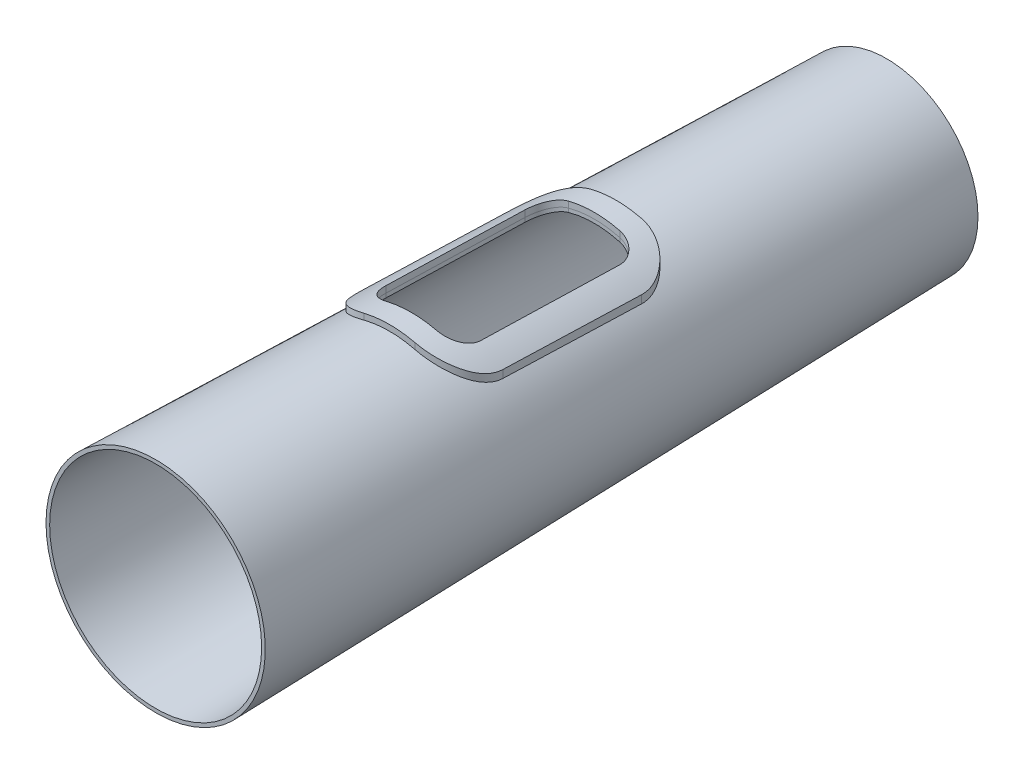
ISO-10303-21;
HEADER;
FILE_DESCRIPTION(('STEP AP214'),'2;1');
FILE_NAME('part.step','',(''),(''),'','','');
FILE_SCHEMA(('AUTOMOTIVE_DESIGN { 1 0 10303 214 1 1 1 1 }'));
ENDSEC;
DATA;
#1=APPLICATION_CONTEXT('core data for automotive mechanical design processes');
#2=APPLICATION_PROTOCOL_DEFINITION('international standard','automotive_design',2000,#1);
#3=PRODUCT_CONTEXT('',#1,'mechanical');
#4=PRODUCT('Part','Part','',(#3));
#5=PRODUCT_RELATED_PRODUCT_CATEGORY('part','',(#4));
#6=PRODUCT_DEFINITION_FORMATION('','',#4);
#7=PRODUCT_DEFINITION_CONTEXT('part definition',#1,'design');
#8=PRODUCT_DEFINITION('design','',#6,#7);
#9=PRODUCT_DEFINITION_SHAPE('','',#8);
#10=(LENGTH_UNIT() NAMED_UNIT(*) SI_UNIT(.MILLI.,.METRE.));
#11=(NAMED_UNIT(*) PLANE_ANGLE_UNIT() SI_UNIT($,.RADIAN.));
#12=(NAMED_UNIT(*) SI_UNIT($,.STERADIAN.) SOLID_ANGLE_UNIT());
#13=UNCERTAINTY_MEASURE_WITH_UNIT(LENGTH_MEASURE(1.E-05),#10,'distance_accuracy_value','');
#14=(GEOMETRIC_REPRESENTATION_CONTEXT(3) GLOBAL_UNCERTAINTY_ASSIGNED_CONTEXT((#13)) GLOBAL_UNIT_ASSIGNED_CONTEXT((#10,
#11,#12)) REPRESENTATION_CONTEXT('',''));
#15=CARTESIAN_POINT('',(0.,0.,0.));
#16=DIRECTION('',(0.,0.,1.));
#17=DIRECTION('',(1.,0.,0.));
#18=AXIS2_PLACEMENT_3D('',#15,#16,#17);
#19=CARTESIAN_POINT('',(35.,150.,-380.));
#20=DIRECTION('',(0.,-1.,0.));
#21=DIRECTION('',(0.,0.,-1.));
#22=AXIS2_PLACEMENT_3D('',#19,#20,#21);
#23=CYLINDRICAL_SURFACE('',#22,30.);
#24=CARTESIAN_POINT('',(65.000000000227,124.56022639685,-379.999999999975));
#25=CARTESIAN_POINT('',(65.0000083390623,124.571393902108,-379.603684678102));
#26=CARTESIAN_POINT('',(64.9921468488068,124.586672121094,-379.207492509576));
#27=CARTESIAN_POINT('',(64.9607752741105,124.625345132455,-378.416138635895));
#28=CARTESIAN_POINT('',(64.9372657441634,124.648739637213,-378.020976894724));
#29=CARTESIAN_POINT('',(64.8747033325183,124.703528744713,-377.232618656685));
#30=CARTESIAN_POINT('',(64.8356575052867,124.734919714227,-376.839421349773));
#31=CARTESIAN_POINT('',(64.7421840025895,124.805537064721,-376.055594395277));
#32=CARTESIAN_POINT('',(64.6877562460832,124.844763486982,-375.664964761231));
#33=CARTESIAN_POINT('',(64.5022439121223,124.973509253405,-374.501639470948));
#34=CARTESIAN_POINT('',(64.3486205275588,125.074366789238,-373.733640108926));
#35=CARTESIAN_POINT('',(63.9830953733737,125.304347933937,-372.216060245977));
#36=CARTESIAN_POINT('',(63.7711888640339,125.433473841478,-371.466481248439));
#37=CARTESIAN_POINT('',(63.2919074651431,125.71727470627,-369.991592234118));
#38=CARTESIAN_POINT('',(63.0246191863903,125.87190969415,-369.266246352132));
#39=CARTESIAN_POINT('',(62.4371208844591,126.204065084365,-367.842808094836));
#40=CARTESIAN_POINT('',(62.116911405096,126.381585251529,-367.144715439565));
#41=CARTESIAN_POINT('',(61.4261245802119,126.756722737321,-365.778665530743));
#42=CARTESIAN_POINT('',(61.0554977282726,126.9543597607,-365.1107387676));
#43=CARTESIAN_POINT('',(60.2670748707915,127.366534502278,-363.808824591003));
#44=CARTESIAN_POINT('',(59.8492769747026,127.581072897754,-363.174838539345));
#45=CARTESIAN_POINT('',(58.9407021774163,128.038482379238,-361.903243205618));
#46=CARTESIAN_POINT('',(58.4469409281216,128.282288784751,-361.268102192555));
#47=CARTESIAN_POINT('',(57.4124988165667,128.782137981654,-360.041953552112));
#48=CARTESIAN_POINT('',(56.8717974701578,129.03818609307,-359.450965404));
#49=CARTESIAN_POINT('',(55.7468459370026,129.559056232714,-358.315739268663));
#50=CARTESIAN_POINT('',(55.1625799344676,129.823881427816,-357.771518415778));
#51=CARTESIAN_POINT('',(53.9542502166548,130.358800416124,-356.73261804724));
#52=CARTESIAN_POINT('',(53.3302008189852,130.628892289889,-356.237920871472));
#53=CARTESIAN_POINT('',(51.9845955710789,131.196972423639,-355.255679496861));
#54=CARTESIAN_POINT('',(51.2594003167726,131.495182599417,-354.773239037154));
#55=CARTESIAN_POINT('',(49.7693971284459,132.090384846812,-353.872951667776));
#56=CARTESIAN_POINT('',(49.0045852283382,132.387376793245,-353.45511124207));
#57=CARTESIAN_POINT('',(47.440419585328,132.97629052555,-352.687097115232));
#58=CARTESIAN_POINT('',(46.6410852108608,133.268215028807,-352.336886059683));
#59=CARTESIAN_POINT('',(45.0123944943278,133.843718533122,-351.706641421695));
#60=CARTESIAN_POINT('',(44.1830430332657,134.127298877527,-351.426596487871));
#61=CARTESIAN_POINT('',(42.6699628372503,134.626726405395,-350.988617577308));
#62=CARTESIAN_POINT('',(41.9907258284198,134.844667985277,-350.817441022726));
#63=CARTESIAN_POINT('',(40.6193896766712,135.271772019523,-350.522649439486));
#64=CARTESIAN_POINT('',(39.9272929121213,135.480936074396,-350.399025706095));
#65=CARTESIAN_POINT('',(38.5330250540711,135.88921928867,-350.200443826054));
#66=CARTESIAN_POINT('',(37.830851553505,136.088335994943,-350.125497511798));
#67=CARTESIAN_POINT('',(36.4196701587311,136.475382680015,-350.025249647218));
#68=CARTESIAN_POINT('',(35.7106601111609,136.663308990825,-349.999964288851));
#69=CARTESIAN_POINT('',(35.0000000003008,136.845030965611,-350.));
#70=B_SPLINE_CURVE_WITH_KNOTS('',3,(#24,#25,#26,#27,#28,#29,#30,#31,#32,#33,#34,#35,#36,#37,#38,
#39,#40,#41,#42,#43,#44,#45,#46,#47,#48,#49,#50,#51,#52,#53,#54,#55,#56,#57,#58,#59,#60,#61,#62,
#63,#64,#65,#66,#67,#68,#69),.UNSPECIFIED.,.F.,.F.,(4,2,2,2,2,2,2,2,2,2,2,2,2,2,2,2,2,2,2,2,2,2,
4),(0.,1.1893061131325,2.37857008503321,3.56729467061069,4.75602551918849,7.12185969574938,
9.48788632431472,11.8502403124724,14.2125700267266,16.5772363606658,18.9419975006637,
21.461222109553,23.9815516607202,26.5028006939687,29.0231474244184,31.7819175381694,
34.5409643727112,37.2984828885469,40.0555550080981,42.2547298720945,44.4535019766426,
46.6528083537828,48.8528316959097),.UNSPECIFIED.);
#71=CARTESIAN_POINT('',(65.,124.560226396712,-379.999999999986));
#72=VERTEX_POINT('',#71);
#73=CARTESIAN_POINT('',(35.,136.845030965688,-350.));
#74=VERTEX_POINT('',#73);
#75=EDGE_CURVE('E154',#72,#74,#70,.T.);
#76=ORIENTED_EDGE('',*,*,#75,.T.);
#77=DIRECTION('',(0.,-1.,0.));
#78=VECTOR('',#77,1.);
#79=CARTESIAN_POINT('',(35.,150.,-350.));
#80=LINE('',#79,#78);
#81=CARTESIAN_POINT('',(34.999848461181,145.090764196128,-350.00000000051));
#82=VERTEX_POINT('',#81);
#83=EDGE_CURVE('E352',#82,#74,#80,.T.);
#84=ORIENTED_EDGE('',*,*,#83,.F.);
#85=CARTESIAN_POINT('',(64.9999999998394,133.521502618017,-380.000098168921));
#86=CARTESIAN_POINT('',(65.0000093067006,133.532595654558,-379.60084460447));
#87=CARTESIAN_POINT('',(64.9920325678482,133.547580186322,-379.201706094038));
#88=CARTESIAN_POINT('',(64.9601938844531,133.5852357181,-378.404438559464));
#89=CARTESIAN_POINT('',(64.9363324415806,133.607906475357,-378.00630950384));
#90=CARTESIAN_POINT('',(64.8728241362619,133.660827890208,-377.211976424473));
#91=CARTESIAN_POINT('',(64.8331836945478,133.691075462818,-376.81577168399));
#92=CARTESIAN_POINT('',(64.7382728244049,133.75899858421,-376.025906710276));
#93=CARTESIAN_POINT('',(64.6830023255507,133.79667416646,-375.632246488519));
#94=CARTESIAN_POINT('',(64.494537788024,133.920228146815,-374.459512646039));
#95=CARTESIAN_POINT('',(64.338402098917,134.016874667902,-373.6851064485));
#96=CARTESIAN_POINT('',(63.966731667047,134.237053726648,-372.154689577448));
#97=CARTESIAN_POINT('',(63.751192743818,134.360588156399,-371.398680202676));
#98=CARTESIAN_POINT('',(63.2634182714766,134.632041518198,-369.910837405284));
#99=CARTESIAN_POINT('',(62.9912583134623,134.77992788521,-369.178973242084));
#100=CARTESIAN_POINT('',(62.392778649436,135.097571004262,-367.742715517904));
#101=CARTESIAN_POINT('',(62.0664593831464,135.267327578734,-367.038321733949));
#102=CARTESIAN_POINT('',(61.3622355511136,135.626060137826,-365.660129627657));
#103=CARTESIAN_POINT('',(60.984286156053,135.815052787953,-364.986358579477));
#104=CARTESIAN_POINT('',(60.1800199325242,136.209220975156,-363.67335133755));
#105=CARTESIAN_POINT('',(59.7537013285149,136.414397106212,-363.034116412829));
#106=CARTESIAN_POINT('',(58.8292159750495,136.850502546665,-361.756479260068));
#107=CARTESIAN_POINT('',(58.3282989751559,137.08223672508,-361.120334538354));
#108=CARTESIAN_POINT('',(57.5415688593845,137.438370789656,-360.199982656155));
#109=CARTESIAN_POINT('',(57.2734154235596,137.558511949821,-359.898825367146));
#110=CARTESIAN_POINT('',(56.7256575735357,137.801270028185,-359.308018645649));
#111=CARTESIAN_POINT('',(56.4460508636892,137.923887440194,-359.018371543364));
#112=CARTESIAN_POINT('',(55.590666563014,138.294849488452,-358.167190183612));
#113=CARTESIAN_POINT('',(54.9983556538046,138.546289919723,-357.623451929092));
#114=CARTESIAN_POINT('',(53.7732890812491,139.054156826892,-356.586160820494));
#115=CARTESIAN_POINT('',(53.1405315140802,139.310583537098,-356.09261033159));
#116=CARTESIAN_POINT('',(52.1366250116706,139.707378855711,-355.372278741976));
#117=CARTESIAN_POINT('',(51.7784480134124,139.847090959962,-355.126880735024));
#118=CARTESIAN_POINT('',(51.0519019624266,140.126590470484,-354.651927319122));
#119=CARTESIAN_POINT('',(50.6835351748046,140.266377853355,-354.422368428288));
#120=CARTESIAN_POINT('',(49.5637333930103,140.685269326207,-353.757838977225));
#121=CARTESIAN_POINT('',(48.7975924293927,140.963904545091,-353.347012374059));
#122=CARTESIAN_POINT('',(47.2316724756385,141.516147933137,-352.59304526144));
#123=CARTESIAN_POINT('',(46.4319123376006,141.789758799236,-352.249867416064));
#124=CARTESIAN_POINT('',(44.803264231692,142.32892254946,-351.633581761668));
#125=CARTESIAN_POINT('',(43.9743813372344,142.594476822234,-351.360461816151));
#126=CARTESIAN_POINT('',(42.4773756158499,143.05749972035,-350.938790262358));
#127=CARTESIAN_POINT('',(41.8138742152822,143.257125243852,-350.776055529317));
#128=CARTESIAN_POINT('',(40.4751405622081,143.648380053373,-350.495926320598));
#129=CARTESIAN_POINT('',(39.7999105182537,143.840010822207,-350.37852340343));
#130=CARTESIAN_POINT('',(38.4404820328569,144.214133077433,-350.190037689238));
#131=CARTESIAN_POINT('',(37.7562833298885,144.396624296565,-350.118956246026));
#132=CARTESIAN_POINT('',(36.3818035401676,144.75151473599,-350.023911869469));
#133=CARTESIAN_POINT('',(35.6915206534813,144.923910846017,-349.999963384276));
#134=CARTESIAN_POINT('',(34.9998401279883,145.090729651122,-350.000000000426));
#135=B_SPLINE_CURVE_WITH_KNOTS('',3,(#85,#86,#87,#88,#89,#90,#91,#92,#93,#94,#95,#96,#97,#98,
#99,#100,#101,#102,#103,#104,#105,#106,#107,#108,#109,#110,#111,#112,#113,#114,#115,#116,#117,
#118,#119,#120,#121,#122,#123,#124,#125,#126,#127,#128,#129,#130,#131,#132,#133,#134),
.UNSPECIFIED.,.F.,.F.,(4,2,2,2,2,2,2,2,2,2,2,2,2,2,2,2,2,2,2,2,2,2,2,2,4),(0.,1.19811228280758,
2.39618672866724,3.59377415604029,4.7913669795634,7.17579211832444,9.56038510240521,
11.9418147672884,14.3232250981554,16.7067164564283,19.0902953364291,21.6139793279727,
22.8759769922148,24.1382288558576,26.6628806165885,29.1876513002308,30.5556092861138,
31.9232655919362,34.6585606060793,37.3923417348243,40.1256489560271,42.2593658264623,
44.3926851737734,46.5260668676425,48.6601024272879),.UNSPECIFIED.);
#136=CARTESIAN_POINT('',(65.0000085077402,133.521495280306,-380.000097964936));
#137=VERTEX_POINT('',#136);
#138=EDGE_CURVE('E263',#137,#82,#135,.T.);
#139=ORIENTED_EDGE('',*,*,#138,.F.);
#140=DIRECTION('',(0.,-1.,0.));
#141=VECTOR('',#140,1.);
#142=CARTESIAN_POINT('',(65.,150.,-380.));
#143=LINE('',#142,#141);
#144=EDGE_CURVE('E360',#137,#72,#143,.T.);
#145=ORIENTED_EDGE('',*,*,#144,.T.);
#146=EDGE_LOOP('',(#76,#84,#139,#145));
#147=FACE_BOUND('',#146,.T.);
#148=ADVANCED_FACE('F47',(#147),#23,.F.);
#149=CARTESIAN_POINT('',(-35.,150.,-350.));
#150=DIRECTION('',(0.,0.,-1.));
#151=DIRECTION('',(-1.,0.,0.));
#152=AXIS2_PLACEMENT_3D('',#149,#150,#151);
#153=PLANE('',#152);
#154=CARTESIAN_POINT('',(0.,0.,-350.));
#155=DIRECTION('',(0.,0.,-1.));
#156=DIRECTION('',(-1.,0.,0.));
#157=AXIS2_PLACEMENT_3D('',#154,#155,#156);
#158=CIRCLE('',#157,141.25);
#159=CARTESIAN_POINT('',(-35.0000000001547,136.845030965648,-350.));
#160=VERTEX_POINT('',#159);
#161=EDGE_CURVE('E150',#74,#160,#158,.F.);
#162=ORIENTED_EDGE('',*,*,#161,.T.);
#163=DIRECTION('',(0.,-1.,0.));
#164=VECTOR('',#163,1.);
#165=CARTESIAN_POINT('',(-35.,150.,-350.));
#166=LINE('',#165,#164);
#167=CARTESIAN_POINT('',(-34.9998484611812,145.090764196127,-350.00000000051));
#168=VERTEX_POINT('',#167);
#169=EDGE_CURVE('E365',#168,#160,#166,.T.);
#170=ORIENTED_EDGE('',*,*,#169,.F.);
#171=CARTESIAN_POINT('',(0.,0.,-350.));
#172=DIRECTION('',(0.,0.,-1.));
#173=DIRECTION('',(-1.,0.,0.));
#174=AXIS2_PLACEMENT_3D('',#171,#172,#173);
#175=CIRCLE('',#174,149.252499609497);
#176=EDGE_CURVE('E333',#82,#168,#175,.F.);
#177=ORIENTED_EDGE('',*,*,#176,.F.);
#178=ORIENTED_EDGE('',*,*,#83,.T.);
#179=EDGE_LOOP('',(#162,#170,#177,#178));
#180=FACE_BOUND('',#179,.T.);
#181=ADVANCED_FACE('F268',(#180),#153,.T.);
#182=CARTESIAN_POINT('',(-35.,150.,-380.));
#183=DIRECTION('',(0.,-1.,0.));
#184=DIRECTION('',(0.,0.,-1.));
#185=AXIS2_PLACEMENT_3D('',#182,#183,#184);
#186=CYLINDRICAL_SURFACE('',#185,30.);
#187=CARTESIAN_POINT('',(-35.0000000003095,136.845030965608,-350.));
#188=CARTESIAN_POINT('',(-35.4413371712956,136.732156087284,-350.000000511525));
#189=CARTESIAN_POINT('',(-35.8820039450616,136.616919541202,-350.009740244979));
#190=CARTESIAN_POINT('',(-36.7612651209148,136.381949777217,-350.048511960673));
#191=CARTESIAN_POINT('',(-37.1998596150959,136.262216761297,-350.077543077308));
#192=CARTESIAN_POINT('',(-38.5109900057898,135.896738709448,-350.193250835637));
#193=CARTESIAN_POINT('',(-39.3793859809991,135.644583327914,-350.30854232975));
#194=CARTESIAN_POINT('',(-41.0965028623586,135.126286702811,-350.613071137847));
#195=CARTESIAN_POINT('',(-41.9452635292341,134.860178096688,-350.802142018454));
#196=CARTESIAN_POINT('',(-43.6197632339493,134.316093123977,-351.251935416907));
#197=CARTESIAN_POINT('',(-44.4455004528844,134.0381158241,-351.512663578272));
#198=CARTESIAN_POINT('',(-46.0678540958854,133.473604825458,-352.102921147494));
#199=CARTESIAN_POINT('',(-46.8645003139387,133.187080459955,-352.432377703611));
#200=CARTESIAN_POINT('',(-48.4248506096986,132.608424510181,-353.157616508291));
#201=CARTESIAN_POINT('',(-49.1885552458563,132.316293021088,-353.553397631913));
#202=CARTESIAN_POINT('',(-50.6790800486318,131.729683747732,-354.408881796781));
#203=CARTESIAN_POINT('',(-51.4058754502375,131.435204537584,-354.868627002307));
#204=CARTESIAN_POINT('',(-52.81777636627,130.847780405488,-355.849107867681));
#205=CARTESIAN_POINT('',(-53.502880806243,130.554835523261,-356.369845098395));
#206=CARTESIAN_POINT('',(-54.8495799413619,129.964590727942,-357.488096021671));
#207=CARTESIAN_POINT('',(-55.5095988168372,129.667477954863,-358.087608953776));
#208=CARTESIAN_POINT('',(-56.7759567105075,129.083657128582,-359.345598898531));
#209=CARTESIAN_POINT('',(-57.3822936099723,128.796949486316,-360.004078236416));
#210=CARTESIAN_POINT('',(-58.5366290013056,128.23872334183,-361.376593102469));
#211=CARTESIAN_POINT('',(-59.0846165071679,127.967207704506,-362.090639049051));
#212=CARTESIAN_POINT('',(-60.1172021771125,127.444478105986,-363.570155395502));
#213=CARTESIAN_POINT('',(-60.6018052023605,127.193262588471,-364.335621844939));
#214=CARTESIAN_POINT('',(-61.4883103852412,126.723876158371,-365.888201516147));
#215=CARTESIAN_POINT('',(-61.8923550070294,126.5049076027,-366.673848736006));
#216=CARTESIAN_POINT('',(-62.6319065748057,126.095451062,-368.284088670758));
#217=CARTESIAN_POINT('',(-62.9674063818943,125.904966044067,-369.108685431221));
#218=CARTESIAN_POINT('',(-63.5648251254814,125.557328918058,-370.788906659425));
#219=CARTESIAN_POINT('',(-63.8268968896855,125.400107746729,-371.644462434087));
#220=CARTESIAN_POINT('',(-64.274411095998,125.12252171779,-373.380958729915));
#221=CARTESIAN_POINT('',(-64.4598971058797,125.002135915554,-374.261884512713));
#222=CARTESIAN_POINT('',(-64.670978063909,124.85667738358,-375.550603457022));
#223=CARTESIAN_POINT('',(-64.7283608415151,124.815635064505,-375.951660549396));
#224=CARTESIAN_POINT('',(-64.8268918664,124.74181521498,-376.756434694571));
#225=CARTESIAN_POINT('',(-64.8680450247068,124.709035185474,-377.160150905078));
#226=CARTESIAN_POINT('',(-64.9339403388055,124.651930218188,-377.969269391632));
#227=CARTESIAN_POINT('',(-64.9586921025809,124.627600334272,-378.374670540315));
#228=CARTESIAN_POINT('',(-64.9917284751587,124.587477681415,-379.186667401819));
#229=CARTESIAN_POINT('',(-65.0000089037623,124.571687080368,-379.593263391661));
#230=CARTESIAN_POINT('',(-64.9999999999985,124.560226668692,-379.99999035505));
#231=B_SPLINE_CURVE_WITH_KNOTS('',3,(#187,#188,#189,#190,#191,#192,#193,#194,#195,#196,#197,
#198,#199,#200,#201,#202,#203,#204,#205,#206,#207,#208,#209,#210,#211,#212,#213,#214,#215,#216,
#217,#218,#219,#220,#221,#222,#223,#224,#225,#226,#227,#228,#229,#230),.UNSPECIFIED.,.F.,.F.,(4,
2,2,2,2,2,2,2,2,2,2,2,2,2,2,2,2,2,2,2,2,4),(0.,1.36639338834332,2.73272547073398,
5.46380594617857,8.1887608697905,10.9139304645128,13.6362259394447,16.3584752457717,
19.0825276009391,21.8066501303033,24.6227894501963,27.4390398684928,30.255819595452,
33.0723831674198,35.7992373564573,38.5263754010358,41.247794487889,43.9676632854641,
45.1889816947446,46.409930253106,47.6301629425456,48.8507052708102),.UNSPECIFIED.);
#232=CARTESIAN_POINT('',(-64.9999999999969,124.560226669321,-379.999990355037));
#233=VERTEX_POINT('',#232);
#234=EDGE_CURVE('E153',#160,#233,#231,.T.);
#235=ORIENTED_EDGE('',*,*,#234,.T.);
#236=DIRECTION('',(0.,-1.,0.));
#237=VECTOR('',#236,1.);
#238=CARTESIAN_POINT('',(-65.,150.,-380.));
#239=LINE('',#238,#237);
#240=CARTESIAN_POINT('',(-65.0000084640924,133.521491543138,-380.000102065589));
#241=VERTEX_POINT('',#240);
#242=EDGE_CURVE('E130',#241,#233,#239,.T.);
#243=ORIENTED_EDGE('',*,*,#242,.F.);
#244=CARTESIAN_POINT('',(-34.9998401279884,145.090729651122,-350.000000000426));
#245=CARTESIAN_POINT('',(-35.4391430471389,144.984760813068,-349.999998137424));
#246=CARTESIAN_POINT('',(-35.8778455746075,144.876570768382,-350.00964600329));
#247=CARTESIAN_POINT('',(-36.7533267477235,144.655959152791,-350.048073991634));
#248=CARTESIAN_POINT('',(-37.190105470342,144.543537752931,-350.076853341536));
#249=CARTESIAN_POINT('',(-38.4960484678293,144.200354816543,-350.191597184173));
#250=CARTESIAN_POINT('',(-39.3613013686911,143.96355824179,-350.305967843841));
#251=CARTESIAN_POINT('',(-41.0729127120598,143.476743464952,-350.608270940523));
#252=CARTESIAN_POINT('',(-41.9193065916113,143.226753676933,-350.79605045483));
#253=CARTESIAN_POINT('',(-43.5896426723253,142.715589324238,-351.24299292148));
#254=CARTESIAN_POINT('',(-44.4135833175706,142.45441398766,-351.502160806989));
#255=CARTESIAN_POINT('',(-46.0329905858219,141.923957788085,-352.0891730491));
#256=CARTESIAN_POINT('',(-46.8284820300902,141.654684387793,-352.416955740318));
#257=CARTESIAN_POINT('',(-48.3869068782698,141.110878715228,-353.138722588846));
#258=CARTESIAN_POINT('',(-49.1498407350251,140.836346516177,-353.532705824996));
#259=CARTESIAN_POINT('',(-50.6391348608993,140.285100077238,-354.384504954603));
#260=CARTESIAN_POINT('',(-51.3654741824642,140.008384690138,-354.84235685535));
#261=CARTESIAN_POINT('',(-52.4236599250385,139.594521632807,-355.574599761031));
#262=CARTESIAN_POINT('',(-52.7711839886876,139.456762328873,-355.826271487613));
#263=CARTESIAN_POINT('',(-53.4554198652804,139.182042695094,-356.344520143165));
#264=CARTESIAN_POINT('',(-53.7921287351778,139.045082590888,-356.61110107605));
#265=CARTESIAN_POINT('',(-54.8046898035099,138.628079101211,-357.448804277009));
#266=CARTESIAN_POINT('',(-55.4621367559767,138.350087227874,-358.04350831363));
#267=CARTESIAN_POINT('',(-56.7237382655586,137.803912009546,-359.290908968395));
#268=CARTESIAN_POINT('',(-57.3278930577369,137.535728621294,-359.943605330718));
#269=CARTESIAN_POINT('',(-58.4785589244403,137.013466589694,-361.303730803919));
#270=CARTESIAN_POINT('',(-59.0250585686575,136.759390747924,-362.011170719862));
#271=CARTESIAN_POINT('',(-59.7976155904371,136.392481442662,-363.109800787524));
#272=CARTESIAN_POINT('',(-60.0472674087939,136.272546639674,-363.482252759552));
#273=CARTESIAN_POINT('',(-60.5304244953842,136.037908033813,-364.239316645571));
#274=CARTESIAN_POINT('',(-60.763923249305,135.923206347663,-364.623933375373));
#275=CARTESIAN_POINT('',(-61.42631642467,135.594262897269,-365.77270276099));
#276=CARTESIAN_POINT('',(-61.831892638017,135.388123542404,-366.552825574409));
#277=CARTESIAN_POINT('',(-62.5749731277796,135.002251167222,-368.151068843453));
#278=CARTESIAN_POINT('',(-62.9124871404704,134.822514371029,-368.96918384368));
#279=CARTESIAN_POINT('',(-63.3643747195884,134.575848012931,-370.219484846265));
#280=CARTESIAN_POINT('',(-63.5058617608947,134.497494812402,-370.639811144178));
#281=CARTESIAN_POINT('',(-63.770390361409,134.34881423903,-371.487557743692));
#282=CARTESIAN_POINT('',(-63.8934361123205,134.278485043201,-371.914976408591));
#283=CARTESIAN_POINT('',(-64.120626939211,134.146289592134,-372.775925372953));
#284=CARTESIAN_POINT('',(-64.2247788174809,134.084420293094,-373.209453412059));
#285=CARTESIAN_POINT('',(-64.4138447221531,133.969497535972,-374.081816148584));
#286=CARTESIAN_POINT('',(-64.498760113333,133.916443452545,-374.520650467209));
#287=CARTESIAN_POINT('',(-64.644548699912,133.822366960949,-375.376392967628));
#288=CARTESIAN_POINT('',(-64.7065523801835,133.780816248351,-375.793050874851));
#289=CARTESIAN_POINT('',(-64.8130080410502,133.706043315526,-376.629223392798));
#290=CARTESIAN_POINT('',(-64.8574652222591,133.672818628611,-377.048737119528));
#291=CARTESIAN_POINT('',(-64.9286471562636,133.614887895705,-377.889566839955));
#292=CARTESIAN_POINT('',(-64.9553838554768,133.590176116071,-378.310881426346));
#293=CARTESIAN_POINT('',(-64.9910687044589,133.549353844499,-379.154789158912));
#294=CARTESIAN_POINT('',(-65.0000121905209,133.533245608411,-379.577382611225));
#295=CARTESIAN_POINT('',(-64.9999999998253,133.521502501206,-380.000102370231));
#296=B_SPLINE_CURVE_WITH_KNOTS('',3,(#244,#245,#246,#247,#248,#249,#250,#251,#252,#253,#254,
#255,#256,#257,#258,#259,#260,#261,#262,#263,#264,#265,#266,#267,#268,#269,#270,#271,#272,#273,
#274,#275,#276,#277,#278,#279,#280,#281,#282,#283,#284,#285,#286,#287,#288,#289,#290,#291,#292,
#293,#294,#295),.UNSPECIFIED.,.F.,.F.,(4,2,2,2,2,2,2,2,2,2,2,2,2,2,2,2,2,2,2,2,2,2,2,2,2,4),(0.,
1.35547872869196,2.71090272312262,5.42026887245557,8.12402078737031,10.8279595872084,
13.5294786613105,16.2309601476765,18.9339708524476,20.2856067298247,21.6376073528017,
24.4211793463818,27.2047390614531,29.988849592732,31.3808829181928,32.7734743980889,
35.4789259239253,38.1839901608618,39.5346754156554,40.8850531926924,42.234943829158,
43.5847386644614,44.8541629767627,46.1232107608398,47.3914021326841,48.6599258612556),.UNSPECIFIED.);
#297=EDGE_CURVE('E262',#168,#241,#296,.T.);
#298=ORIENTED_EDGE('',*,*,#297,.F.);
#299=ORIENTED_EDGE('',*,*,#169,.T.);
#300=EDGE_LOOP('',(#235,#243,#298,#299));
#301=FACE_BOUND('',#300,.T.);
#302=ADVANCED_FACE('F264',(#301),#186,.F.);
#303=CARTESIAN_POINT('',(-65.,150.,-570.));
#304=DIRECTION('',(1.,0.,0.));
#305=DIRECTION('',(0.,0.,-1.));
#306=AXIS2_PLACEMENT_3D('',#303,#304,#305);
#307=PLANE('',#306);
#308=CARTESIAN_POINT('',(-65.,119.176451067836,-570.005305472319));
#309=CARTESIAN_POINT('',(-65.,121.822122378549,-477.098631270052));
#310=CARTESIAN_POINT('',(-65.,124.560373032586,-379.9948));
#311=B_SPLINE_CURVE_WITH_KNOTS('',2,(#308,#309,#310),.UNSPECIFIED.,.F.,.F.,(3,3),(0.,1.),.UNSPECIFIED.);
#312=CARTESIAN_POINT('',(-65.,119.176602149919,-569.999999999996));
#313=VERTEX_POINT('',#312);
#314=EDGE_CURVE('E52',#233,#313,#311,.F.);
#315=ORIENTED_EDGE('',*,*,#314,.T.);
#316=DIRECTION('',(0.,-1.,0.));
#317=VECTOR('',#316,1.);
#318=CARTESIAN_POINT('',(-65.,150.,-570.));
#319=LINE('',#318,#317);
#320=CARTESIAN_POINT('',(-65.0000273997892,128.21769053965,-569.999908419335));
#321=VERTEX_POINT('',#320);
#322=EDGE_CURVE('E122',#321,#313,#319,.T.);
#323=ORIENTED_EDGE('',*,*,#322,.F.);
#324=CARTESIAN_POINT('',(-65.,133.52150250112,-380.000102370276));
#325=CARTESIAN_POINT('',(-65.,133.081255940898,-395.833468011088));
#326=CARTESIAN_POINT('',(-65.,132.64059291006,-411.666822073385));
#327=CARTESIAN_POINT('',(-65.,131.758407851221,-443.333506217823));
#328=CARTESIAN_POINT('',(-65.,131.316885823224,-459.166836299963));
#329=CARTESIAN_POINT('',(-65.,130.432956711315,-490.833471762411));
#330=CARTESIAN_POINT('',(-65.,129.990549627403,-506.666777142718));
#331=CARTESIAN_POINT('',(-65.,129.104822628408,-538.333362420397));
#332=CARTESIAN_POINT('',(-65.,128.661502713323,-554.16664231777));
#333=CARTESIAN_POINT('',(-65.,128.217712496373,-569.99990903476));
#334=B_SPLINE_CURVE_WITH_KNOTS('',3,(#324,#325,#326,#327,#328,#329,#330,#331,#332,#333),
.UNSPECIFIED.,.F.,.F.,(4,2,2,2,4),(0.,47.5184549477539,95.0369097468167,142.555364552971,
190.073819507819),.UNSPECIFIED.);
#335=EDGE_CURVE('E706',#241,#321,#334,.T.);
#336=ORIENTED_EDGE('',*,*,#335,.F.);
#337=ORIENTED_EDGE('',*,*,#242,.T.);
#338=EDGE_LOOP('',(#315,#323,#336,#337));
#339=FACE_BOUND('',#338,.T.);
#340=ADVANCED_FACE('F132',(#339),#307,.T.);
#341=CARTESIAN_POINT('',(-35.,150.,-570.));
#342=DIRECTION('',(0.,-1.,0.));
#343=DIRECTION('',(0.,0.,-1.));
#344=AXIS2_PLACEMENT_3D('',#341,#342,#343);
#345=CYLINDRICAL_SURFACE('',#344,30.);
#346=CARTESIAN_POINT('',(-65.,119.176602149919,-569.999999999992));
#347=CARTESIAN_POINT('',(-65.000003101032,119.165603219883,-570.386081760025));
#348=CARTESIAN_POINT('',(-64.9925457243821,119.158677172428,-570.772233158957));
#349=CARTESIAN_POINT('',(-64.9627295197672,119.15296086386,-571.544007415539));
#350=CARTESIAN_POINT('',(-64.9403711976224,119.154170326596,-571.929630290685));
#351=CARTESIAN_POINT('',(-64.851007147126,119.169980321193,-573.084306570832));
#352=CARTESIAN_POINT('',(-64.761712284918,119.19674999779,-573.851607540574));
#353=CARTESIAN_POINT('',(-64.5251069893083,119.281786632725,-575.371898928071));
#354=CARTESIAN_POINT('',(-64.37805667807,119.339912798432,-576.124937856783));
#355=CARTESIAN_POINT('',(-64.1152531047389,119.449496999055,-577.24213815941));
#356=CARTESIAN_POINT('',(-64.0206048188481,119.489761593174,-577.612507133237));
#357=CARTESIAN_POINT('',(-63.8174575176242,119.57752251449,-578.348650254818));
#358=CARTESIAN_POINT('',(-63.7089554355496,119.625020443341,-578.714423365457));
#359=CARTESIAN_POINT('',(-63.3633824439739,119.777836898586,-579.80293101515));
#360=CARTESIAN_POINT('',(-63.1060033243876,119.893579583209,-580.517877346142));
#361=CARTESIAN_POINT('',(-62.5396379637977,120.150399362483,-581.922323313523));
#362=CARTESIAN_POINT('',(-62.2306479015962,120.291478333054,-582.611821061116));
#363=CARTESIAN_POINT('',(-61.7304966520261,120.520050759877,-583.624336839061));
#364=CARTESIAN_POINT('',(-61.5575604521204,120.599116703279,-583.958402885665));
#365=CARTESIAN_POINT('',(-61.199884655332,120.762511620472,-584.618720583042));
#366=CARTESIAN_POINT('',(-61.0151481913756,120.846839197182,-584.9449742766));
#367=CARTESIAN_POINT('',(-60.4436697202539,121.107218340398,-585.911629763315));
#368=CARTESIAN_POINT('',(-60.0396491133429,121.290670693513,-586.539945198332));
#369=CARTESIAN_POINT('',(-59.1654286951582,121.684729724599,-587.794614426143));
#370=CARTESIAN_POINT('',(-58.692820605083,121.896271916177,-588.418990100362));
#371=CARTESIAN_POINT('',(-57.7032052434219,122.334482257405,-589.625835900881));
#372=CARTESIAN_POINT('',(-57.1861966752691,122.561150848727,-590.20830480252));
#373=CARTESIAN_POINT('',(-56.1109433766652,123.026340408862,-591.329120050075));
#374=CARTESIAN_POINT('',(-55.5526849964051,123.264865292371,-591.867451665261));
#375=CARTESIAN_POINT('',(-54.3983269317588,123.75050025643,-592.897675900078));
#376=CARTESIAN_POINT('',(-53.8022240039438,123.997611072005,-593.389564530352));
#377=CARTESIAN_POINT('',(-52.5106035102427,124.523754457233,-594.374282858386));
#378=CARTESIAN_POINT('',(-51.8112290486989,124.803406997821,-594.86175039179));
#379=CARTESIAN_POINT('',(-50.7338495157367,125.224991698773,-595.546569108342));
#380=CARTESIAN_POINT('',(-50.3699778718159,125.365880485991,-595.76712489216));
#381=CARTESIAN_POINT('',(-49.6331497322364,125.64798103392,-596.192593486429));
#382=CARTESIAN_POINT('',(-49.2601904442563,125.789192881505,-596.397501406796));
#383=CARTESIAN_POINT('',(-48.1289974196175,126.212454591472,-596.988010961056));
#384=CARTESIAN_POINT('',(-47.3580256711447,126.494296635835,-597.349667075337));
#385=CARTESIAN_POINT('',(-45.7869201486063,127.053970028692,-598.006556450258));
#386=CARTESIAN_POINT('',(-44.9867883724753,127.33180165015,-598.301794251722));
#387=CARTESIAN_POINT('',(-43.8071835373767,127.730136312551,-598.680699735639));
#388=CARTESIAN_POINT('',(-43.4372727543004,127.853485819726,-598.791695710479));
#389=CARTESIAN_POINT('',(-42.6930002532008,128.098460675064,-598.999430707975));
#390=CARTESIAN_POINT('',(-42.3186395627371,128.220086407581,-599.096172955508));
#391=CARTESIAN_POINT('',(-41.1895005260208,128.582026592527,-599.364751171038));
#392=CARTESIAN_POINT('',(-40.4285378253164,128.819447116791,-599.51497956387));
#393=CARTESIAN_POINT('',(-38.8939833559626,129.284746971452,-599.756350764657));
#394=CARTESIAN_POINT('',(-38.1203856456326,129.512621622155,-599.847464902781));
#395=CARTESIAN_POINT('',(-36.9540551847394,129.845964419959,-599.938836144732));
#396=CARTESIAN_POINT('',(-36.5642032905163,129.955690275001,-599.961743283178));
#397=CARTESIAN_POINT('',(-35.7830557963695,130.172151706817,-599.992325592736));
#398=CARTESIAN_POINT('',(-35.3917601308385,130.27888714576,-600.000000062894));
#399=CARTESIAN_POINT('',(-35.0000001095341,130.38404807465,-600.));
#400=B_SPLINE_CURVE_WITH_KNOTS('',3,(#346,#347,#348,#349,#350,#351,#352,#353,#354,#355,#356,
#357,#358,#359,#360,#361,#362,#363,#364,#365,#366,#367,#368,#369,#370,#371,#372,#373,#374,#375,
#376,#377,#378,#379,#380,#381,#382,#383,#384,#385,#386,#387,#388,#389,#390,#391,#392,#393,#394,
#395,#396,#397,#398,#399),.UNSPECIFIED.,.F.,.F.,(4,2,2,2,2,2,2,2,2,2,2,2,2,2,2,2,2,2,2,2,2,2,2,
2,2,2,4),(0.,1.15852915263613,2.3170189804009,4.63268304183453,6.9380351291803,8.0908919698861,
9.24400445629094,11.5470703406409,13.8503068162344,15.0032285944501,16.1558455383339,
18.461013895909,20.891975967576,23.3230090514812,25.7548502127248,28.1869000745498,
30.875214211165,32.2195526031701,33.5643094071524,36.2522443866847,38.9399955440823,
40.1560352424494,41.3717993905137,43.8029070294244,46.2351928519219,47.4518691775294,
48.6686014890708),.UNSPECIFIED.);
#401=CARTESIAN_POINT('',(-35.,130.384048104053,-600.));
#402=VERTEX_POINT('',#401);
#403=EDGE_CURVE('E113',#313,#402,#400,.T.);
#404=ORIENTED_EDGE('',*,*,#403,.T.);
#405=DIRECTION('',(0.,-1.,0.));
#406=VECTOR('',#405,1.);
#407=CARTESIAN_POINT('',(-35.,150.,-600.));
#408=LINE('',#407,#406);
#409=CARTESIAN_POINT('',(-34.9998484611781,138.653294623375,-599.99999999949));
#410=VERTEX_POINT('',#409);
#411=EDGE_CURVE('E129',#410,#402,#408,.T.);
#412=ORIENTED_EDGE('',*,*,#411,.F.);
#413=CARTESIAN_POINT('',(-64.9999999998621,128.217712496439,-569.99990903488));
#414=CARTESIAN_POINT('',(-65.0000040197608,128.20677766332,-570.389864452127));
#415=CARTESIAN_POINT('',(-64.9923978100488,128.199704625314,-570.779881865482));
#416=CARTESIAN_POINT('',(-64.9619838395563,128.193273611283,-571.559374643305));
#417=CARTESIAN_POINT('',(-64.9391765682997,128.193915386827,-571.948850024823));
#418=CARTESIAN_POINT('',(-64.8480127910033,128.20739472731,-573.115092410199));
#419=CARTESIAN_POINT('',(-64.7569142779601,128.231774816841,-573.890087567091));
#420=CARTESIAN_POINT('',(-64.5154276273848,128.310462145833,-575.426000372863));
#421=CARTESIAN_POINT('',(-64.3652803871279,128.364648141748,-576.186962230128));
#422=CARTESIAN_POINT('',(-64.0968468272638,128.467246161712,-577.315962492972));
#423=CARTESIAN_POINT('',(-64.000158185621,128.505002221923,-577.690249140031));
#424=CARTESIAN_POINT('',(-63.7925953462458,128.587405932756,-578.434193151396));
#425=CARTESIAN_POINT('',(-63.6817179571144,128.632055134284,-578.803849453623));
#426=CARTESIAN_POINT('',(-63.3284696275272,128.775871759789,-579.904068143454));
#427=CARTESIAN_POINT('',(-63.0652709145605,128.884989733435,-580.626767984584));
#428=CARTESIAN_POINT('',(-62.4858589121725,129.12746615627,-582.046387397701));
#429=CARTESIAN_POINT('',(-62.1696421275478,129.260826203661,-582.743305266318));
#430=CARTESIAN_POINT('',(-61.6576091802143,129.477118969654,-583.766540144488));
#431=CARTESIAN_POINT('',(-61.4805466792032,129.551967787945,-584.104095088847));
#432=CARTESIAN_POINT('',(-61.1142713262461,129.706717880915,-584.771242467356));
#433=CARTESIAN_POINT('',(-60.9250616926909,129.786617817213,-585.100836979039));
#434=CARTESIAN_POINT('',(-60.339646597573,130.033424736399,-586.077256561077));
#435=CARTESIAN_POINT('',(-59.9256430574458,130.207443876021,-586.711741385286));
#436=CARTESIAN_POINT('',(-59.0321748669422,130.580384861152,-587.974472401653));
#437=CARTESIAN_POINT('',(-58.5505070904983,130.780105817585,-588.600917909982));
#438=CARTESIAN_POINT('',(-57.5419140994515,131.193963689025,-589.811172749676));
#439=CARTESIAN_POINT('',(-57.0149876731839,131.408100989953,-590.39498093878));
#440=CARTESIAN_POINT('',(-55.9191655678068,131.847661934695,-591.51752895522));
#441=CARTESIAN_POINT('',(-55.3502558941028,132.073089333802,-592.056253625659));
#442=CARTESIAN_POINT('',(-54.1738988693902,132.532132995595,-593.086200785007));
#443=CARTESIAN_POINT('',(-53.5664492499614,132.765749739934,-593.57742047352));
#444=CARTESIAN_POINT('',(-52.6001341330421,133.130991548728,-594.298494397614));
#445=CARTESIAN_POINT('',(-52.2534990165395,133.260811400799,-594.54583191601));
#446=CARTESIAN_POINT('',(-51.5503874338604,133.521527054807,-595.025301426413));
#447=CARTESIAN_POINT('',(-51.1939131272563,133.65242261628,-595.257436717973));
#448=CARTESIAN_POINT('',(-50.1103172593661,134.046138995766,-595.930704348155));
#449=CARTESIAN_POINT('',(-49.3690123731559,134.309993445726,-596.348706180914));
#450=CARTESIAN_POINT('',(-47.8536678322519,134.836867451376,-597.120216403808));
#451=CARTESIAN_POINT('',(-47.0796362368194,135.099887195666,-597.47374055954));
#452=CARTESIAN_POINT('',(-45.5032443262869,135.62206656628,-598.114149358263));
#453=CARTESIAN_POINT('',(-44.7008867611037,135.881226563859,-598.401040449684));
#454=CARTESIAN_POINT('',(-43.172767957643,136.361403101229,-598.874987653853));
#455=CARTESIAN_POINT('',(-42.4496994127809,136.583195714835,-599.069977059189));
#456=CARTESIAN_POINT('',(-40.9890981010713,137.019850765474,-599.405647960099));
#457=CARTESIAN_POINT('',(-40.2515671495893,137.234714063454,-599.546336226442));
#458=CARTESIAN_POINT('',(-38.7654178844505,137.656028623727,-599.772244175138));
#459=CARTESIAN_POINT('',(-38.0167971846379,137.862478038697,-599.857451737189));
#460=CARTESIAN_POINT('',(-36.888719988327,138.164748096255,-599.942864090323));
#461=CARTESIAN_POINT('',(-36.5117572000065,138.26429081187,-599.964268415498));
#462=CARTESIAN_POINT('',(-35.7566047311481,138.460765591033,-599.99283736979));
#463=CARTESIAN_POINT('',(-35.3784150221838,138.557697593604,-600.000001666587));
#464=CARTESIAN_POINT('',(-34.9998393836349,138.653258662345,-599.99999999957));
#465=B_SPLINE_CURVE_WITH_KNOTS('',3,(#413,#414,#415,#416,#417,#418,#419,#420,#421,#422,#423,
#424,#425,#426,#427,#428,#429,#430,#431,#432,#433,#434,#435,#436,#437,#438,#439,#440,#441,#442,
#443,#444,#445,#446,#447,#448,#449,#450,#451,#452,#453,#454,#455,#456,#457,#458,#459,#460,#461,
#462,#463,#464),.UNSPECIFIED.,.F.,.F.,(4,2,2,2,2,2,2,2,2,2,2,2,2,2,2,2,2,2,2,2,2,2,2,2,2,4),(0.,
1.17014034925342,2.34024301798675,4.67921645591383,7.00874510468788,8.17368022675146,
9.33887783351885,11.6665334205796,13.9943425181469,15.1594394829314,16.3242290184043,
18.6537273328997,21.0964001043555,23.5391382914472,25.9826944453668,28.4263945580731,
29.7616033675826,31.096521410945,33.7663170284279,36.4354589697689,39.1043424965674,
41.4455026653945,43.7863708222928,46.1277501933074,47.2989297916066,48.4701367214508),.UNSPECIFIED.);
#466=EDGE_CURVE('E126',#321,#410,#465,.T.);
#467=ORIENTED_EDGE('',*,*,#466,.F.);
#468=ORIENTED_EDGE('',*,*,#322,.T.);
#469=EDGE_LOOP('',(#404,#412,#467,#468));
#470=FACE_BOUND('',#469,.T.);
#471=ADVANCED_FACE('F123',(#470),#345,.F.);
#472=CARTESIAN_POINT('',(-35.,150.,-600.));
#473=DIRECTION('',(0.,0.,1.));
#474=DIRECTION('',(1.,0.,0.));
#475=AXIS2_PLACEMENT_3D('',#472,#473,#474);
#476=PLANE('',#475);
#477=CARTESIAN_POINT('',(0.,0.,-600.));
#478=DIRECTION('',(0.,0.,1.));
#479=DIRECTION('',(1.,0.,0.));
#480=AXIS2_PLACEMENT_3D('',#477,#478,#479);
#481=CIRCLE('',#480,135.);
#482=CARTESIAN_POINT('',(35.000000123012,130.384048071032,-600.));
#483=VERTEX_POINT('',#482);
#484=EDGE_CURVE('E109',#402,#483,#481,.F.);
#485=ORIENTED_EDGE('',*,*,#484,.T.);
#486=DIRECTION('',(0.,-1.,0.));
#487=VECTOR('',#486,1.);
#488=CARTESIAN_POINT('',(35.,150.,-600.));
#489=LINE('',#488,#487);
#490=CARTESIAN_POINT('',(35.,138.653218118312,-600.));
#491=VERTEX_POINT('',#490);
#492=EDGE_CURVE('E137',#491,#483,#489,.T.);
#493=ORIENTED_EDGE('',*,*,#492,.F.);
#494=CARTESIAN_POINT('',(0.,0.,-600.));
#495=DIRECTION('',(0.,0.,1.));
#496=DIRECTION('',(1.,0.,0.));
#497=AXIS2_PLACEMENT_3D('',#494,#495,#496);
#498=CIRCLE('',#497,143.002499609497);
#499=EDGE_CURVE('E338',#410,#491,#498,.F.);
#500=ORIENTED_EDGE('',*,*,#499,.F.);
#501=ORIENTED_EDGE('',*,*,#411,.T.);
#502=EDGE_LOOP('',(#485,#493,#500,#501));
#503=FACE_BOUND('',#502,.T.);
#504=ADVANCED_FACE('F380',(#503),#476,.T.);
#505=CARTESIAN_POINT('',(35.,150.,-570.));
#506=DIRECTION('',(0.,-1.,0.));
#507=DIRECTION('',(0.,0.,-1.));
#508=AXIS2_PLACEMENT_3D('',#505,#506,#507);
#509=CYLINDRICAL_SURFACE('',#508,30.);
#510=CARTESIAN_POINT('',(35.0000002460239,130.384048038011,-600.));
#511=CARTESIAN_POINT('',(35.4428046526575,130.265186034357,-599.999999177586));
#512=CARTESIAN_POINT('',(35.8850040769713,130.144314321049,-599.990194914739));
#513=CARTESIAN_POINT('',(36.7674700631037,129.898778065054,-599.951146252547));
#514=CARTESIAN_POINT('',(37.2077366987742,129.774113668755,-599.921902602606));
#515=CARTESIAN_POINT('',(38.5241506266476,129.394888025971,-599.805301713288));
#516=CARTESIAN_POINT('',(39.3963710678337,129.134971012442,-599.689074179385));
#517=CARTESIAN_POINT('',(41.122224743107,128.603851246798,-599.381723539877));
#518=CARTESIAN_POINT('',(41.9758863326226,128.332667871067,-599.190724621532));
#519=CARTESIAN_POINT('',(43.6606910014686,127.781309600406,-598.735931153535));
#520=CARTESIAN_POINT('',(44.4918326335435,127.501134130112,-598.472131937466));
#521=CARTESIAN_POINT('',(46.1256469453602,126.935113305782,-597.874292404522));
#522=CARTESIAN_POINT('',(46.9283406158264,126.649272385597,-597.540305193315));
#523=CARTESIAN_POINT('',(48.5010151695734,126.07509211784,-596.804408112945));
#524=CARTESIAN_POINT('',(49.2709964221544,125.786752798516,-596.402499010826));
#525=CARTESIAN_POINT('',(50.7739947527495,125.211077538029,-595.533023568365));
#526=CARTESIAN_POINT('',(51.5069906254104,124.923742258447,-595.065420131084));
#527=CARTESIAN_POINT('',(52.9309894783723,124.354195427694,-594.067313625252));
#528=CARTESIAN_POINT('',(53.6219918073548,124.07198395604,-593.536809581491));
#529=CARTESIAN_POINT('',(54.9716668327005,123.511020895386,-592.403693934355));
#530=CARTESIAN_POINT('',(55.6293350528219,123.232471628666,-591.799785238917));
#531=CARTESIAN_POINT('',(56.8912577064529,122.689933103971,-590.532226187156));
#532=CARTESIAN_POINT('',(57.4955102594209,122.425944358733,-589.868573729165));
#533=CARTESIAN_POINT('',(58.3577557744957,122.044819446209,-588.831293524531));
#534=CARTESIAN_POINT('',(58.6378455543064,121.920240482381,-588.478522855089));
#535=CARTESIAN_POINT('',(59.1827158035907,121.676670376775,-587.75949463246));
#536=CARTESIAN_POINT('',(59.4474976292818,121.557678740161,-587.393238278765));
#537=CARTESIAN_POINT('',(59.9610434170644,121.32596979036,-586.647855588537));
#538=CARTESIAN_POINT('',(60.2098107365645,121.213251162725,-586.268731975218));
#539=CARTESIAN_POINT('',(60.6907971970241,120.994696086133,-585.498044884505));
#540=CARTESIAN_POINT('',(60.9230106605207,120.888861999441,-585.106477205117));
#541=CARTESIAN_POINT('',(61.570230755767,120.593454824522,-583.955968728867));
#542=CARTESIAN_POINT('',(61.9629208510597,120.413669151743,-583.181752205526));
#543=CARTESIAN_POINT('',(62.68169583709,120.085784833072,-581.596582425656));
#544=CARTESIAN_POINT('',(63.0077907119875,119.937681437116,-580.785634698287));
#545=CARTESIAN_POINT('',(63.4436489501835,119.742414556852,-579.547262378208));
#546=CARTESIAN_POINT('',(63.5799787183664,119.681839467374,-579.131107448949));
#547=CARTESIAN_POINT('',(63.8345703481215,119.570019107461,-578.29214011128));
#548=CARTESIAN_POINT('',(63.9528364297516,119.518771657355,-577.869329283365));
#549=CARTESIAN_POINT('',(64.1708669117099,119.426009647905,-577.018085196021));
#550=CARTESIAN_POINT('',(64.2706381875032,119.384491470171,-576.589654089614));
#551=CARTESIAN_POINT('',(64.4513752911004,119.311498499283,-575.728021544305));
#552=CARTESIAN_POINT('',(64.5323425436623,119.280022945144,-575.294820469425));
#553=CARTESIAN_POINT('',(64.6696067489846,119.22943659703,-574.458660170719));
#554=CARTESIAN_POINT('',(64.7273368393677,119.209551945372,-574.055982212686));
#555=CARTESIAN_POINT('',(64.8263875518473,119.178700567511,-573.248393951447));
#556=CARTESIAN_POINT('',(64.8677131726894,119.167731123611,-572.843484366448));
#557=CARTESIAN_POINT('',(64.9338332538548,119.154806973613,-572.032481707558));
#558=CARTESIAN_POINT('',(64.9586401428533,119.152845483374,-571.626389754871));
#559=CARTESIAN_POINT('',(64.9917308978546,119.157946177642,-570.813489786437));
#560=CARTESIAN_POINT('',(65.0000106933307,119.165010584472,-570.406681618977));
#561=CARTESIAN_POINT('',(65.,119.176602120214,-570.000001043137));
#562=B_SPLINE_CURVE_WITH_KNOTS('',3,(#510,#511,#512,#513,#514,#515,#516,#517,#518,#519,#520,
#521,#522,#523,#524,#525,#526,#527,#528,#529,#530,#531,#532,#533,#534,#535,#536,#537,#538,#539,
#540,#541,#542,#543,#544,#545,#546,#547,#548,#549,#550,#551,#552,#553,#554,#555,#556,#557,#558,
#559,#560,#561),.UNSPECIFIED.,.F.,.F.,(4,2,2,2,2,2,2,2,2,2,2,2,2,2,2,2,2,2,2,2,2,2,2,2,2,4),(0.,
1.37520769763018,2.75036238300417,5.49925037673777,8.2435920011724,10.9881095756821,
13.7305580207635,16.4729754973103,19.2169478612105,21.9609627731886,24.7635297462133,
27.5661953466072,28.9678558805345,30.3693920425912,31.7706334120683,33.172353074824,
35.8280556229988,38.483359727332,39.8091858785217,41.1347018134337,42.4597239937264,
43.7846457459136,45.0060629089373,46.2271075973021,47.4472325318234,48.6676579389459),.UNSPECIFIED.);
#563=CARTESIAN_POINT('',(65.,119.176602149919,-570.));
#564=VERTEX_POINT('',#563);
#565=EDGE_CURVE('E155',#483,#564,#562,.T.);
#566=ORIENTED_EDGE('',*,*,#565,.T.);
#567=DIRECTION('',(0.,-1.,0.));
#568=VECTOR('',#567,1.);
#569=CARTESIAN_POINT('',(65.,150.,-570.));
#570=LINE('',#569,#568);
#571=CARTESIAN_POINT('',(65.0000273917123,128.217687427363,-569.999889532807));
#572=VERTEX_POINT('',#571);
#573=EDGE_CURVE('E135',#572,#564,#570,.T.);
#574=ORIENTED_EDGE('',*,*,#573,.F.);
#575=CARTESIAN_POINT('',(34.9998462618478,138.653256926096,-599.999999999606));
#576=CARTESIAN_POINT('',(35.4402661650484,138.542086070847,-600.000001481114));
#577=CARTESIAN_POINT('',(35.8801542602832,138.429060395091,-599.990304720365));
#578=CARTESIAN_POINT('',(36.7581532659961,138.199509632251,-599.95166165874));
#579=CARTESIAN_POINT('',(37.1962642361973,138.082984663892,-599.922716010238));
#580=CARTESIAN_POINT('',(38.5064831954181,137.728578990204,-599.807262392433));
#581=CARTESIAN_POINT('',(39.374904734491,137.485759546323,-599.692137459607));
#582=CARTESIAN_POINT('',(41.0939720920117,136.989706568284,-599.387492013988));
#583=CARTESIAN_POINT('',(41.9446424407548,136.736489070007,-599.19808247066));
#584=CARTESIAN_POINT('',(43.6240737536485,136.221831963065,-598.746848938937));
#585=CARTESIAN_POINT('',(44.4528335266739,135.960391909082,-598.485021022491));
#586=CARTESIAN_POINT('',(46.0825658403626,135.432363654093,-597.891369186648));
#587=CARTESIAN_POINT('',(46.8835545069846,135.165778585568,-597.55958670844));
#588=CARTESIAN_POINT('',(48.4532622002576,134.630486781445,-596.828332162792));
#589=CARTESIAN_POINT('',(49.2219814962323,134.361780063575,-596.428860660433));
#590=CARTESIAN_POINT('',(50.7227069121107,133.825570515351,-595.564558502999));
#591=CARTESIAN_POINT('',(51.4546962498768,133.55806828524,-595.099698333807));
#592=CARTESIAN_POINT('',(52.876934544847,133.028098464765,-594.107406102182));
#593=CARTESIAN_POINT('',(53.567183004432,132.765630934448,-593.579973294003));
#594=CARTESIAN_POINT('',(54.9131366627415,132.245119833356,-592.455504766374));
#595=CARTESIAN_POINT('',(55.5680107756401,131.987237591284,-591.857399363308));
#596=CARTESIAN_POINT('',(56.8249107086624,131.485173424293,-590.602466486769));
#597=CARTESIAN_POINT('',(57.4269349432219,131.240991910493,-589.945637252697));
#598=CARTESIAN_POINT('',(58.2863533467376,130.888563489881,-588.919435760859));
#599=CARTESIAN_POINT('',(58.5655893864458,130.773380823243,-588.570495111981));
#600=CARTESIAN_POINT('',(59.1089421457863,130.548201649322,-587.859424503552));
#601=CARTESIAN_POINT('',(59.3730601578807,130.438204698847,-587.497295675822));
#602=CARTESIAN_POINT('',(59.8854965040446,130.224011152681,-586.76047126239));
#603=CARTESIAN_POINT('',(60.1338179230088,130.119813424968,-586.385778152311));
#604=CARTESIAN_POINT('',(60.6141543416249,129.91776020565,-585.624272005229));
#605=CARTESIAN_POINT('',(60.8461639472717,129.819906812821,-585.237455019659));
#606=CARTESIAN_POINT('',(61.4957019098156,129.545649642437,-584.096760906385));
#607=CARTESIAN_POINT('',(61.8909135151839,129.378381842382,-583.327776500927));
#608=CARTESIAN_POINT('',(62.6152192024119,129.073137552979,-581.753720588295));
#609=CARTESIAN_POINT('',(62.9443217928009,128.935157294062,-580.948653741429));
#610=CARTESIAN_POINT('',(63.3852501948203,128.752925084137,-579.719412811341));
#611=CARTESIAN_POINT('',(63.5233723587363,128.696330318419,-579.306310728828));
#612=CARTESIAN_POINT('',(63.7817443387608,128.591717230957,-578.473554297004));
#613=CARTESIAN_POINT('',(63.9019983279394,128.543696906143,-578.053901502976));
#614=CARTESIAN_POINT('',(64.1242291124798,128.456588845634,-577.209025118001));
#615=CARTESIAN_POINT('',(64.2262119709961,128.417498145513,-576.783803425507));
#616=CARTESIAN_POINT('',(64.411611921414,128.348526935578,-575.928616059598));
#617=CARTESIAN_POINT('',(64.4950302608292,128.31864580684,-575.498650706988));
#618=CARTESIAN_POINT('',(64.640641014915,128.269144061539,-574.648890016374));
#619=CARTESIAN_POINT('',(64.7034318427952,128.249223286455,-574.22921459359));
#620=CARTESIAN_POINT('',(64.8111678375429,128.218394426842,-573.387374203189));
#621=CARTESIAN_POINT('',(64.8561182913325,128.207483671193,-572.965210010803));
#622=CARTESIAN_POINT('',(64.9280343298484,128.194777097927,-572.119580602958));
#623=CARTESIAN_POINT('',(64.9550153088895,128.19297346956,-571.696116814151));
#624=CARTESIAN_POINT('',(64.9910075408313,128.198489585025,-570.848356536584));
#625=CARTESIAN_POINT('',(65.0000133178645,128.205812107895,-570.42405983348));
#626=CARTESIAN_POINT('',(64.9999999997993,128.217713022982,-569.999890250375));
#627=B_SPLINE_CURVE_WITH_KNOTS('',3,(#575,#576,#577,#578,#579,#580,#581,#582,#583,#584,#585,
#586,#587,#588,#589,#590,#591,#592,#593,#594,#595,#596,#597,#598,#599,#600,#601,#602,#603,#604,
#605,#606,#607,#608,#609,#610,#611,#612,#613,#614,#615,#616,#617,#618,#619,#620,#621,#622,#623,
#624,#625,#626),.UNSPECIFIED.,.F.,.F.,(4,2,2,2,2,2,2,2,2,2,2,2,2,2,2,2,2,2,2,2,2,2,2,2,2,4),(0.,
1.36247465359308,2.72490313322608,5.44844176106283,8.16792725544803,10.8875602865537,
13.6055867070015,16.3235904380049,19.0428249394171,21.7620918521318,24.5296474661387,
27.2972860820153,28.6814592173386,30.0655138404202,31.4492973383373,32.8335362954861,
35.4716299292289,38.1093838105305,39.4266974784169,40.743703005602,42.0602706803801,
43.3767498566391,44.6507196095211,45.9243115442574,47.1968109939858,48.4696980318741),.UNSPECIFIED.);
#628=EDGE_CURVE('E340',#491,#572,#627,.T.);
#629=ORIENTED_EDGE('',*,*,#628,.F.);
#630=ORIENTED_EDGE('',*,*,#492,.T.);
#631=EDGE_LOOP('',(#566,#574,#629,#630));
#632=FACE_BOUND('',#631,.T.);
#633=ADVANCED_FACE('F406',(#632),#509,.F.);
#634=CARTESIAN_POINT('',(65.,150.,-570.));
#635=DIRECTION('',(-1.,0.,0.));
#636=DIRECTION('',(0.,0.,1.));
#637=AXIS2_PLACEMENT_3D('',#634,#635,#636);
#638=PLANE('',#637);
#639=CARTESIAN_POINT('',(65.,124.560373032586,-379.9948));
#640=CARTESIAN_POINT('',(65.,121.822122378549,-477.098631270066));
#641=CARTESIAN_POINT('',(65.,119.176451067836,-570.005305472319));
#642=B_SPLINE_CURVE_WITH_KNOTS('',2,(#639,#640,#641),.UNSPECIFIED.,.F.,.F.,(3,3),(0.,1.),.UNSPECIFIED.);
#643=EDGE_CURVE('E284',#564,#72,#642,.F.);
#644=ORIENTED_EDGE('',*,*,#643,.T.);
#645=ORIENTED_EDGE('',*,*,#144,.F.);
#646=CARTESIAN_POINT('',(65.,128.217713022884,-569.999890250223));
#647=CARTESIAN_POINT('',(65.,128.661503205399,-554.166624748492));
#648=CARTESIAN_POINT('',(65.,129.104823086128,-538.333346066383));
#649=CARTESIAN_POINT('',(65.,129.990550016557,-506.666763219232));
#650=CARTESIAN_POINT('',(65.,130.432957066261,-490.833459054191));
#651=CARTESIAN_POINT('',(65.,131.316886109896,-459.166826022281));
#652=CARTESIAN_POINT('',(65.,131.758408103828,-443.33349715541));
#653=CARTESIAN_POINT('',(65.,132.640593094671,-411.666815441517));
#654=CARTESIAN_POINT('',(65.,133.08125609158,-395.833462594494));
#655=CARTESIAN_POINT('',(65.,133.521502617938,-380.000098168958));
#656=B_SPLINE_CURVE_WITH_KNOTS('',3,(#646,#647,#648,#649,#650,#651,#652,#653,#654,#655),
.UNSPECIFIED.,.F.,.F.,(4,2,2,2,4),(0.,47.5184513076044,95.0369024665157,142.555353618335,
190.073804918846),.UNSPECIFIED.);
#657=EDGE_CURVE('E400',#572,#137,#656,.T.);
#658=ORIENTED_EDGE('',*,*,#657,.F.);
#659=ORIENTED_EDGE('',*,*,#573,.T.);
#660=EDGE_LOOP('',(#644,#645,#658,#659));
#661=FACE_BOUND('',#660,.T.);
#662=ADVANCED_FACE('F49',(#661),#638,.T.);
#663=CARTESIAN_POINT('',(0.,0.,-1000.));
#664=DIRECTION('',(0.,0.,1.));
#665=DIRECTION('',(1.,0.,0.));
#666=AXIS2_PLACEMENT_3D('',#663,#664,#665);
#667=CONICAL_SURFACE('',#666,125.,0.0249947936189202);
#668=CARTESIAN_POINT('',(34.9999000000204,137.619064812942,-320.000000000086));
#669=CARTESIAN_POINT('',(35.8673298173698,137.398477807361,-319.999982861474));
#670=CARTESIAN_POINT('',(36.7325108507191,137.169203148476,-320.018807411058));
#671=CARTESIAN_POINT('',(38.456577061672,136.693914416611,-320.093439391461));
#672=CARTESIAN_POINT('',(39.3154628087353,136.447901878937,-320.149243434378));
#673=CARTESIAN_POINT('',(41.0246259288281,135.939932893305,-320.297075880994));
#674=CARTESIAN_POINT('',(41.8749095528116,135.677989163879,-320.389075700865));
#675=CARTESIAN_POINT('',(43.5659294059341,135.138735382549,-320.608485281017));
#676=CARTESIAN_POINT('',(44.4066654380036,134.86142501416,-320.735895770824));
#677=CARTESIAN_POINT('',(46.9024933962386,134.010955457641,-321.168296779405));
#678=CARTESIAN_POINT('',(48.5416882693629,133.416133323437,-321.524382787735));
#679=CARTESIAN_POINT('',(51.7666076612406,132.175676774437,-322.366155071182));
#680=CARTESIAN_POINT('',(53.3523221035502,131.530032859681,-322.851865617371));
#681=CARTESIAN_POINT('',(56.4572129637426,130.19767903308,-323.943890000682));
#682=CARTESIAN_POINT('',(57.9765833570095,129.511104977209,-324.549818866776));
#683=CARTESIAN_POINT('',(60.9473983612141,128.103149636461,-325.876260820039));
#684=CARTESIAN_POINT('',(62.3988461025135,127.381769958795,-326.596768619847));
#685=CARTESIAN_POINT('',(65.231332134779,125.91115224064,-328.147530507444));
#686=CARTESIAN_POINT('',(66.6122306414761,125.161863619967,-328.97799159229));
#687=CARTESIAN_POINT('',(69.2962179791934,123.64551669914,-330.74201837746));
#688=CARTESIAN_POINT('',(70.5993021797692,122.878457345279,-331.675590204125));
#689=CARTESIAN_POINT('',(73.2652406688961,121.249300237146,-333.751361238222));
#690=CARTESIAN_POINT('',(74.6184184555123,120.386188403,-334.905215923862));
#691=CARTESIAN_POINT('',(77.2183958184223,118.662964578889,-337.329552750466));
#692=CARTESIAN_POINT('',(78.4651804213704,117.802853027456,-338.60005125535));
#693=CARTESIAN_POINT('',(80.8465627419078,116.100625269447,-341.253753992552));
#694=CARTESIAN_POINT('',(81.9811462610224,115.258511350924,-342.63697244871));
#695=CARTESIAN_POINT('',(84.1308858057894,113.609392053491,-345.512646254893));
#696=CARTESIAN_POINT('',(85.1460699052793,112.802378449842,-347.005075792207));
#697=CARTESIAN_POINT('',(86.8602348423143,111.397116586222,-349.790155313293));
#698=CARTESIAN_POINT('',(87.5820350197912,110.789157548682,-351.063899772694));
#699=CARTESIAN_POINT('',(88.9379948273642,109.619478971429,-353.677768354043));
#700=CARTESIAN_POINT('',(89.5721589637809,109.057757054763,-355.017889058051));
#701=CARTESIAN_POINT('',(90.7443416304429,107.994944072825,-357.756379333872));
#702=CARTESIAN_POINT('',(91.2827012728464,107.493640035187,-359.154519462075));
#703=CARTESIAN_POINT('',(92.258931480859,106.562588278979,-362.00867284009));
#704=CARTESIAN_POINT('',(92.6968196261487,106.132828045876,-363.464675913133));
#705=CARTESIAN_POINT('',(93.3917763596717,105.431807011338,-366.145823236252));
#706=CARTESIAN_POINT('',(93.6673881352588,105.145944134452,-367.36237430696));
#707=CARTESIAN_POINT('',(94.1438461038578,104.636831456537,-369.82286976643));
#708=CARTESIAN_POINT('',(94.3447154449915,104.413562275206,-371.066805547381));
#709=CARTESIAN_POINT('',(94.5881234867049,104.129195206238,-372.9528433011));
#710=CARTESIAN_POINT('',(94.659785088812,104.042576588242,-373.587549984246));
#711=CARTESIAN_POINT('',(94.7829508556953,103.88728932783,-374.8611370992));
#712=CARTESIAN_POINT('',(94.8344553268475,103.818620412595,-375.500017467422));
#713=CARTESIAN_POINT('',(94.9170529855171,103.699687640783,-376.781416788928));
#714=CARTESIAN_POINT('',(94.9481266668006,103.649441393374,-377.423938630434));
#715=CARTESIAN_POINT('',(94.9896089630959,103.567767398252,-378.71088711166));
#716=CARTESIAN_POINT('',(95.0000160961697,103.536341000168,-379.35531388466));
#717=CARTESIAN_POINT('',(94.9999999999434,103.514488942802,-380.000082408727));
#718=B_SPLINE_CURVE_WITH_KNOTS('',3,(#668,#669,#670,#671,#672,#673,#674,#675,#676,#677,#678,
#679,#680,#681,#682,#683,#684,#685,#686,#687,#688,#689,#690,#691,#692,#693,#694,#695,#696,#697,
#698,#699,#700,#701,#702,#703,#704,#705,#706,#707,#708,#709,#710,#711,#712,#713,#714,#715,#716,
#717),.UNSPECIFIED.,.F.,.F.,(4,2,2,2,2,2,2,2,2,2,2,2,2,2,2,2,2,2,2,2,2,2,2,2,4),(0.,
2.68481129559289,5.36937665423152,8.05182625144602,10.7343311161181,16.0665211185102,
21.3997102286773,26.7160889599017,32.032222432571,37.3585102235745,42.6851146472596,
48.6088689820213,54.5334556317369,60.4587910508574,66.3827304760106,71.1344469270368,
75.8859189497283,80.6201192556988,85.3534905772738,89.1890703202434,93.0234611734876,
94.9567420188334,96.8899934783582,98.8250880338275,100.760321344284),.UNSPECIFIED.);
#719=CARTESIAN_POINT('',(35.,137.619039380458,-320.));
#720=VERTEX_POINT('',#719);
#721=CARTESIAN_POINT('',(95.0000189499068,103.514471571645,-380.000081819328));
#722=VERTEX_POINT('',#721);
#723=EDGE_CURVE('E432',#720,#722,#718,.T.);
#724=ORIENTED_EDGE('',*,*,#723,.F.);
#725=CARTESIAN_POINT('',(0.,0.,-320.));
#726=DIRECTION('',(0.,0.,1.));
#727=DIRECTION('',(1.,0.,0.));
#728=AXIS2_PLACEMENT_3D('',#725,#726,#727);
#729=CIRCLE('',#728,142.);
#730=CARTESIAN_POINT('',(-34.9999000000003,137.619064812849,-320.000000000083));
#731=VERTEX_POINT('',#730);
#732=EDGE_CURVE('E455',#731,#720,#729,.F.);
#733=ORIENTED_EDGE('',*,*,#732,.F.);
#734=CARTESIAN_POINT('',(-94.9999999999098,103.514488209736,-380.000104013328));
#735=CARTESIAN_POINT('',(-95.0000277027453,103.539331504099,-379.266632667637));
#736=CARTESIAN_POINT('',(-94.9865540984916,103.576585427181,-378.533604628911));
#737=CARTESIAN_POINT('',(-94.9328933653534,103.675390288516,-377.070247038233));
#738=CARTESIAN_POINT('',(-94.8927092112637,103.736938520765,-376.339917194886));
#739=CARTESIAN_POINT('',(-94.785984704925,103.883719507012,-374.884535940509));
#740=CARTESIAN_POINT('',(-94.7194781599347,103.968921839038,-374.159478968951));
#741=CARTESIAN_POINT('',(-94.5605624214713,104.162247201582,-372.715281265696));
#742=CARTESIAN_POINT('',(-94.4681526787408,104.270370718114,-371.996140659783));
#743=CARTESIAN_POINT('',(-94.2589985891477,104.507423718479,-370.572175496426));
#744=CARTESIAN_POINT('',(-94.1424987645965,104.636141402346,-369.867279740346));
#745=CARTESIAN_POINT('',(-93.8852596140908,104.914027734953,-368.465965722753));
#746=CARTESIAN_POINT('',(-93.7445174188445,105.0631988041,-367.769548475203));
#747=CARTESIAN_POINT('',(-93.2868733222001,105.53969108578,-365.694550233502));
#748=CARTESIAN_POINT('',(-92.9345482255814,105.895997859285,-364.330184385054));
#749=CARTESIAN_POINT('',(-92.1435043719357,106.673409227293,-361.654497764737));
#750=CARTESIAN_POINT('',(-91.7052448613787,107.094166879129,-360.342937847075));
#751=CARTESIAN_POINT('',(-90.7468540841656,107.991493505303,-357.77000636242));
#752=CARTESIAN_POINT('',(-90.2267273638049,108.468059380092,-356.508632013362));
#753=CARTESIAN_POINT('',(-89.10850543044,109.46827779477,-354.036268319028));
#754=CARTESIAN_POINT('',(-88.5102214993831,109.992043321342,-352.825410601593));
#755=CARTESIAN_POINT('',(-87.2412253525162,111.076475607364,-350.459234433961));
#756=CARTESIAN_POINT('',(-86.5705025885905,111.637147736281,-349.30392410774));
#757=CARTESIAN_POINT('',(-85.4590084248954,112.543605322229,-347.527296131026));
#758=CARTESIAN_POINT('',(-85.0409551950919,112.879985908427,-346.886786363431));
#759=CARTESIAN_POINT('',(-84.1828716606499,113.560623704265,-345.625198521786));
#760=CARTESIAN_POINT('',(-83.742845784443,113.90487931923,-345.004116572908));
#761=CARTESIAN_POINT('',(-82.3905004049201,114.94750115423,-343.170004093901));
#762=CARTESIAN_POINT('',(-81.445914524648,115.655721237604,-341.98610912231));
#763=CARTESIAN_POINT('',(-79.474921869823,117.088039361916,-339.697854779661));
#764=CARTESIAN_POINT('',(-78.4484755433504,117.812144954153,-338.593534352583));
#765=CARTESIAN_POINT('',(-76.3176952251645,119.266617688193,-336.467097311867));
#766=CARTESIAN_POINT('',(-75.2133554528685,119.996985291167,-335.444986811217));
#767=CARTESIAN_POINT('',(-72.6884436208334,121.609683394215,-333.278449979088));
#768=CARTESIAN_POINT('',(-71.2503965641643,122.491474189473,-332.153892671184));
#769=CARTESIAN_POINT('',(-68.270431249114,124.237430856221,-330.03580879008));
#770=CARTESIAN_POINT('',(-66.7284977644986,125.101594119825,-329.042301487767));
#771=CARTESIAN_POINT('',(-63.5493941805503,126.797706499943,-327.195587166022));
#772=CARTESIAN_POINT('',(-61.9123626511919,127.629699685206,-326.342182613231));
#773=CARTESIAN_POINT('',(-58.5487919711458,129.250051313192,-324.783247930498));
#774=CARTESIAN_POINT('',(-56.8222634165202,130.038414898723,-324.077700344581));
#775=CARTESIAN_POINT('',(-53.4892725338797,131.473385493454,-322.895641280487));
#776=CARTESIAN_POINT('',(-51.8913889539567,132.125930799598,-322.402232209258));
#777=CARTESIAN_POINT('',(-49.4541771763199,133.065933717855,-321.760984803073));
#778=CARTESIAN_POINT('',(-48.6350396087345,133.372799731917,-321.563712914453));
#779=CARTESIAN_POINT('',(-46.9843933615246,133.972747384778,-321.202995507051));
#780=CARTESIAN_POINT('',(-46.152885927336,134.265830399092,-321.039546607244));
#781=CARTESIAN_POINT('',(-44.4747689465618,134.838732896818,-320.746664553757));
#782=CARTESIAN_POINT('',(-43.6281058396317,135.11848144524,-320.617399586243));
#783=CARTESIAN_POINT('',(-41.9251102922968,135.662379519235,-320.394796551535));
#784=CARTESIAN_POINT('',(-41.0687780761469,135.926529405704,-320.301457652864));
#785=CARTESIAN_POINT('',(-39.3472760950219,136.438716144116,-320.15145616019));
#786=CARTESIAN_POINT('',(-38.4820991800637,136.686738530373,-320.094826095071));
#787=CARTESIAN_POINT('',(-36.7453407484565,137.165803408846,-320.019086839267));
#788=CARTESIAN_POINT('',(-35.8737586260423,137.396844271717,-319.999981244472));
#789=CARTESIAN_POINT('',(-34.9999000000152,137.619064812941,-320.000000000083));
#790=B_SPLINE_CURVE_WITH_KNOTS('',3,(#734,#735,#736,#737,#738,#739,#740,#741,#742,#743,#744,
#745,#746,#747,#748,#749,#750,#751,#752,#753,#754,#755,#756,#757,#758,#759,#760,#761,#762,#763,
#764,#765,#766,#767,#768,#769,#770,#771,#772,#773,#774,#775,#776,#777,#778,#779,#780,#781,#782,
#783,#784,#785,#786,#787,#788,#789),.UNSPECIFIED.,.F.,.F.,(4,2,2,2,2,2,2,2,2,2,2,2,2,2,2,2,2,2,
2,2,2,2,2,2,2,2,2,4),(0.,2.20141352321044,4.40258191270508,6.60093235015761,8.79932940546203,
10.9764203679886,13.1537691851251,17.5083493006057,21.8402627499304,26.1719357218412,
30.5142682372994,34.8572339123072,37.3634360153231,39.8691350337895,44.8805415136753,
49.8943841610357,54.9085992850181,60.9836041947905,67.0595014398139,73.1267571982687,
79.1932962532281,84.5720716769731,87.2614758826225,89.9506111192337,92.6527406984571,
95.3548077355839,98.0592659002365,100.763983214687),.UNSPECIFIED.);
#791=CARTESIAN_POINT('',(-95.0000224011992,103.514467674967,-380.000103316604));
#792=VERTEX_POINT('',#791);
#793=EDGE_CURVE('E462',#792,#731,#790,.T.);
#794=ORIENTED_EDGE('',*,*,#793,.F.);
#795=CARTESIAN_POINT('',(-95.,96.9693913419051,-569.99994737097));
#796=CARTESIAN_POINT('',(-95.,97.523515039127,-554.166927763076));
#797=CARTESIAN_POINT('',(-95.,98.0753210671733,-538.333827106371));
#798=CARTESIAN_POINT('',(-95.,99.1745149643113,-506.667473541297));
#799=CARTESIAN_POINT('',(-95.,99.7219028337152,-490.834220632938));
#800=CARTESIAN_POINT('',(-95.,100.812477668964,-459.167570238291));
#801=CARTESIAN_POINT('',(-95.,101.355664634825,-443.334172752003));
#802=CARTESIAN_POINT('',(-95.,102.438032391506,-411.667239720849));
#803=CARTESIAN_POINT('',(-95.,102.977213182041,-395.833704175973));
#804=CARTESIAN_POINT('',(-95.,103.514488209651,-380.000104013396));
#805=B_SPLINE_CURVE_WITH_KNOTS('',3,(#795,#796,#797,#798,#799,#800,#801,#802,#803,#804),
.UNSPECIFIED.,.F.,.F.,(4,2,2,2,4),(0.,47.5281394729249,95.0562755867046,142.584411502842,
190.112550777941),.UNSPECIFIED.);
#806=CARTESIAN_POINT('',(-95.0000891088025,96.9693041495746,-569.999944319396));
#807=VERTEX_POINT('',#806);
#808=EDGE_CURVE('E469',#807,#792,#805,.T.);
#809=ORIENTED_EDGE('',*,*,#808,.F.);
#810=CARTESIAN_POINT('',(-34.9999000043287,129.607366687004,-629.999999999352));
#811=CARTESIAN_POINT('',(-35.8757030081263,129.37088360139,-630.000017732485));
#812=CARTESIAN_POINT('',(-36.7491913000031,129.125951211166,-629.980828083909));
#813=CARTESIAN_POINT('',(-38.4897151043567,128.619840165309,-629.90475845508));
#814=CARTESIAN_POINT('',(-39.3567511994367,128.358662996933,-629.847881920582));
#815=CARTESIAN_POINT('',(-41.0820361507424,127.820880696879,-629.697221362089));
#816=CARTESIAN_POINT('',(-41.940291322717,127.544287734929,-629.603466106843));
#817=CARTESIAN_POINT('',(-43.6471293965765,126.97622790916,-629.379861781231));
#818=CARTESIAN_POINT('',(-44.4957120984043,126.684760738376,-629.25001196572));
#819=CARTESIAN_POINT('',(-46.1766918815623,126.08954972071,-628.955959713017));
#820=CARTESIAN_POINT('',(-47.0091554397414,125.785889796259,-628.791967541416));
#821=CARTESIAN_POINT('',(-48.6617906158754,125.165538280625,-628.430054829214));
#822=CARTESIAN_POINT('',(-49.481960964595,124.848845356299,-628.23213081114));
#823=CARTESIAN_POINT('',(-51.9223071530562,123.880531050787,-627.588758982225));
#824=CARTESIAN_POINT('',(-53.5224725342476,123.210619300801,-627.093684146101));
#825=CARTESIAN_POINT('',(-56.6552755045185,121.832487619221,-625.980400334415));
#826=CARTESIAN_POINT('',(-58.1881082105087,121.124393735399,-625.362580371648));
#827=CARTESIAN_POINT('',(-61.1852497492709,119.676355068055,-624.009589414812));
#828=CARTESIAN_POINT('',(-62.6495616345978,118.93641170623,-623.274423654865));
#829=CARTESIAN_POINT('',(-65.5074822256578,117.431947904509,-621.691086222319));
#830=CARTESIAN_POINT('',(-66.9009287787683,116.667377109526,-620.842670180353));
#831=CARTESIAN_POINT('',(-69.6091838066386,115.124721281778,-619.039284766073));
#832=CARTESIAN_POINT('',(-70.9239878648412,114.346635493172,-618.08430941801));
#833=CARTESIAN_POINT('',(-73.6099414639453,112.701966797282,-615.962087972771));
#834=CARTESIAN_POINT('',(-74.9715604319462,111.835000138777,-614.78304956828));
#835=CARTESIAN_POINT('',(-77.5873449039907,110.112231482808,-612.303270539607));
#836=CARTESIAN_POINT('',(-78.8414918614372,109.256431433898,-611.002508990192));
#837=CARTESIAN_POINT('',(-81.2350608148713,107.573855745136,-608.283143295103));
#838=CARTESIAN_POINT('',(-82.3745328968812,106.747067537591,-606.864591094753));
#839=CARTESIAN_POINT('',(-84.5310924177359,105.142298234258,-603.911815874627));
#840=CARTESIAN_POINT('',(-85.5482222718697,104.36430026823,-602.377633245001));
#841=CARTESIAN_POINT('',(-87.2014341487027,103.074350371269,-599.612225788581));
#842=CARTESIAN_POINT('',(-87.867640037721,102.545997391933,-598.406577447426));
#843=CARTESIAN_POINT('',(-89.1227371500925,101.539300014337,-595.935479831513));
#844=CARTESIAN_POINT('',(-89.7116357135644,101.06095086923,-594.670036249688));
#845=CARTESIAN_POINT('',(-90.8042904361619,100.167498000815,-592.08710325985));
#846=CARTESIAN_POINT('',(-91.3083470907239,99.7521715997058,-590.769818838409));
#847=CARTESIAN_POINT('',(-92.2274621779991,98.9948019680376,-588.084009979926));
#848=CARTESIAN_POINT('',(-92.6425306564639,98.6527504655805,-586.715491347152));
#849=CARTESIAN_POINT('',(-93.3332397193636,98.0895348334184,-584.100907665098));
#850=CARTESIAN_POINT('',(-93.6196179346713,97.858806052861,-582.859768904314));
#851=CARTESIAN_POINT('',(-93.9905442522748,97.5675344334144,-580.978378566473));
#852=CARTESIAN_POINT('',(-94.1044147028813,97.4795794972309,-580.347954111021));
#853=CARTESIAN_POINT('',(-94.3122067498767,97.3226479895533,-579.081501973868));
#854=CARTESIAN_POINT('',(-94.4061303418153,97.2536695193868,-578.445474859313));
#855=CARTESIAN_POINT('',(-94.5744880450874,97.1347259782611,-577.16261565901));
#856=CARTESIAN_POINT('',(-94.6487198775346,97.0849560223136,-576.515738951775));
#857=CARTESIAN_POINT('',(-94.7761672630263,97.0058825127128,-575.218669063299));
#858=CARTESIAN_POINT('',(-94.8293829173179,96.9765788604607,-574.568475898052));
#859=CARTESIAN_POINT('',(-94.9146308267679,96.9387412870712,-573.265499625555));
#860=CARTESIAN_POINT('',(-94.9466436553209,96.9302263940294,-572.612714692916));
#861=CARTESIAN_POINT('',(-94.9893388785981,96.9341051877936,-571.306480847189));
#862=CARTESIAN_POINT('',(-95.0000203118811,96.94649981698,-570.653031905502));
#863=CARTESIAN_POINT('',(-94.999999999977,96.969391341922,-569.999947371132));
#864=B_SPLINE_CURVE_WITH_KNOTS('',3,(#810,#811,#812,#813,#814,#815,#816,#817,#818,#819,#820,
#821,#822,#823,#824,#825,#826,#827,#828,#829,#830,#831,#832,#833,#834,#835,#836,#837,#838,#839,
#840,#841,#842,#843,#844,#845,#846,#847,#848,#849,#850,#851,#852,#853,#854,#855,#856,#857,#858,
#859,#860,#861,#862,#863),.UNSPECIFIED.,.F.,.F.,(4,2,2,2,2,2,2,2,2,2,2,2,2,2,2,2,2,2,2,2,2,2,2,
2,2,2,4),(0.,2.7212138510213,5.44217893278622,8.16102561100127,10.8799284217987,
13.5825575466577,16.2854638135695,21.6907796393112,27.0792302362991,32.4674405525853,
37.8674712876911,43.2678050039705,49.2579706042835,55.249167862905,61.237736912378,
67.2242237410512,71.6465746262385,76.0685053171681,80.474428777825,84.879854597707,
88.7584726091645,90.6978662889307,92.6370658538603,94.5954750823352,96.5538748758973,
98.5140665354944,100.474346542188),.UNSPECIFIED.);
#865=CARTESIAN_POINT('',(-34.9999000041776,129.607366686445,-629.999999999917));
#866=VERTEX_POINT('',#865);
#867=EDGE_CURVE('E323',#866,#807,#864,.T.);
#868=ORIENTED_EDGE('',*,*,#867,.F.);
#869=CARTESIAN_POINT('',(0.,0.,-630.));
#870=DIRECTION('',(0.,0.,1.));
#871=DIRECTION('',(1.,0.,0.));
#872=AXIS2_PLACEMENT_3D('',#869,#870,#871);
#873=CIRCLE('',#872,134.25);
#874=CARTESIAN_POINT('',(35.,129.60733968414,-630.));
#875=VERTEX_POINT('',#874);
#876=EDGE_CURVE('E318',#875,#866,#873,.T.);
#877=ORIENTED_EDGE('',*,*,#876,.F.);
#878=CARTESIAN_POINT('',(94.9999999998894,96.9693935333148,-569.999884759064));
#879=CARTESIAN_POINT('',(95.0000265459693,96.9450436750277,-570.694345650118));
#880=CARTESIAN_POINT('',(94.9879466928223,96.9325727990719,-571.389217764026));
#881=CARTESIAN_POINT('',(94.939670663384,96.9312701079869,-572.778106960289));
#882=CARTESIAN_POINT('',(94.9034758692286,96.9424369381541,-573.472124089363));
#883=CARTESIAN_POINT('',(94.807117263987,96.9882638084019,-574.856975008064));
#884=CARTESIAN_POINT('',(94.7469787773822,97.0228990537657,-575.547811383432));
#885=CARTESIAN_POINT('',(94.6030006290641,97.1152165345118,-576.925456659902));
#886=CARTESIAN_POINT('',(94.5191608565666,97.1728988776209,-577.612265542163));
#887=CARTESIAN_POINT('',(94.3291817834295,97.3099544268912,-578.973014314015));
#888=CARTESIAN_POINT('',(94.2232919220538,97.3890877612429,-579.647013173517));
#889=CARTESIAN_POINT('',(93.9891594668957,97.5685097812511,-580.988304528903));
#890=CARTESIAN_POINT('',(93.8609142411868,97.6688009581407,-581.655596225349));
#891=CARTESIAN_POINT('',(93.4434160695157,98.0000671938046,-583.645628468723));
#892=CARTESIAN_POINT('',(93.1213786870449,98.2614510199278,-584.956682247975));
#893=CARTESIAN_POINT('',(92.3966184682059,98.855094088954,-587.533198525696));
#894=CARTESIAN_POINT('',(91.9942382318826,99.1870527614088,-588.798828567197));
#895=CARTESIAN_POINT('',(91.1132450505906,99.9128430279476,-591.284799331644));
#896=CARTESIAN_POINT('',(90.6346348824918,100.306672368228,-592.505141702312));
#897=CARTESIAN_POINT('',(89.6047176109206,101.147789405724,-594.900397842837));
#898=CARTESIAN_POINT('',(89.0531924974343,101.595237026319,-596.07516114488));
#899=CARTESIAN_POINT('',(87.8832462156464,102.533316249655,-598.372961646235));
#900=CARTESIAN_POINT('',(87.2648158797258,103.023953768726,-599.495991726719));
#901=CARTESIAN_POINT('',(85.6905707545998,104.25438034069,-602.152027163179));
#902=CARTESIAN_POINT('',(84.702573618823,105.01188183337,-603.657869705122));
#903=CARTESIAN_POINT('',(82.6091130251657,106.57482482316,-606.559191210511));
#904=CARTESIAN_POINT('',(81.5036087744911,107.380282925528,-607.954631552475));
#905=CARTESIAN_POINT('',(79.1816388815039,109.02100986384,-610.634081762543));
#906=CARTESIAN_POINT('',(77.9650523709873,109.856310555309,-611.917967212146));
#907=CARTESIAN_POINT('',(75.4283202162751,111.539314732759,-614.369606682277));
#908=CARTESIAN_POINT('',(74.1081852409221,112.38701693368,-615.53737263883));
#909=CARTESIAN_POINT('',(71.3521414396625,114.091184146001,-617.767180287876));
#910=CARTESIAN_POINT('',(69.9149698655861,114.947622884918,-618.827682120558));
#911=CARTESIAN_POINT('',(66.945219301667,116.644742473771,-620.820273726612));
#912=CARTESIAN_POINT('',(65.4126354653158,117.48542252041,-621.752356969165));
#913=CARTESIAN_POINT('',(62.261911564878,119.136353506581,-623.479038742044));
#914=CARTESIAN_POINT('',(60.6439819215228,119.946671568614,-624.273956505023));
#915=CARTESIAN_POINT('',(57.3265213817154,121.527124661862,-625.720728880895));
#916=CARTESIAN_POINT('',(55.6270002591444,122.297264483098,-626.372600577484));
#917=CARTESIAN_POINT('',(52.4060780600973,123.678857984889,-627.441081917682));
#918=CARTESIAN_POINT('',(50.8943466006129,124.29717708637,-627.87806387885));
#919=CARTESIAN_POINT('',(47.82491748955,125.489895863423,-628.634612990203));
#920=CARTESIAN_POINT('',(46.2672318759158,126.064306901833,-628.954210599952));
#921=CARTESIAN_POINT('',(43.8993134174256,126.889857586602,-629.341777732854));
#922=CARTESIAN_POINT('',(43.1028251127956,127.159634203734,-629.455824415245));
#923=CARTESIAN_POINT('',(41.5015882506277,127.686042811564,-629.652156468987));
#924=CARTESIAN_POINT('',(40.6968398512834,127.942675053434,-629.734442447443));
#925=CARTESIAN_POINT('',(39.0798424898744,128.442360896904,-629.866629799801));
#926=CARTESIAN_POINT('',(38.2675884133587,128.685404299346,-629.916507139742));
#927=CARTESIAN_POINT('',(36.6375330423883,129.157220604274,-629.983200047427));
#928=CARTESIAN_POINT('',(35.8197313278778,129.385992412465,-630.000013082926));
#929=CARTESIAN_POINT('',(34.9999006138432,129.607366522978,-629.999999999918));
#930=B_SPLINE_CURVE_WITH_KNOTS('',3,(#878,#879,#880,#881,#882,#883,#884,#885,#886,#887,#888,
#889,#890,#891,#892,#893,#894,#895,#896,#897,#898,#899,#900,#901,#902,#903,#904,#905,#906,#907,
#908,#909,#910,#911,#912,#913,#914,#915,#916,#917,#918,#919,#920,#921,#922,#923,#924,#925,#926,
#927,#928,#929),.UNSPECIFIED.,.F.,.F.,(4,2,2,2,2,2,2,2,2,2,2,2,2,2,2,2,2,2,2,2,2,2,2,2,2,4),(0.,
2.08444862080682,4.16877778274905,6.25090824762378,8.3330484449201,10.3928029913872,
12.4528001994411,16.5723210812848,20.6746367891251,24.7768030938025,28.8915243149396,
33.0068100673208,38.8601126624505,44.7154539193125,50.5772440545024,56.4384310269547,
62.3744363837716,68.3107435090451,74.2330427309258,80.1546342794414,85.2220420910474,
90.2881340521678,92.8334326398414,95.3786825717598,97.9258178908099,100.473148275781),.UNSPECIFIED.);
#931=CARTESIAN_POINT('',(95.0000881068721,96.9693073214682,-569.999881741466));
#932=VERTEX_POINT('',#931);
#933=EDGE_CURVE('E59',#932,#875,#930,.T.);
#934=ORIENTED_EDGE('',*,*,#933,.F.);
#935=CARTESIAN_POINT('',(95.,103.514488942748,-380.000082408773));
#936=CARTESIAN_POINT('',(95.,102.977214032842,-395.833679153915));
#937=CARTESIAN_POINT('',(95.,102.438033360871,-411.667211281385));
#938=CARTESIAN_POINT('',(95.,101.355665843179,-443.334137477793));
#939=CARTESIAN_POINT('',(95.,100.81247899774,-459.167531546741));
#940=CARTESIAN_POINT('',(95.,99.7219044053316,-490.834175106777));
#941=CARTESIAN_POINT('',(95.,99.174516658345,-506.667424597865));
#942=CARTESIAN_POINT('',(95.,98.0753230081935,-538.333771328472));
#943=CARTESIAN_POINT('',(95.,97.5235171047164,-554.166868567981));
#944=CARTESIAN_POINT('',(95.,96.9693935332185,-569.999884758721));
#945=B_SPLINE_CURVE_WITH_KNOTS('',3,(#935,#936,#937,#938,#939,#940,#941,#942,#943,#944),
.UNSPECIFIED.,.F.,.F.,(4,2,2,2,4),(0.,47.5281290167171,95.0562546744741,142.584380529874,
190.112509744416),.UNSPECIFIED.);
#946=EDGE_CURVE('E408',#722,#932,#945,.T.);
#947=ORIENTED_EDGE('',*,*,#946,.F.);
#948=EDGE_LOOP('',(#724,#733,#794,#809,#868,#877,#934,#947));
#949=FACE_BOUND('',#948,.T.);
#950=ORIENTED_EDGE('',*,*,#314,.F.);
#951=ORIENTED_EDGE('',*,*,#234,.F.);
#952=ORIENTED_EDGE('',*,*,#161,.F.);
#953=ORIENTED_EDGE('',*,*,#75,.F.);
#954=ORIENTED_EDGE('',*,*,#643,.F.);
#955=ORIENTED_EDGE('',*,*,#565,.F.);
#956=ORIENTED_EDGE('',*,*,#484,.F.);
#957=ORIENTED_EDGE('',*,*,#403,.F.);
#958=EDGE_LOOP('',(#950,#951,#952,#953,#954,#955,#956,#957));
#959=FACE_BOUND('',#958,.T.);
#960=ADVANCED_FACE('F115',(#949,#959),#667,.F.);
#961=CARTESIAN_POINT('',(0.,0.,-1000.19993752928));
#962=DIRECTION('',(0.,0.,1.));
#963=DIRECTION('',(1.,0.,0.));
#964=AXIS2_PLACEMENT_3D('',#961,#962,#963);
#965=CONICAL_SURFACE('',#964,132.997501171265,0.0249947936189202);
#966=CARTESIAN_POINT('',(34.9999000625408,145.862116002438,-320.000000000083));
#967=CARTESIAN_POINT('',(35.8658256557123,145.654355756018,-319.999983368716));
#968=CARTESIAN_POINT('',(36.7297487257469,145.438399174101,-320.018742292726));
#969=CARTESIAN_POINT('',(38.4518191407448,144.99068436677,-320.093179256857));
#970=CARTESIAN_POINT('',(39.3099669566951,144.758927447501,-320.148854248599));
#971=CARTESIAN_POINT('',(41.0182473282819,144.280340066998,-320.296438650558));
#972=CARTESIAN_POINT('',(41.8683851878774,144.033520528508,-320.388322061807));
#973=CARTESIAN_POINT('',(43.5596451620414,143.525365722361,-320.607577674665));
#974=CARTESIAN_POINT('',(44.4007671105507,143.264030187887,-320.734950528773));
#975=CARTESIAN_POINT('',(46.8993062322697,142.462255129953,-321.167593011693));
#976=CARTESIAN_POINT('',(48.541587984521,141.901324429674,-321.524239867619));
#977=CARTESIAN_POINT('',(51.774519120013,140.731472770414,-322.368337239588));
#978=CARTESIAN_POINT('',(53.3651597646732,140.122543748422,-322.855809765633));
#979=CARTESIAN_POINT('',(56.4819349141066,138.865821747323,-323.953161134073));
#980=CARTESIAN_POINT('',(58.0082387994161,138.218143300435,-324.562690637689));
#981=CARTESIAN_POINT('',(60.9939716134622,136.890241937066,-325.898351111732));
#982=CARTESIAN_POINT('',(62.4534032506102,136.21002034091,-326.624477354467));
#983=CARTESIAN_POINT('',(65.3022054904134,134.824002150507,-328.188595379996));
#984=CARTESIAN_POINT('',(66.691447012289,134.118162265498,-329.02678361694));
#985=CARTESIAN_POINT('',(69.3920904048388,132.690723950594,-330.808521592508));
#986=CARTESIAN_POINT('',(70.7034879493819,131.969124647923,-331.752077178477));
#987=CARTESIAN_POINT('',(73.3698686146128,130.447404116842,-333.838371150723));
#988=CARTESIAN_POINT('',(74.7162784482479,129.646592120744,-334.991582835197));
#989=CARTESIAN_POINT('',(77.303640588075,128.049942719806,-337.41427991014));
#990=CARTESIAN_POINT('',(78.5445796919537,127.254105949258,-338.6837798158));
#991=CARTESIAN_POINT('',(80.9144546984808,125.681722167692,-341.334464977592));
#992=CARTESIAN_POINT('',(82.0433910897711,124.905175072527,-342.715649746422));
#993=CARTESIAN_POINT('',(84.1817507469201,123.387253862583,-345.58552126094));
#994=CARTESIAN_POINT('',(85.1911997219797,122.64587220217,-347.074184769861));
#995=CARTESIAN_POINT('',(86.9121323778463,121.344324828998,-349.87809665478));
#996=CARTESIAN_POINT('',(87.6445752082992,120.775519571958,-351.176502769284));
#997=CARTESIAN_POINT('',(89.0175244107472,119.68421063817,-353.839895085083));
#998=CARTESIAN_POINT('',(89.6580348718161,119.161704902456,-355.204878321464));
#999=CARTESIAN_POINT('',(90.8387782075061,118.176165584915,-357.992831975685));
#1000=CARTESIAN_POINT('',(91.3793181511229,117.712951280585,-359.415607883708));
#1001=CARTESIAN_POINT('',(92.3555223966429,116.856168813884,-362.317094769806));
#1002=CARTESIAN_POINT('',(92.7912075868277,116.462586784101,-363.79579453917));
#1003=CARTESIAN_POINT('',(93.4687345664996,115.832984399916,-366.476491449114));
#1004=CARTESIAN_POINT('',(93.7321168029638,115.581288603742,-367.66941548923));
#1005=CARTESIAN_POINT('',(94.1868054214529,115.133248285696,-370.079117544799));
#1006=CARTESIAN_POINT('',(94.3781312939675,114.936888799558,-371.295889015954));
#1007=CARTESIAN_POINT('',(94.6095421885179,114.686621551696,-373.137838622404));
#1008=CARTESIAN_POINT('',(94.6775462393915,114.610402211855,-373.756668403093));
#1009=CARTESIAN_POINT('',(94.7943743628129,114.47350746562,-374.99787973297));
#1010=CARTESIAN_POINT('',(94.8431986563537,114.41283188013,-375.620261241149));
#1011=CARTESIAN_POINT('',(94.9214638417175,114.307364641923,-376.868040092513));
#1012=CARTESIAN_POINT('',(94.9508905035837,114.262584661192,-377.49343931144));
#1013=CARTESIAN_POINT('',(94.9901654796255,114.189207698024,-378.745830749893));
#1014=CARTESIAN_POINT('',(95.0000127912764,114.160611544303,-379.372823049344));
#1015=CARTESIAN_POINT('',(94.9999999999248,114.140228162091,-380.00009500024));
#1016=B_SPLINE_CURVE_WITH_KNOTS('',3,(#966,#967,#968,#969,#970,#971,#972,#973,#974,#975,#976,
#977,#978,#979,#980,#981,#982,#983,#984,#985,#986,#987,#988,#989,#990,#991,#992,#993,#994,#995,
#996,#997,#998,#999,#1000,#1001,#1002,#1003,#1004,#1005,#1006,#1007,#1008,#1009,#1010,#1011,
#1012,#1013,#1014,#1015),.UNSPECIFIED.,.F.,.F.,(4,2,2,2,2,2,2,2,2,2,2,2,2,2,2,2,2,2,2,2,2,2,2,2,
4),(0.,2.67120938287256,5.34219821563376,8.01127266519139,10.6803961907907,15.9884396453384,
21.2973766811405,26.5913307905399,31.8850702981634,37.1882149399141,42.4916540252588,
48.3209979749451,54.1510705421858,59.9811176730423,65.8099081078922,70.5923472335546,
75.3745735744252,80.1418576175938,84.9081911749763,88.6469659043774,92.3847286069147,
94.2659325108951,96.1471147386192,98.0296754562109,99.9123325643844),.UNSPECIFIED.);
#1017=CARTESIAN_POINT('',(35.,145.862092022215,-320.));
#1018=VERTEX_POINT('',#1017);
#1019=CARTESIAN_POINT('',(95.0000184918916,114.140196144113,-380.000093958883));
#1020=VERTEX_POINT('',#1019);
#1021=EDGE_CURVE('E450',#1018,#1020,#1016,.T.);
#1022=ORIENTED_EDGE('',*,*,#1021,.T.);
#1023=CARTESIAN_POINT('',(95.,114.140228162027,-380.000095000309));
#1024=CARTESIAN_POINT('',(95.,113.625220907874,-395.83360800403));
#1025=CARTESIAN_POINT('',(95.,113.108791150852,-411.667074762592));
#1026=CARTESIAN_POINT('',(95.,112.072961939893,-443.333910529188));
#1027=CARTESIAN_POINT('',(95.,111.55356248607,-459.167279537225));
#1028=CARTESIAN_POINT('',(95.,110.511669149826,-490.833915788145));
#1029=CARTESIAN_POINT('',(95.,109.989175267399,-506.667183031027));
#1030=CARTESIAN_POINT('',(95.,108.940956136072,-538.333611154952));
#1031=CARTESIAN_POINT('',(95.,108.415230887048,-554.16677203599));
#1032=CARTESIAN_POINT('',(95.,107.887821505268,-569.999876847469));
#1033=B_SPLINE_CURVE_WITH_KNOTS('',3,(#1023,#1024,#1025,#1026,#1027,#1028,#1029,#1030,#1031,
#1032),.UNSPECIFIED.,.F.,.F.,(4,2,2,2,4),(0.,47.525659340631,95.051316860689,142.576974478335,
190.102633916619),.UNSPECIFIED.);
#1034=CARTESIAN_POINT('',(95.0000621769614,107.887713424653,-569.999873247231));
#1035=VERTEX_POINT('',#1034);
#1036=EDGE_CURVE('E433',#1020,#1035,#1033,.T.);
#1037=ORIENTED_EDGE('',*,*,#1036,.T.);
#1038=CARTESIAN_POINT('',(94.9999999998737,107.887821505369,-569.999876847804));
#1039=CARTESIAN_POINT('',(95.0000250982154,107.864076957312,-570.711522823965));
#1040=CARTESIAN_POINT('',(94.9873428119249,107.85153961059,-571.423538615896));
#1041=CARTESIAN_POINT('',(94.9366549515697,107.84877470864,-572.846679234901));
#1042=CARTESIAN_POINT('',(94.8986505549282,107.858546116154,-573.55780410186));
#1043=CARTESIAN_POINT('',(94.7974541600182,107.900273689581,-574.976978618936));
#1044=CARTESIAN_POINT('',(94.7342841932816,107.93221046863,-575.685030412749));
#1045=CARTESIAN_POINT('',(94.5830078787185,108.017882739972,-577.09713734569));
#1046=CARTESIAN_POINT('',(94.4949014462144,108.071618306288,-577.801192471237));
#1047=CARTESIAN_POINT('',(94.2950575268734,108.199739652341,-579.197210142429));
#1048=CARTESIAN_POINT('',(94.1835507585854,108.273925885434,-579.889224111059));
#1049=CARTESIAN_POINT('',(93.9368563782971,108.442470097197,-581.266612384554));
#1050=CARTESIAN_POINT('',(93.8016660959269,108.536830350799,-581.95198593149));
#1051=CARTESIAN_POINT('',(93.508131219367,108.744891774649,-583.314819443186));
#1052=CARTESIAN_POINT('',(93.349785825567,108.858593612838,-583.992279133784));
#1053=CARTESIAN_POINT('',(93.0105350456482,109.104385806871,-585.338178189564));
#1054=CARTESIAN_POINT('',(92.8296272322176,109.236478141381,-586.006616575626));
#1055=CARTESIAN_POINT('',(92.2553441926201,109.657823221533,-587.992182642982));
#1056=CARTESIAN_POINT('',(91.8293154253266,109.972927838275,-589.294611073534));
#1057=CARTESIAN_POINT('',(90.895481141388,110.663255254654,-591.852931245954));
#1058=CARTESIAN_POINT('',(90.387678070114,111.038476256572,-593.108824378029));
#1059=CARTESIAN_POINT('',(89.2939850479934,111.841066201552,-595.573131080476));
#1060=CARTESIAN_POINT('',(88.7078916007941,112.268570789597,-596.781409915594));
#1061=CARTESIAN_POINT('',(87.4635421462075,113.166046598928,-599.143778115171));
#1062=CARTESIAN_POINT('',(86.8052766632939,113.636023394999,-600.297860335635));
#1063=CARTESIAN_POINT('',(85.1711213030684,114.785838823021,-602.955926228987));
#1064=CARTESIAN_POINT('',(84.1663169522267,115.480220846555,-604.435939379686));
#1065=CARTESIAN_POINT('',(82.04052223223,116.912947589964,-607.287446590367));
#1066=CARTESIAN_POINT('',(80.9194975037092,117.651305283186,-608.658908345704));
#1067=CARTESIAN_POINT('',(78.5680600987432,119.155661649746,-611.290932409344));
#1068=CARTESIAN_POINT('',(77.3375406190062,119.92168686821,-612.551383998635));
#1069=CARTESIAN_POINT('',(74.7748841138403,121.465511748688,-614.95604256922));
#1070=CARTESIAN_POINT('',(73.442755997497,122.243310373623,-616.100259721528));
#1071=CARTESIAN_POINT('',(70.6701764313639,123.804331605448,-618.278093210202));
#1072=CARTESIAN_POINT('',(69.2288439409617,124.587538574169,-619.310599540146));
#1073=CARTESIAN_POINT('',(66.254859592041,126.13953637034,-621.247267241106));
#1074=CARTESIAN_POINT('',(64.7222032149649,126.90832648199,-622.151422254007));
#1075=CARTESIAN_POINT('',(61.5756706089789,128.418099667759,-623.822864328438));
#1076=CARTESIAN_POINT('',(59.9619689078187,129.159136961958,-624.590430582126));
#1077=CARTESIAN_POINT('',(56.6583409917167,130.604110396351,-625.983285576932));
#1078=CARTESIAN_POINT('',(54.9684251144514,131.308051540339,-626.608593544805));
#1079=CARTESIAN_POINT('',(51.8017307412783,132.558290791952,-627.61943052));
#1080=CARTESIAN_POINT('',(50.3348529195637,133.111636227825,-628.027401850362));
#1081=CARTESIAN_POINT('',(47.3610603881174,134.179772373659,-628.73276424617));
#1082=CARTESIAN_POINT('',(45.8541553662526,134.694572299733,-629.030181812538));
#1083=CARTESIAN_POINT('',(43.5671962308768,135.435064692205,-629.390253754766));
#1084=CARTESIAN_POINT('',(42.7989430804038,135.677044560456,-629.496055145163));
#1085=CARTESIAN_POINT('',(41.2554081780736,136.14957137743,-629.678083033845));
#1086=CARTESIAN_POINT('',(40.4801265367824,136.380118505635,-629.754309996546));
#1087=CARTESIAN_POINT('',(38.9232676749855,136.82940689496,-629.87669007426));
#1088=CARTESIAN_POINT('',(38.1416868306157,137.048140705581,-629.922824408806));
#1089=CARTESIAN_POINT('',(36.5739202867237,137.473244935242,-629.984485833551));
#1090=CARTESIAN_POINT('',(35.7877343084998,137.67961459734,-630.000011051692));
#1091=CARTESIAN_POINT('',(34.9999000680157,137.879587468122,-629.999999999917));
#1092=B_SPLINE_CURVE_WITH_KNOTS('',3,(#1038,#1039,#1040,#1041,#1042,#1043,#1044,#1045,#1046,
#1047,#1048,#1049,#1050,#1051,#1052,#1053,#1054,#1055,#1056,#1057,#1058,#1059,#1060,#1061,#1062,
#1063,#1064,#1065,#1066,#1067,#1068,#1069,#1070,#1071,#1072,#1073,#1074,#1075,#1076,#1077,#1078,
#1079,#1080,#1081,#1082,#1083,#1084,#1085,#1086,#1087,#1088,#1089,#1090,#1091),.UNSPECIFIED.,
.F.,.F.,(4,2,2,2,2,2,2,2,2,2,2,2,2,2,2,2,2,2,2,2,2,2,2,2,2,2,4),(0.,2.13591886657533,
4.27173842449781,6.4056922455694,8.53965331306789,10.6534875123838,12.7675602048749,
14.8817059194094,16.9960792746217,21.2091987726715,25.4221923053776,29.6463576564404,
33.8710782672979,39.6199067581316,45.3704397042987,51.1266446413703,56.8823454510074,
62.6908077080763,68.4995575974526,74.2962942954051,80.0922470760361,84.9478917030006,
89.8023716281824,92.2389804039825,94.6755509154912,97.1136406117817,99.551879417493),.UNSPECIFIED.);
#1093=CARTESIAN_POINT('',(35.,137.879562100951,-630.));
#1094=VERTEX_POINT('',#1093);
#1095=EDGE_CURVE('E12',#1035,#1094,#1092,.T.);
#1096=ORIENTED_EDGE('',*,*,#1095,.T.);
#1097=CARTESIAN_POINT('',(0.,0.,-630.));
#1098=DIRECTION('',(0.,0.,1.));
#1099=DIRECTION('',(1.,0.,0.));
#1100=AXIS2_PLACEMENT_3D('',#1097,#1098,#1099);
#1101=CIRCLE('',#1100,142.252499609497);
#1102=CARTESIAN_POINT('',(-34.9999010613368,137.879599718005,-629.99999999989));
#1103=VERTEX_POINT('',#1102);
#1104=EDGE_CURVE('E68',#1094,#1103,#1101,.T.);
#1105=ORIENTED_EDGE('',*,*,#1104,.T.);
#1106=CARTESIAN_POINT('',(-34.9998980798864,137.879587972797,-629.999999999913));
#1107=CARTESIAN_POINT('',(-35.8735673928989,137.657834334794,-630.000017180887));
#1108=CARTESIAN_POINT('',(-36.7452086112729,137.428205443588,-629.980921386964));
#1109=CARTESIAN_POINT('',(-38.4826446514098,136.953800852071,-629.905147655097));
#1110=CARTESIAN_POINT('',(-39.3484399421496,136.709026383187,-629.848472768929));
#1111=CARTESIAN_POINT('',(-41.0719354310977,136.205073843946,-629.698236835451));
#1112=CARTESIAN_POINT('',(-41.9296408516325,135.945905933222,-629.60470152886));
#1113=CARTESIAN_POINT('',(-43.6360022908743,135.413703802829,-629.381477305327));
#1114=CARTESIAN_POINT('',(-44.4846581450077,135.140669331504,-629.25178773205));
#1115=CARTESIAN_POINT('',(-46.1668930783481,134.583006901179,-628.957828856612));
#1116=CARTESIAN_POINT('',(-47.0005288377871,134.298449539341,-628.793750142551));
#1117=CARTESIAN_POINT('',(-48.6560848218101,133.717192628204,-628.431410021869));
#1118=CARTESIAN_POINT('',(-49.4780038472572,133.420491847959,-628.233145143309));
#1119=CARTESIAN_POINT('',(-51.9243850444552,132.513439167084,-627.588268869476));
#1120=CARTESIAN_POINT('',(-53.5296607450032,131.886073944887,-627.091542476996));
#1121=CARTESIAN_POINT('',(-56.6750757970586,130.595735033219,-625.972948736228));
#1122=CARTESIAN_POINT('',(-58.215381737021,129.932863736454,-625.35142838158));
#1123=CARTESIAN_POINT('',(-61.2287222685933,128.578083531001,-623.988777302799));
#1124=CARTESIAN_POINT('',(-62.7017594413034,127.886175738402,-623.247651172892));
#1125=CARTESIAN_POINT('',(-65.5774996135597,126.480690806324,-621.65005126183));
#1126=CARTESIAN_POINT('',(-66.980056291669,125.767073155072,-620.793350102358));
#1127=CARTESIAN_POINT('',(-69.7065125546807,124.328891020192,-618.970879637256));
#1128=CARTESIAN_POINT('',(-71.0304080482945,123.604325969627,-618.005104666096));
#1129=CARTESIAN_POINT('',(-73.715230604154,122.086189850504,-615.873078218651));
#1130=CARTESIAN_POINT('',(-75.0679397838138,121.292534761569,-614.696515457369));
#1131=CARTESIAN_POINT('',(-77.6670032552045,119.718667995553,-612.222580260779));
#1132=CARTESIAN_POINT('',(-78.9133417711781,118.938458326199,-610.925189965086));
#1133=CARTESIAN_POINT('',(-81.2916235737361,117.408231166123,-608.214333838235));
#1134=CARTESIAN_POINT('',(-82.4236276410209,116.658197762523,-606.800930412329));
#1135=CARTESIAN_POINT('',(-84.5652535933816,115.206355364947,-603.861343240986));
#1136=CARTESIAN_POINT('',(-85.5749132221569,114.504531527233,-602.335194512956));
#1137=CARTESIAN_POINT('',(-87.2403298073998,113.326398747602,-599.545432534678));
#1138=CARTESIAN_POINT('',(-87.9235540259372,112.835801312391,-598.304183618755));
#1139=CARTESIAN_POINT('',(-89.2069569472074,111.90523136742,-595.761088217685));
#1140=CARTESIAN_POINT('',(-89.8071426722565,111.465254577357,-594.459246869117));
#1141=CARTESIAN_POINT('',(-90.9167443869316,110.648012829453,-591.803274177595));
#1142=CARTESIAN_POINT('',(-91.4264295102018,110.27056216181,-590.449312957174));
#1143=CARTESIAN_POINT('',(-92.3508536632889,109.587707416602,-587.691607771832));
#1144=CARTESIAN_POINT('',(-92.7656070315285,109.282292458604,-586.287871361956));
#1145=CARTESIAN_POINT('',(-93.4352837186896,108.796323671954,-583.668910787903));
#1146=CARTESIAN_POINT('',(-93.7051921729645,108.603580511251,-582.459755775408));
#1147=CARTESIAN_POINT('',(-94.170633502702,108.281131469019,-580.018894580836));
#1148=CARTESIAN_POINT('',(-94.3661819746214,108.151412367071,-578.787193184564));
#1149=CARTESIAN_POINT('',(-94.6024529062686,108.006604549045,-576.924162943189));
#1150=CARTESIAN_POINT('',(-94.6718529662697,107.966575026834,-576.298195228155));
#1151=CARTESIAN_POINT('',(-94.7909706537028,107.903765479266,-575.043487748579));
#1152=CARTESIAN_POINT('',(-94.8406883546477,107.880985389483,-574.4147479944));
#1153=CARTESIAN_POINT('',(-94.9203051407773,107.852891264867,-573.155221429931));
#1154=CARTESIAN_POINT('',(-94.9501912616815,107.847588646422,-572.52443355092));
#1155=CARTESIAN_POINT('',(-94.9900463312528,107.854530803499,-571.262307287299));
#1156=CARTESIAN_POINT('',(-95.0000146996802,107.866776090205,-570.630968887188));
#1157=CARTESIAN_POINT('',(-94.9999999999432,107.887820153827,-569.99991741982));
#1158=B_SPLINE_CURVE_WITH_KNOTS('',3,(#1106,#1107,#1108,#1109,#1110,#1111,#1112,#1113,#1114,
#1115,#1116,#1117,#1118,#1119,#1120,#1121,#1122,#1123,#1124,#1125,#1126,#1127,#1128,#1129,#1130,
#1131,#1132,#1133,#1134,#1135,#1136,#1137,#1138,#1139,#1140,#1141,#1142,#1143,#1144,#1145,#1146,
#1147,#1148,#1149,#1150,#1151,#1152,#1153,#1154,#1155,#1156,#1157),.UNSPECIFIED.,.F.,.F.,(4,2,2,
2,2,2,2,2,2,2,2,2,2,2,2,2,2,2,2,2,2,2,2,2,2,4),(0.,2.70383750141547,5.4074554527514,
8.10918872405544,10.8109710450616,13.4981580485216,16.1856181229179,21.5599330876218,
26.9195065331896,32.2788741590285,37.6489437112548,43.0192923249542,48.8944767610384,
54.770531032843,60.6434449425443,66.514542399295,71.008794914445,75.5026671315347,
79.9829429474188,84.4625416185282,88.2203579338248,91.9773856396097,93.8701561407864,
95.7629195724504,97.6569191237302,99.5509738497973),.UNSPECIFIED.);
#1159=CARTESIAN_POINT('',(-95.0000626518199,107.887722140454,-569.999914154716));
#1160=VERTEX_POINT('',#1159);
#1161=EDGE_CURVE('E325',#1103,#1160,#1158,.T.);
#1162=ORIENTED_EDGE('',*,*,#1161,.T.);
#1163=CARTESIAN_POINT('',(-95.,107.887820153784,-569.999917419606));
#1164=CARTESIAN_POINT('',(-95.,108.415229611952,-554.166810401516));
#1165=CARTESIAN_POINT('',(-95.,108.940954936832,-538.333647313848));
#1166=CARTESIAN_POINT('',(-95.,109.989174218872,-506.667214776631));
#1167=CARTESIAN_POINT('',(-95.,110.511668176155,-490.833945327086));
#1168=CARTESIAN_POINT('',(-95.,111.553561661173,-459.167304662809));
#1169=CARTESIAN_POINT('',(-95.,112.072961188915,-443.333933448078));
#1170=CARTESIAN_POINT('',(-95.,113.108790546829,-411.667093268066));
#1171=CARTESIAN_POINT('',(-95.,113.625220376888,-395.83362430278));
#1172=CARTESIAN_POINT('',(-95.,114.140227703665,-380.000109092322));
#1173=B_SPLINE_CURVE_WITH_KNOTS('',3,(#1163,#1164,#1165,#1166,#1167,#1168,#1169,#1170,#1171,
#1172),.UNSPECIFIED.,.F.,.F.,(4,2,2,2,4),(0.,47.5256660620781,95.0513303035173,142.576994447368,
190.102660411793),.UNSPECIFIED.);
#1174=CARTESIAN_POINT('',(-95.0000182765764,114.140188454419,-380.000107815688));
#1175=VERTEX_POINT('',#1174);
#1176=EDGE_CURVE('E468',#1160,#1175,#1173,.T.);
#1177=ORIENTED_EDGE('',*,*,#1176,.T.);
#1178=CARTESIAN_POINT('',(-94.9999999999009,114.140227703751,-380.000109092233));
#1179=CARTESIAN_POINT('',(-95.0000259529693,114.164456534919,-379.254000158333));
#1180=CARTESIAN_POINT('',(-94.9860867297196,114.200327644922,-378.50828852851));
#1181=CARTESIAN_POINT('',(-94.9305449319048,114.294901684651,-377.019413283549));
#1182=CARTESIAN_POINT('',(-94.8889448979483,114.353602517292,-376.276249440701));
#1183=CARTESIAN_POINT('',(-94.7784080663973,114.493312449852,-374.794885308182));
#1184=CARTESIAN_POINT('',(-94.7095008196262,114.574297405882,-374.056680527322));
#1185=CARTESIAN_POINT('',(-94.5447722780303,114.757909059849,-372.585986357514));
#1186=CARTESIAN_POINT('',(-94.4489505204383,114.860536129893,-371.853497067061));
#1187=CARTESIAN_POINT('',(-94.2318529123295,115.085611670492,-370.40201257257));
#1188=CARTESIAN_POINT('',(-94.1108049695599,115.207880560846,-369.682955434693));
#1189=CARTESIAN_POINT('',(-93.8433586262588,115.471898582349,-368.25315346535));
#1190=CARTESIAN_POINT('',(-93.6969573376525,115.613649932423,-367.542409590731));
#1191=CARTESIAN_POINT('',(-93.2206346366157,116.066603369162,-365.424294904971));
#1192=CARTESIAN_POINT('',(-92.8535790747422,116.405520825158,-364.030939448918));
#1193=CARTESIAN_POINT('',(-92.0280775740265,117.14617398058,-361.296232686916));
#1194=CARTESIAN_POINT('',(-91.5700360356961,117.547630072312,-359.954681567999));
#1195=CARTESIAN_POINT('',(-90.5672078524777,118.404863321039,-357.322507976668));
#1196=CARTESIAN_POINT('',(-90.0224249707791,118.860638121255,-356.03188329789));
#1197=CARTESIAN_POINT('',(-88.8502296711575,119.818135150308,-353.502830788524));
#1198=CARTESIAN_POINT('',(-88.2226409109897,120.319954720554,-352.264522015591));
#1199=CARTESIAN_POINT('',(-86.8904879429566,121.359863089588,-349.845667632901));
#1200=CARTESIAN_POINT('',(-86.1859133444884,121.897956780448,-348.665129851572));
#1201=CARTESIAN_POINT('',(-85.0243521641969,122.763480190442,-346.861377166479));
#1202=CARTESIAN_POINT('',(-84.5918685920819,123.081516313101,-346.217677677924));
#1203=CARTESIAN_POINT('',(-83.7042897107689,123.725105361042,-344.950169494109));
#1204=CARTESIAN_POINT('',(-83.2491990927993,124.050656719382,-344.326356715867));
#1205=CARTESIAN_POINT('',(-81.8507508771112,125.036716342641,-342.484889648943));
#1206=CARTESIAN_POINT('',(-80.8742115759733,125.70663415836,-341.297198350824));
#1207=CARTESIAN_POINT('',(-78.837272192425,127.061488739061,-339.004309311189));
#1208=CARTESIAN_POINT('',(-77.7768315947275,127.746432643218,-337.89915193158));
#1209=CARTESIAN_POINT('',(-75.5765118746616,129.121910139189,-335.774605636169));
#1210=CARTESIAN_POINT('',(-74.4366275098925,129.812444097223,-334.755222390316));
#1211=CARTESIAN_POINT('',(-71.8665687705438,131.31616762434,-332.627825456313));
#1212=CARTESIAN_POINT('',(-70.421346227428,132.128779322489,-331.537508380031));
#1213=CARTESIAN_POINT('',(-67.4314941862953,133.736761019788,-329.487787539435));
#1214=CARTESIAN_POINT('',(-65.8868509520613,134.532128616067,-328.528401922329));
#1215=CARTESIAN_POINT('',(-62.7073282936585,136.092169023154,-326.749479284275));
#1216=CARTESIAN_POINT('',(-61.0725691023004,136.856880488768,-325.929761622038));
#1217=CARTESIAN_POINT('',(-57.7192477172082,138.344974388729,-324.437402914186));
#1218=CARTESIAN_POINT('',(-56.0006973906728,139.06836264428,-323.764741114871));
#1219=CARTESIAN_POINT('',(-52.7315033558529,140.366896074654,-322.657614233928));
#1220=CARTESIAN_POINT('',(-51.1902761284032,140.948746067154,-322.203112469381));
#1221=CARTESIAN_POINT('',(-48.0608229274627,142.067031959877,-321.416591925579));
#1222=CARTESIAN_POINT('',(-46.4726089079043,142.603479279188,-321.084542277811));
#1223=CARTESIAN_POINT('',(-44.0593350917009,143.370590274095,-320.682230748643));
#1224=CARTESIAN_POINT('',(-43.248085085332,143.620499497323,-320.563946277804));
#1225=CARTESIAN_POINT('',(-41.6173811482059,144.106780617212,-320.360372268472));
#1226=CARTESIAN_POINT('',(-40.797927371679,144.343152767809,-320.275082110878));
#1227=CARTESIAN_POINT('',(-39.1516714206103,144.80190319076,-320.1381063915));
#1228=CARTESIAN_POINT('',(-38.3248642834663,145.02427104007,-320.086445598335));
#1229=CARTESIAN_POINT('',(-36.6659560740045,145.454332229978,-320.017383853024));
#1230=CARTESIAN_POINT('',(-35.8338546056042,145.662024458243,-319.999985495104));
#1231=CARTESIAN_POINT('',(-34.9998982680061,145.86211643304,-320.000000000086));
#1232=B_SPLINE_CURVE_WITH_KNOTS('',3,(#1178,#1179,#1180,#1181,#1182,#1183,#1184,#1185,#1186,
#1187,#1188,#1189,#1190,#1191,#1192,#1193,#1194,#1195,#1196,#1197,#1198,#1199,#1200,#1201,#1202,
#1203,#1204,#1205,#1206,#1207,#1208,#1209,#1210,#1211,#1212,#1213,#1214,#1215,#1216,#1217,#1218,
#1219,#1220,#1221,#1222,#1223,#1224,#1225,#1226,#1227,#1228,#1229,#1230,#1231),.UNSPECIFIED.,
.F.,.F.,(4,2,2,2,2,2,2,2,2,2,2,2,2,2,2,2,2,2,2,2,2,2,2,2,2,2,4),(0.,2.23925739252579,
4.4783091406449,6.71494446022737,8.95161823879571,11.1688985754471,13.386431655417,
17.8211870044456,22.2366555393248,26.6519325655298,31.0767688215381,35.5022030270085,
38.016211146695,40.5296997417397,45.5566451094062,50.5860329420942,55.6157529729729,
61.561972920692,67.509016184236,73.4483083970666,79.3867618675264,84.5084383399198,
89.6288228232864,92.1993986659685,94.7699262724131,97.3423449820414,99.9149584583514),.UNSPECIFIED.);
#1233=CARTESIAN_POINT('',(-34.9999009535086,145.862127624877,-320.00000000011));
#1234=VERTEX_POINT('',#1233);
#1235=EDGE_CURVE('E461',#1175,#1234,#1232,.T.);
#1236=ORIENTED_EDGE('',*,*,#1235,.T.);
#1237=CARTESIAN_POINT('',(0.,0.,-320.));
#1238=DIRECTION('',(0.,0.,1.));
#1239=DIRECTION('',(1.,0.,0.));
#1240=AXIS2_PLACEMENT_3D('',#1237,#1238,#1239);
#1241=CIRCLE('',#1240,150.002499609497);
#1242=EDGE_CURVE('E454',#1234,#1018,#1241,.F.);
#1243=ORIENTED_EDGE('',*,*,#1242,.T.);
#1244=EDGE_LOOP('',(#1022,#1037,#1096,#1105,#1162,#1177,#1236,#1243));
#1245=FACE_BOUND('',#1244,.T.);
#1246=ORIENTED_EDGE('',*,*,#138,.T.);
#1247=ORIENTED_EDGE('',*,*,#176,.T.);
#1248=ORIENTED_EDGE('',*,*,#297,.T.);
#1249=ORIENTED_EDGE('',*,*,#335,.T.);
#1250=ORIENTED_EDGE('',*,*,#466,.T.);
#1251=ORIENTED_EDGE('',*,*,#499,.T.);
#1252=ORIENTED_EDGE('',*,*,#628,.T.);
#1253=ORIENTED_EDGE('',*,*,#657,.T.);
#1254=EDGE_LOOP('',(#1246,#1247,#1248,#1249,#1250,#1251,#1252,#1253));
#1255=FACE_BOUND('',#1254,.T.);
#1256=ADVANCED_FACE('F168',(#1245,#1255),#965,.T.);
#1257=CARTESIAN_POINT('',(95.,150.,-570.));
#1258=DIRECTION('',(-1.,0.,0.));
#1259=DIRECTION('',(0.,0.,1.));
#1260=AXIS2_PLACEMENT_3D('',#1257,#1258,#1259);
#1261=PLANE('',#1260);
#1262=ORIENTED_EDGE('',*,*,#946,.T.);
#1263=DIRECTION('',(0.,1.,0.));
#1264=VECTOR('',#1263,1.);
#1265=CARTESIAN_POINT('',(95.,150.,-570.));
#1266=LINE('',#1265,#1264);
#1267=EDGE_CURVE('E313',#1035,#932,#1266,.F.);
#1268=ORIENTED_EDGE('',*,*,#1267,.F.);
#1269=ORIENTED_EDGE('',*,*,#1036,.F.);
#1270=DIRECTION('',(0.,-1.,0.));
#1271=VECTOR('',#1270,1.);
#1272=CARTESIAN_POINT('',(95.,150.,-380.));
#1273=LINE('',#1272,#1271);
#1274=EDGE_CURVE('E410',#1020,#722,#1273,.T.);
#1275=ORIENTED_EDGE('',*,*,#1274,.T.);
#1276=EDGE_LOOP('',(#1262,#1268,#1269,#1275));
#1277=FACE_BOUND('',#1276,.T.);
#1278=ADVANCED_FACE('F172',(#1277),#1261,.F.);
#1279=CARTESIAN_POINT('',(35.,150.,-380.));
#1280=DIRECTION('',(0.,-1.,0.));
#1281=DIRECTION('',(0.,0.,-1.));
#1282=AXIS2_PLACEMENT_3D('',#1279,#1280,#1281);
#1283=CYLINDRICAL_SURFACE('',#1282,60.);
#1284=ORIENTED_EDGE('',*,*,#723,.T.);
#1285=ORIENTED_EDGE('',*,*,#1274,.F.);
#1286=ORIENTED_EDGE('',*,*,#1021,.F.);
#1287=DIRECTION('',(0.,-1.,0.));
#1288=VECTOR('',#1287,1.);
#1289=CARTESIAN_POINT('',(35.,150.,-320.));
#1290=LINE('',#1289,#1288);
#1291=EDGE_CURVE('E447',#1018,#720,#1290,.T.);
#1292=ORIENTED_EDGE('',*,*,#1291,.T.);
#1293=EDGE_LOOP('',(#1284,#1285,#1286,#1292));
#1294=FACE_BOUND('',#1293,.T.);
#1295=ADVANCED_FACE('F418',(#1294),#1283,.T.);
#1296=CARTESIAN_POINT('',(-35.,150.,-320.));
#1297=DIRECTION('',(0.,0.,-1.));
#1298=DIRECTION('',(-1.,0.,0.));
#1299=AXIS2_PLACEMENT_3D('',#1296,#1297,#1298);
#1300=PLANE('',#1299);
#1301=ORIENTED_EDGE('',*,*,#732,.T.);
#1302=ORIENTED_EDGE('',*,*,#1291,.F.);
#1303=ORIENTED_EDGE('',*,*,#1242,.F.);
#1304=DIRECTION('',(0.,-1.,0.));
#1305=VECTOR('',#1304,1.);
#1306=CARTESIAN_POINT('',(-35.,150.,-320.));
#1307=LINE('',#1306,#1305);
#1308=EDGE_CURVE('E451',#1234,#731,#1307,.T.);
#1309=ORIENTED_EDGE('',*,*,#1308,.T.);
#1310=EDGE_LOOP('',(#1301,#1302,#1303,#1309));
#1311=FACE_BOUND('',#1310,.T.);
#1312=ADVANCED_FACE('F424',(#1311),#1300,.F.);
#1313=CARTESIAN_POINT('',(-35.,150.,-380.));
#1314=DIRECTION('',(0.,-1.,0.));
#1315=DIRECTION('',(0.,0.,-1.));
#1316=AXIS2_PLACEMENT_3D('',#1313,#1314,#1315);
#1317=CYLINDRICAL_SURFACE('',#1316,60.);
#1318=ORIENTED_EDGE('',*,*,#793,.T.);
#1319=ORIENTED_EDGE('',*,*,#1308,.F.);
#1320=ORIENTED_EDGE('',*,*,#1235,.F.);
#1321=DIRECTION('',(0.,1.,0.));
#1322=VECTOR('',#1321,1.);
#1323=CARTESIAN_POINT('',(-95.,150.,-380.));
#1324=LINE('',#1323,#1322);
#1325=EDGE_CURVE('E458',#1175,#792,#1324,.F.);
#1326=ORIENTED_EDGE('',*,*,#1325,.T.);
#1327=EDGE_LOOP('',(#1318,#1319,#1320,#1326));
#1328=FACE_BOUND('',#1327,.T.);
#1329=ADVANCED_FACE('F489',(#1328),#1317,.T.);
#1330=CARTESIAN_POINT('',(-95.,150.,-570.));
#1331=DIRECTION('',(1.,0.,0.));
#1332=DIRECTION('',(0.,0.,-1.));
#1333=AXIS2_PLACEMENT_3D('',#1330,#1331,#1332);
#1334=PLANE('',#1333);
#1335=ORIENTED_EDGE('',*,*,#808,.T.);
#1336=ORIENTED_EDGE('',*,*,#1325,.F.);
#1337=ORIENTED_EDGE('',*,*,#1176,.F.);
#1338=DIRECTION('',(0.,-1.,0.));
#1339=VECTOR('',#1338,1.);
#1340=CARTESIAN_POINT('',(-95.,150.,-570.));
#1341=LINE('',#1340,#1339);
#1342=EDGE_CURVE('E465',#1160,#807,#1341,.T.);
#1343=ORIENTED_EDGE('',*,*,#1342,.T.);
#1344=EDGE_LOOP('',(#1335,#1336,#1337,#1343));
#1345=FACE_BOUND('',#1344,.T.);
#1346=ADVANCED_FACE('F485',(#1345),#1334,.F.);
#1347=CARTESIAN_POINT('',(-35.,150.,-570.));
#1348=DIRECTION('',(0.,-1.,0.));
#1349=DIRECTION('',(0.,0.,-1.));
#1350=AXIS2_PLACEMENT_3D('',#1347,#1348,#1349);
#1351=CYLINDRICAL_SURFACE('',#1350,60.);
#1352=ORIENTED_EDGE('',*,*,#867,.T.);
#1353=ORIENTED_EDGE('',*,*,#1342,.F.);
#1354=ORIENTED_EDGE('',*,*,#1161,.F.);
#1355=DIRECTION('',(0.,-1.,0.));
#1356=VECTOR('',#1355,1.);
#1357=CARTESIAN_POINT('',(-35.,150.,-630.));
#1358=LINE('',#1357,#1356);
#1359=EDGE_CURVE('E471',#1103,#866,#1358,.T.);
#1360=ORIENTED_EDGE('',*,*,#1359,.T.);
#1361=EDGE_LOOP('',(#1352,#1353,#1354,#1360));
#1362=FACE_BOUND('',#1361,.T.);
#1363=ADVANCED_FACE('F306',(#1362),#1351,.T.);
#1364=CARTESIAN_POINT('',(-35.,150.,-630.));
#1365=DIRECTION('',(0.,0.,1.));
#1366=DIRECTION('',(1.,0.,0.));
#1367=AXIS2_PLACEMENT_3D('',#1364,#1365,#1366);
#1368=PLANE('',#1367);
#1369=ORIENTED_EDGE('',*,*,#876,.T.);
#1370=ORIENTED_EDGE('',*,*,#1359,.F.);
#1371=ORIENTED_EDGE('',*,*,#1104,.F.);
#1372=DIRECTION('',(0.,-1.,0.));
#1373=VECTOR('',#1372,1.);
#1374=CARTESIAN_POINT('',(35.,150.,-630.));
#1375=LINE('',#1374,#1373);
#1376=EDGE_CURVE('E311',#1094,#875,#1375,.T.);
#1377=ORIENTED_EDGE('',*,*,#1376,.T.);
#1378=EDGE_LOOP('',(#1369,#1370,#1371,#1377));
#1379=FACE_BOUND('',#1378,.T.);
#1380=ADVANCED_FACE('F301',(#1379),#1368,.F.);
#1381=CARTESIAN_POINT('',(35.,150.,-570.));
#1382=DIRECTION('',(0.,-1.,0.));
#1383=DIRECTION('',(0.,0.,-1.));
#1384=AXIS2_PLACEMENT_3D('',#1381,#1382,#1383);
#1385=CYLINDRICAL_SURFACE('',#1384,60.);
#1386=ORIENTED_EDGE('',*,*,#933,.T.);
#1387=ORIENTED_EDGE('',*,*,#1376,.F.);
#1388=ORIENTED_EDGE('',*,*,#1095,.F.);
#1389=ORIENTED_EDGE('',*,*,#1267,.T.);
#1390=EDGE_LOOP('',(#1386,#1387,#1388,#1389));
#1391=FACE_BOUND('',#1390,.T.);
#1392=ADVANCED_FACE('F165',(#1391),#1385,.T.);
#1393=CLOSED_SHELL('',(#148,#181,#302,#340,#471,#504,#633,#662,#960,#1256,#1278,#1295,#1312,
#1329,#1346,#1363,#1380,#1392));
#1394=MANIFOLD_SOLID_BREP('B2',#1393);
#1395=CARTESIAN_POINT('',(0.,0.,-1000.));
#1396=DIRECTION('',(0.,0.,1.));
#1397=DIRECTION('',(1.,0.,0.));
#1398=AXIS2_PLACEMENT_3D('',#1395,#1396,#1397);
#1399=CONICAL_SURFACE('',#1398,125.,0.0249947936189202);
#1400=CARTESIAN_POINT('',(0.,0.,-1000.));
#1401=DIRECTION('',(0.,0.,-1.));
#1402=DIRECTION('',(-1.,0.,0.));
#1403=AXIS2_PLACEMENT_3D('',#1400,#1401,#1402);
#1404=CIRCLE('',#1403,125.);
#1405=CARTESIAN_POINT('',(-125.,0.,-1000.));
#1406=VERTEX_POINT('',#1405);
#1407=EDGE_CURVE('E893',#1406,#1406,#1404,.T.);
#1408=ORIENTED_EDGE('',*,*,#1407,.F.);
#1409=EDGE_LOOP('',(#1408));
#1410=FACE_BOUND('',#1409,.T.);
#1411=CARTESIAN_POINT('',(0.,0.,0.));
#1412=DIRECTION('',(0.,0.,-1.));
#1413=DIRECTION('',(-1.,0.,0.));
#1414=AXIS2_PLACEMENT_3D('',#1411,#1412,#1413);
#1415=CIRCLE('',#1414,150.);
#1416=CARTESIAN_POINT('',(-150.,0.,0.));
#1417=VERTEX_POINT('',#1416);
#1418=EDGE_CURVE('E895',#1417,#1417,#1415,.T.);
#1419=ORIENTED_EDGE('',*,*,#1418,.T.);
#1420=EDGE_LOOP('',(#1419));
#1421=FACE_BOUND('',#1420,.T.);
#1422=CARTESIAN_POINT('',(-65.,127.358313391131,-280.539887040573));
#1423=CARTESIAN_POINT('',(-65.,126.114318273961,-324.860478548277));
#1424=CARTESIAN_POINT('',(-65.,124.866590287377,-369.18096542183));
#1425=CARTESIAN_POINT('',(-65.,122.36289487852,-457.821704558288));
#1426=CARTESIAN_POINT('',(-65.,121.106927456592,-502.141956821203));
#1427=CARTESIAN_POINT('',(-65.,118.585979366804,-590.782205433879));
#1428=CARTESIAN_POINT('',(-65.,117.320998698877,-635.102201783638));
#1429=CARTESIAN_POINT('',(-65.,114.781078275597,-723.741910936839));
#1430=CARTESIAN_POINT('',(-65.0000000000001,113.506138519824,-768.061623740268));
#1431=CARTESIAN_POINT('',(-65.0000000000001,112.225746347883,-812.381179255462));
#1432=B_SPLINE_CURVE_WITH_KNOTS('',3,(#1422,#1423,#1424,#1425,#1426,#1427,#1428,#1429,#1430,
#1431),.UNSPECIFIED.,.F.,.F.,(4,2,2,2,4),(0.,133.014139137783,266.028272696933,399.042407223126,
532.056547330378),.UNSPECIFIED.);
#1433=CARTESIAN_POINT('',(-65.,124.560226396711,-380.));
#1434=VERTEX_POINT('',#1433);
#1435=CARTESIAN_POINT('',(-65.,119.176602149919,-570.));
#1436=VERTEX_POINT('',#1435);
#1437=EDGE_CURVE('E806',#1434,#1436,#1432,.T.);
#1438=ORIENTED_EDGE('',*,*,#1437,.T.);
#1439=CARTESIAN_POINT('',(-64.9999999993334,119.176607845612,-569.9998));
#1440=CARTESIAN_POINT('',(-65.0000056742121,119.165607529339,-570.385881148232));
#1441=CARTESIAN_POINT('',(-64.9925508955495,119.158680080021,-570.772031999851));
#1442=CARTESIAN_POINT('',(-64.9627399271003,119.152960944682,-571.543805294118));
#1443=CARTESIAN_POINT('',(-64.940384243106,119.154168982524,-571.929427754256));
#1444=CARTESIAN_POINT('',(-64.8510281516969,119.16997468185,-573.084103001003));
#1445=CARTESIAN_POINT('',(-64.761738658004,119.196741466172,-573.851403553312));
#1446=CARTESIAN_POINT('',(-64.5251441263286,119.281772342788,-575.371694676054));
#1447=CARTESIAN_POINT('',(-64.3780992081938,119.339895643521,-576.124733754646));
#1448=CARTESIAN_POINT('',(-64.1153037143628,119.449475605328,-577.241934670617));
#1449=CARTESIAN_POINT('',(-64.0206581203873,119.489738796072,-577.612303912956));
#1450=CARTESIAN_POINT('',(-63.8175161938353,119.577496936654,-578.348447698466));
#1451=CARTESIAN_POINT('',(-63.7090167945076,119.624993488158,-578.714221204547));
#1452=CARTESIAN_POINT('',(-63.3634518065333,119.777805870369,-579.802730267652));
#1453=CARTESIAN_POINT('',(-63.1060779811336,119.893545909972,-580.517677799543));
#1454=CARTESIAN_POINT('',(-62.5397230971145,120.150360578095,-581.922126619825));
#1455=CARTESIAN_POINT('',(-62.2307382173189,120.291437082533,-582.61162601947));
#1456=CARTESIAN_POINT('',(-61.7305946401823,120.520005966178,-583.624144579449));
#1457=CARTESIAN_POINT('',(-61.5576609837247,120.599070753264,-583.958211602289));
#1458=CARTESIAN_POINT('',(-61.1999902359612,120.762463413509,-584.618531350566));
#1459=CARTESIAN_POINT('',(-61.0152562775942,120.846789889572,-584.944786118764));
#1460=CARTESIAN_POINT('',(-60.4437852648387,121.107165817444,-585.911444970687));
#1461=CARTESIAN_POINT('',(-60.0397695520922,121.290616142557,-586.539762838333));
#1462=CARTESIAN_POINT('',(-59.1655595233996,121.684671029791,-587.794436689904));
#1463=CARTESIAN_POINT('',(-58.6929569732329,121.896211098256,-588.418814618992));
#1464=CARTESIAN_POINT('',(-57.7033525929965,122.334417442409,-589.625665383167));
#1465=CARTESIAN_POINT('',(-57.1863494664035,122.561084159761,-590.208136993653));
#1466=CARTESIAN_POINT('',(-56.1111069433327,123.026270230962,-591.328958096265));
#1467=CARTESIAN_POINT('',(-55.552853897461,123.264793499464,-591.867292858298));
#1468=CARTESIAN_POINT('',(-54.3985063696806,123.750425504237,-592.897523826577));
#1469=CARTESIAN_POINT('',(-53.8024086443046,123.997534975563,-593.389416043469));
#1470=CARTESIAN_POINT('',(-52.5107985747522,124.523675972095,-594.374142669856));
#1471=CARTESIAN_POINT('',(-51.8114292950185,124.803327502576,-594.861614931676));
#1472=CARTESIAN_POINT('',(-50.7340573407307,125.224910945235,-595.546441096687));
#1473=CARTESIAN_POINT('',(-50.3701881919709,125.365799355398,-595.766999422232));
#1474=CARTESIAN_POINT('',(-49.6333649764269,125.64789923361,-596.192473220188));
#1475=CARTESIAN_POINT('',(-49.260408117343,125.789110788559,-596.397383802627));
#1476=CARTESIAN_POINT('',(-48.1292222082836,126.212371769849,-596.987901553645));
#1477=CARTESIAN_POINT('',(-47.3582550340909,126.494213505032,-597.349563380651));
#1478=CARTESIAN_POINT('',(-45.7871583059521,127.053886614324,-598.006464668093));
#1479=CARTESIAN_POINT('',(-44.98703074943,127.331718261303,-598.301708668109));
#1480=CARTESIAN_POINT('',(-43.8074130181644,127.730059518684,-598.680629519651));
#1481=CARTESIAN_POINT('',(-43.437485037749,127.853415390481,-598.791633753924));
#1482=CARTESIAN_POINT('',(-42.6931776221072,128.098402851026,-598.999383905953));
#1483=CARTESIAN_POINT('',(-42.3187992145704,128.220034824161,-599.096133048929));
#1484=CARTESIAN_POINT('',(-41.1896063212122,128.581993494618,-599.364729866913));
#1485=CARTESIAN_POINT('',(-40.4286067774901,128.819426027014,-599.51496788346));
#1486=CARTESIAN_POINT('',(-38.8939770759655,129.284749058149,-599.75635258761));
#1487=CARTESIAN_POINT('',(-38.1203409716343,129.512634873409,-599.84747058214));
#1488=CARTESIAN_POINT('',(-36.9539524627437,129.845993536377,-599.938843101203));
#1489=CARTESIAN_POINT('',(-36.5640811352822,129.955724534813,-599.961749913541));
#1490=CARTESIAN_POINT('',(-35.7828947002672,130.172195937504,-599.992330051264));
#1491=CARTESIAN_POINT('',(-35.3915795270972,130.2789362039,-600.000002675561));
#1492=CARTESIAN_POINT('',(-34.9998,130.384101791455,-599.999999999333));
#1493=B_SPLINE_CURVE_WITH_KNOTS('',3,(#1439,#1440,#1441,#1442,#1443,#1444,#1445,#1446,#1447,
#1448,#1449,#1450,#1451,#1452,#1453,#1454,#1455,#1456,#1457,#1458,#1459,#1460,#1461,#1462,#1463,
#1464,#1465,#1466,#1467,#1468,#1469,#1470,#1471,#1472,#1473,#1474,#1475,#1476,#1477,#1478,#1479,
#1480,#1481,#1482,#1483,#1484,#1485,#1486,#1487,#1488,#1489,#1490,#1491,#1492),.UNSPECIFIED.,
.F.,.F.,(4,2,2,2,2,2,2,2,2,2,2,2,2,2,2,2,2,2,2,2,2,2,2,2,2,2,4),(0.,1.158527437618,
2.31701555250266,4.63267621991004,6.93802501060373,8.0908801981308,9.24399103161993,
11.5470537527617,13.8502870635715,15.0032072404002,16.1558225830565,18.460987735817,
20.8919436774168,23.3229706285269,25.7548056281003,28.1868493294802,30.8751581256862,
32.2194938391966,33.5642479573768,36.2521777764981,38.9399238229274,40.1560231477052,
41.3718469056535,43.8030737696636,46.2354797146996,47.4522161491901,48.6690085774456),.UNSPECIFIED.);
#1494=CARTESIAN_POINT('',(-35.,130.384048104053,-600.));
#1495=VERTEX_POINT('',#1494);
#1496=EDGE_CURVE('E799',#1436,#1495,#1493,.T.);
#1497=ORIENTED_EDGE('',*,*,#1496,.T.);
#1498=CARTESIAN_POINT('',(0.,0.,-600.));
#1499=DIRECTION('',(0.,0.,1.));
#1500=DIRECTION('',(1.,0.,0.));
#1501=AXIS2_PLACEMENT_3D('',#1498,#1499,#1500);
#1502=CIRCLE('',#1501,135.);
#1503=CARTESIAN_POINT('',(35.,130.384048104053,-600.));
#1504=VERTEX_POINT('',#1503);
#1505=EDGE_CURVE('E788',#1495,#1504,#1502,.F.);
#1506=ORIENTED_EDGE('',*,*,#1505,.T.);
#1507=CARTESIAN_POINT('',(34.9998,130.384101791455,-599.999999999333));
#1508=CARTESIAN_POINT('',(35.4426042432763,130.265240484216,-600.000002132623));
#1509=CARTESIAN_POINT('',(35.8848035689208,130.144369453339,-599.99020082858));
#1510=CARTESIAN_POINT('',(36.7672694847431,129.898834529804,-599.951158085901));
#1511=CARTESIAN_POINT('',(37.2075361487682,129.774170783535,-599.92191739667));
#1512=CARTESIAN_POINT('',(38.5239503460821,129.394947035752,-599.805325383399));
#1513=CARTESIAN_POINT('',(39.3961712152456,129.135031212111,-599.689103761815));
#1514=CARTESIAN_POINT('',(41.1220261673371,128.603913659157,-599.381764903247));
#1515=CARTESIAN_POINT('',(41.9756886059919,128.332731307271,-599.190771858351));
#1516=CARTESIAN_POINT('',(43.6604954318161,127.78137487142,-598.735990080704));
#1517=CARTESIAN_POINT('',(44.4916383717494,127.501200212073,-598.472196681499));
#1518=CARTESIAN_POINT('',(46.1254557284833,126.935180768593,-597.874368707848));
#1519=CARTESIAN_POINT('',(46.9281511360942,126.649340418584,-597.540387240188));
#1520=CARTESIAN_POINT('',(48.500829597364,126.075161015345,-596.804501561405));
#1521=CARTESIAN_POINT('',(49.2708130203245,125.786821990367,-596.402598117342));
#1522=CARTESIAN_POINT('',(50.7738161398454,125.211147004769,-595.53313388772));
#1523=CARTESIAN_POINT('',(51.5068146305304,124.923811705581,-595.065536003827));
#1524=CARTESIAN_POINT('',(52.9308191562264,124.354264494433,-594.067440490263));
#1525=CARTESIAN_POINT('',(53.6218245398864,124.07205266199,-593.536941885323));
#1526=CARTESIAN_POINT('',(54.9715068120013,123.511088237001,-592.403836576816));
#1527=CARTESIAN_POINT('',(55.629179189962,123.232537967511,-591.79993272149));
#1528=CARTESIAN_POINT('',(56.8911105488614,122.689997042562,-590.532383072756));
#1529=CARTESIAN_POINT('',(57.4953676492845,122.426006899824,-589.868735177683));
#1530=CARTESIAN_POINT('',(58.3576202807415,122.044879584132,-588.831461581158));
#1531=CARTESIAN_POINT('',(58.6377124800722,121.920299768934,-588.478693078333));
#1532=CARTESIAN_POINT('',(59.1825876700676,121.676727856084,-587.759669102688));
#1533=CARTESIAN_POINT('',(59.4473720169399,121.557735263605,-587.393414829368));
#1534=CARTESIAN_POINT('',(59.9609229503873,121.326024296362,-586.648036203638));
#1535=CARTESIAN_POINT('',(60.2096928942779,121.213304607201,-586.268914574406));
#1536=CARTESIAN_POINT('',(60.6906847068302,120.994747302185,-585.498231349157));
#1537=CARTESIAN_POINT('',(60.9229008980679,120.888912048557,-585.106665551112));
#1538=CARTESIAN_POINT('',(61.5701298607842,120.593500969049,-583.956160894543));
#1539=CARTESIAN_POINT('',(61.962826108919,120.413712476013,-583.181946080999));
#1540=CARTESIAN_POINT('',(62.6816134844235,120.085822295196,-581.596779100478));
#1541=CARTESIAN_POINT('',(63.0077145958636,119.937715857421,-580.785832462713));
#1542=CARTESIAN_POINT('',(63.4435822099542,119.742444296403,-579.547461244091));
#1543=CARTESIAN_POINT('',(63.5799151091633,119.681867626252,-579.131306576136));
#1544=CARTESIAN_POINT('',(63.8345129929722,119.570044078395,-578.29233959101));
#1545=CARTESIAN_POINT('',(63.9527821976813,119.518795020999,-577.869528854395));
#1546=CARTESIAN_POINT('',(64.1708189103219,119.426029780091,-577.018284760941));
#1547=CARTESIAN_POINT('',(64.2705932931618,119.384509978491,-576.589853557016));
#1548=CARTESIAN_POINT('',(64.4513365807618,119.311513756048,-575.728220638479));
#1549=CARTESIAN_POINT('',(64.5323069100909,119.280036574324,-575.295019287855));
#1550=CARTESIAN_POINT('',(64.6695822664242,119.229445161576,-574.458826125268));
#1551=CARTESIAN_POINT('',(64.7273191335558,119.209557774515,-574.056115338));
#1552=CARTESIAN_POINT('',(64.8263807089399,119.178702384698,-573.248460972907));
#1553=CARTESIAN_POINT('',(64.8677104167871,119.167731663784,-572.843518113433));
#1554=CARTESIAN_POINT('',(64.9338359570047,119.154806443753,-572.032448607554));
#1555=CARTESIAN_POINT('',(64.9586442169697,119.152845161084,-571.626323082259));
#1556=CARTESIAN_POINT('',(64.9917349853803,119.15794776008,-570.813355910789));
#1557=CARTESIAN_POINT('',(65.0000134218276,119.165013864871,-570.406514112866));
#1558=CARTESIAN_POINT('',(64.9999999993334,119.176607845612,-569.9998));
#1559=B_SPLINE_CURVE_WITH_KNOTS('',3,(#1507,#1508,#1509,#1510,#1511,#1512,#1513,#1514,#1515,
#1516,#1517,#1518,#1519,#1520,#1521,#1522,#1523,#1524,#1525,#1526,#1527,#1528,#1529,#1530,#1531,
#1532,#1533,#1534,#1535,#1536,#1537,#1538,#1539,#1540,#1541,#1542,#1543,#1544,#1545,#1546,#1547,
#1548,#1549,#1550,#1551,#1552,#1553,#1554,#1555,#1556,#1557,#1558),.UNSPECIFIED.,.F.,.F.,(4,2,2,
2,2,2,2,2,2,2,2,2,2,2,2,2,2,2,2,2,2,2,2,2,2,4),(0.,1.37520668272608,2.75036035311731,
5.49924630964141,8.24358572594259,10.9881010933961,13.7305472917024,16.4729625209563,
19.2169326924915,21.9609454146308,24.7635126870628,27.5661785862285,28.9678392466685,
30.369375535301,31.7706170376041,33.1723368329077,35.828044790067,38.4833543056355,
39.8091832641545,41.1347020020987,42.4597270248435,43.7846516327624,45.0061693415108,
46.2273145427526,47.4475401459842,48.6680663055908),.UNSPECIFIED.);
#1560=CARTESIAN_POINT('',(65.,119.176602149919,-570.));
#1561=VERTEX_POINT('',#1560);
#1562=EDGE_CURVE('E793',#1504,#1561,#1559,.T.);
#1563=ORIENTED_EDGE('',*,*,#1562,.T.);
#1564=CARTESIAN_POINT('',(65.0000000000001,112.225746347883,-812.381179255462));
#1565=CARTESIAN_POINT('',(65.0000000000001,113.506138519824,-768.061623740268));
#1566=CARTESIAN_POINT('',(65.,114.781078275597,-723.741910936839));
#1567=CARTESIAN_POINT('',(65.,117.320998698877,-635.102201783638));
#1568=CARTESIAN_POINT('',(65.,118.585979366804,-590.782205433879));
#1569=CARTESIAN_POINT('',(65.,121.106927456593,-502.141956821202));
#1570=CARTESIAN_POINT('',(65.,122.36289487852,-457.821704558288));
#1571=CARTESIAN_POINT('',(65.,124.866590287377,-369.18096542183));
#1572=CARTESIAN_POINT('',(65.,126.114318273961,-324.860478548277));
#1573=CARTESIAN_POINT('',(65.,127.358313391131,-280.539887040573));
#1574=B_SPLINE_CURVE_WITH_KNOTS('',3,(#1564,#1565,#1566,#1567,#1568,#1569,#1570,#1571,#1572,
#1573),.UNSPECIFIED.,.F.,.F.,(4,2,2,2,4),(0.,133.014140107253,266.028274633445,399.042408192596,
532.056547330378),.UNSPECIFIED.);
#1575=CARTESIAN_POINT('',(65.,124.560226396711,-380.));
#1576=VERTEX_POINT('',#1575);
#1577=EDGE_CURVE('E1009',#1561,#1576,#1574,.T.);
#1578=ORIENTED_EDGE('',*,*,#1577,.T.);
#1579=CARTESIAN_POINT('',(64.9999999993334,124.560220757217,-380.0002));
#1580=CARTESIAN_POINT('',(65.0000109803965,124.57138686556,-379.603885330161));
#1581=CARTESIAN_POINT('',(64.9921521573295,124.586663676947,-379.207693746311));
#1582=CARTESIAN_POINT('',(64.9607859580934,124.625333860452,-378.416340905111));
#1583=CARTESIAN_POINT('',(64.9372791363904,124.648726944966,-378.021179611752));
#1584=CARTESIAN_POINT('',(64.874722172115,124.703513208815,-377.232822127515));
#1585=CARTESIAN_POINT('',(64.8356790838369,124.734902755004,-376.839625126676));
#1586=CARTESIAN_POINT('',(64.742211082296,124.805517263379,-376.055798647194));
#1587=CARTESIAN_POINT('',(64.6877860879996,124.844742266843,-375.665169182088));
#1588=CARTESIAN_POINT('',(64.502282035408,124.973483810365,-374.501844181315));
#1589=CARTESIAN_POINT('',(64.3486641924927,125.074338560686,-373.73384473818));
#1590=CARTESIAN_POINT('',(63.9831501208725,125.304314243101,-372.216264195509));
#1591=CARTESIAN_POINT('',(63.7712491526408,125.433437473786,-371.466684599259));
#1592=CARTESIAN_POINT('',(63.2919787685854,125.71723315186,-369.991793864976));
#1593=CARTESIAN_POINT('',(63.0246959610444,125.871865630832,-369.266446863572));
#1594=CARTESIAN_POINT('',(62.4372085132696,126.204016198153,-367.843005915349));
#1595=CARTESIAN_POINT('',(62.1170044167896,126.381534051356,-367.144911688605));
#1596=CARTESIAN_POINT('',(61.4262282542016,126.756667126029,-365.778858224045));
#1597=CARTESIAN_POINT('',(61.055606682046,126.954302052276,-365.110929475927));
#1598=CARTESIAN_POINT('',(60.2671942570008,127.366472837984,-363.809010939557));
#1599=CARTESIAN_POINT('',(59.8494015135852,127.581009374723,-363.175022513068));
#1600=CARTESIAN_POINT('',(58.9408376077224,128.038415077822,-361.903422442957));
#1601=CARTESIAN_POINT('',(58.447082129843,128.282219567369,-361.268279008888));
#1602=CARTESIAN_POINT('',(57.4126514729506,128.782065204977,-360.042125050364));
#1603=CARTESIAN_POINT('',(56.8719558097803,129.038111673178,-359.45113400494));
#1604=CARTESIAN_POINT('',(55.7470155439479,129.558978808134,-358.315901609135));
#1605=CARTESIAN_POINT('',(55.1627551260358,129.823802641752,-357.771677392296));
#1606=CARTESIAN_POINT('',(53.9544364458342,130.35871920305,-356.7327698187));
#1607=CARTESIAN_POINT('',(53.3303925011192,130.628810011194,-356.238068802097));
#1608=CARTESIAN_POINT('',(51.984797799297,131.196888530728,-355.255818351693));
#1609=CARTESIAN_POINT('',(51.2596075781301,131.495098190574,-354.773372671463));
#1610=CARTESIAN_POINT('',(49.7696141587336,132.090299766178,-353.873074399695));
#1611=CARTESIAN_POINT('',(49.0048069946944,132.3872915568,-353.455228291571));
#1612=CARTESIAN_POINT('',(47.440650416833,132.976205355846,-352.687202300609));
#1613=CARTESIAN_POINT('',(46.6413203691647,133.268130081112,-352.33698506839));
#1614=CARTESIAN_POINT('',(45.012637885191,133.843634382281,-351.706727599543));
#1615=CARTESIAN_POINT('',(44.183290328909,134.127215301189,-351.426676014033));
#1616=CARTESIAN_POINT('',(42.6701792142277,134.62665654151,-350.988673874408));
#1617=CARTESIAN_POINT('',(41.9909065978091,134.844610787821,-350.817483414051));
#1618=CARTESIAN_POINT('',(40.6194976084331,135.271739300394,-350.522669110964));
#1619=CARTESIAN_POINT('',(39.9273636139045,135.480915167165,-350.399036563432));
#1620=CARTESIAN_POINT('',(38.5330199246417,135.889220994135,-350.200442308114));
#1621=CARTESIAN_POINT('',(37.8308078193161,136.088348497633,-350.125492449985));
#1622=CARTESIAN_POINT('',(36.4195486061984,136.475415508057,-350.02524297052));
#1623=CARTESIAN_POINT('',(35.7104993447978,136.663351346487,-349.99995954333));
#1624=CARTESIAN_POINT('',(34.9998,136.845082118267,-350.000000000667));
#1625=B_SPLINE_CURVE_WITH_KNOTS('',3,(#1579,#1580,#1581,#1582,#1583,#1584,#1585,#1586,#1587,
#1588,#1589,#1590,#1591,#1592,#1593,#1594,#1595,#1596,#1597,#1598,#1599,#1600,#1601,#1602,#1603,
#1604,#1605,#1606,#1607,#1608,#1609,#1610,#1611,#1612,#1613,#1614,#1615,#1616,#1617,#1618,#1619,
#1620,#1621,#1622,#1623,#1624),.UNSPECIFIED.,.F.,.F.,(4,2,2,2,2,2,2,2,2,2,2,2,2,2,2,2,2,2,2,2,2,
2,4),(0.,1.18930404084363,2.37856594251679,3.56728847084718,4.75601726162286,7.12184737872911,
9.48786993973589,11.8502199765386,14.2125457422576,16.5772081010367,18.9419652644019,
21.461183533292,23.9815067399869,26.5027493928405,29.02308975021,31.7818556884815,
34.5408983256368,37.29841284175,40.0554810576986,42.2547755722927,44.4536673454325,
46.6530941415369,48.8532379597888),.UNSPECIFIED.);
#1626=CARTESIAN_POINT('',(35.,136.845030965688,-350.));
#1627=VERTEX_POINT('',#1626);
#1628=EDGE_CURVE('E1016',#1576,#1627,#1625,.T.);
#1629=ORIENTED_EDGE('',*,*,#1628,.T.);
#1630=CARTESIAN_POINT('',(0.,0.,-350.));
#1631=DIRECTION('',(0.,0.,-1.));
#1632=DIRECTION('',(-1.,0.,0.));
#1633=AXIS2_PLACEMENT_3D('',#1630,#1631,#1632);
#1634=CIRCLE('',#1633,141.25);
#1635=CARTESIAN_POINT('',(-35.,136.845030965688,-350.));
#1636=VERTEX_POINT('',#1635);
#1637=EDGE_CURVE('E1022',#1627,#1636,#1634,.F.);
#1638=ORIENTED_EDGE('',*,*,#1637,.T.);
#1639=CARTESIAN_POINT('',(-34.9998,136.845082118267,-350.000000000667));
#1640=CARTESIAN_POINT('',(-35.4411369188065,136.732208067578,-349.999997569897));
#1641=CARTESIAN_POINT('',(-35.8818035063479,136.616972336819,-350.00973435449));
#1642=CARTESIAN_POINT('',(-36.7610644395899,136.382004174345,-350.048500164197));
#1643=CARTESIAN_POINT('',(-37.1996588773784,136.262271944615,-350.077528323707));
#1644=CARTESIAN_POINT('',(-38.5107892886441,135.896796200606,-350.193227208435));
#1645=CARTESIAN_POINT('',(-39.3791855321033,135.644642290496,-350.308512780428));
#1646=CARTESIAN_POINT('',(-41.0963033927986,135.126348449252,-350.613029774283));
#1647=CARTESIAN_POINT('',(-41.9450647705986,134.860241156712,-350.8020947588));
#1648=CARTESIAN_POINT('',(-43.6195663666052,134.316158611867,-351.251876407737));
#1649=CARTESIAN_POINT('',(-44.4453047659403,134.038182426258,-351.512598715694));
#1650=CARTESIAN_POINT('',(-46.067661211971,133.473673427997,-352.102844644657));
#1651=CARTESIAN_POINT('',(-46.8643090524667,133.187149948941,-352.43229541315));
#1652=CARTESIAN_POINT('',(-48.4246630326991,132.608495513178,-353.157522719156));
#1653=CARTESIAN_POINT('',(-49.1883697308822,132.316364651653,-353.55329813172));
#1654=CARTESIAN_POINT('',(-50.6788991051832,131.729756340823,-354.408770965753));
#1655=CARTESIAN_POINT('',(-51.4056970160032,131.435277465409,-354.86851055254));
#1656=CARTESIAN_POINT('',(-52.817603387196,130.847853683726,-355.848980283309));
#1657=CARTESIAN_POINT('',(-53.5027107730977,130.55490881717,-356.369711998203));
#1658=CARTESIAN_POINT('',(-54.8494168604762,129.964663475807,-357.487952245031));
#1659=CARTESIAN_POINT('',(-55.5094397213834,129.667550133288,-358.087460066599));
#1660=CARTESIAN_POINT('',(-56.7758059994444,129.083727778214,-359.345440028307));
#1661=CARTESIAN_POINT('',(-57.3821472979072,128.797019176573,-360.003914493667));
#1662=CARTESIAN_POINT('',(-58.5364919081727,128.238790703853,-361.376419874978));
#1663=CARTESIAN_POINT('',(-59.0844842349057,127.96727369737,-362.090461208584));
#1664=CARTESIAN_POINT('',(-60.1170799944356,127.444540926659,-363.569968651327));
#1665=CARTESIAN_POINT('',(-60.6016882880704,127.193323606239,-364.335430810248));
#1666=CARTESIAN_POINT('',(-61.4882051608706,126.723932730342,-365.888003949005));
#1667=CARTESIAN_POINT('',(-61.8922560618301,126.504961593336,-366.673649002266));
#1668=CARTESIAN_POINT('',(-62.6318203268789,126.09549960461,-368.283885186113));
#1669=CARTESIAN_POINT('',(-62.9673265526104,125.905011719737,-369.108480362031));
#1670=CARTESIAN_POINT('',(-63.5647582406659,125.55736861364,-370.788699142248));
#1671=CARTESIAN_POINT('',(-63.8268365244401,125.400144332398,-371.644254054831));
#1672=CARTESIAN_POINT('',(-64.2743637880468,125.122551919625,-373.380749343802));
#1673=CARTESIAN_POINT('',(-64.4598563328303,125.002162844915,-374.261674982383));
#1674=CARTESIAN_POINT('',(-64.6709522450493,124.856695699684,-375.550428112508));
#1675=CARTESIAN_POINT('',(-64.7283421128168,124.81564875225,-375.951519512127));
#1676=CARTESIAN_POINT('',(-64.8268845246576,124.741821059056,-376.756362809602));
#1677=CARTESIAN_POINT('',(-64.8680419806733,124.709037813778,-377.160113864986));
#1678=CARTESIAN_POINT('',(-64.933943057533,124.651927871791,-377.969302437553));
#1679=CARTESIAN_POINT('',(-64.958696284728,124.627596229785,-378.374738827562));
#1680=CARTESIAN_POINT('',(-64.9917327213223,124.587471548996,-379.186806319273));
#1681=CARTESIAN_POINT('',(-65.0000117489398,124.571680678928,-379.593437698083));
#1682=CARTESIAN_POINT('',(-64.9999999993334,124.560220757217,-380.0002));
#1683=B_SPLINE_CURVE_WITH_KNOTS('',3,(#1639,#1640,#1641,#1642,#1643,#1644,#1645,#1646,#1647,
#1648,#1649,#1650,#1651,#1652,#1653,#1654,#1655,#1656,#1657,#1658,#1659,#1660,#1661,#1662,#1663,
#1664,#1665,#1666,#1667,#1668,#1669,#1670,#1671,#1672,#1673,#1674,#1675,#1676,#1677,#1678,#1679,
#1680,#1681,#1682),.UNSPECIFIED.,.F.,.F.,(4,2,2,2,2,2,2,2,2,2,2,2,2,2,2,2,2,2,2,2,2,4),(0.,
1.36639204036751,2.73272277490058,5.46380055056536,8.18875263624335,10.9139193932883,
13.6362120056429,16.3584584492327,19.0825079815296,21.8066276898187,24.6227661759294,
27.4390157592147,30.2557946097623,33.0723573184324,35.7992161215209,38.5263587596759,
41.2477826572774,43.9676563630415,45.1890804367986,46.4101346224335,47.6304731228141,
48.85112135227),.UNSPECIFIED.);
#1684=EDGE_CURVE('E812',#1636,#1434,#1683,.T.);
#1685=ORIENTED_EDGE('',*,*,#1684,.T.);
#1686=EDGE_LOOP('',(#1438,#1497,#1506,#1563,#1578,#1629,#1638,#1685));
#1687=FACE_BOUND('',#1686,.T.);
#1688=ADVANCED_FACE('F722',(#1410,#1421,#1687),#1399,.T.);
#1689=CARTESIAN_POINT('',(0.,0.,-999.875039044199));
#1690=DIRECTION('',(0.,0.,1.));
#1691=DIRECTION('',(1.,0.,0.));
#1692=AXIS2_PLACEMENT_3D('',#1689,#1690,#1691);
#1693=CONICAL_SURFACE('',#1692,120.001561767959,0.0249947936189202);
#1694=CARTESIAN_POINT('',(0.,0.,-1000.));
#1695=DIRECTION('',(0.,0.,-1.));
#1696=DIRECTION('',(-1.,0.,0.));
#1697=AXIS2_PLACEMENT_3D('',#1694,#1695,#1696);
#1698=CIRCLE('',#1697,119.998437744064);
#1699=CARTESIAN_POINT('',(-119.998437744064,0.,-1000.));
#1700=VERTEX_POINT('',#1699);
#1701=EDGE_CURVE('E810',#1700,#1700,#1698,.T.);
#1702=ORIENTED_EDGE('',*,*,#1701,.T.);
#1703=EDGE_LOOP('',(#1702));
#1704=FACE_BOUND('',#1703,.T.);
#1705=CARTESIAN_POINT('',(0.,0.,0.));
#1706=DIRECTION('',(0.,0.,1.));
#1707=DIRECTION('',(1.,0.,0.));
#1708=AXIS2_PLACEMENT_3D('',#1705,#1706,#1707);
#1709=CIRCLE('',#1708,144.998437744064);
#1710=CARTESIAN_POINT('',(144.998437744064,0.,0.));
#1711=VERTEX_POINT('',#1710);
#1712=EDGE_CURVE('E807',#1711,#1711,#1709,.F.);
#1713=ORIENTED_EDGE('',*,*,#1712,.F.);
#1714=EDGE_LOOP('',(#1713));
#1715=FACE_BOUND('',#1714,.T.);
#1716=CARTESIAN_POINT('',(-64.9999999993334,113.446706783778,-569.9998));
#1717=CARTESIAN_POINT('',(-65.0000107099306,113.435654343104,-570.38304347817));
#1718=CARTESIAN_POINT('',(-64.9926613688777,113.428823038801,-570.766403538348));
#1719=CARTESIAN_POINT('',(-64.9632771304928,113.423582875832,-571.532604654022));
#1720=CARTESIAN_POINT('',(-64.9412427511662,113.425173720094,-571.915445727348));
#1721=CARTESIAN_POINT('',(-64.8825337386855,113.436755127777,-572.679743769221));
#1722=CARTESIAN_POINT('',(-64.845864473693,113.446742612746,-573.061201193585));
#1723=CARTESIAN_POINT('',(-64.7579960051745,113.475020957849,-573.822098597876));
#1724=CARTESIAN_POINT('',(-64.7067965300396,113.493311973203,-574.201538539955));
#1725=CARTESIAN_POINT('',(-64.5321315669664,113.560258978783,-575.33220935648));
#1726=CARTESIAN_POINT('',(-64.3873030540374,113.621049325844,-576.079627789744));
#1727=CARTESIAN_POINT('',(-64.1285529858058,113.735353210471,-577.188303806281));
#1728=CARTESIAN_POINT('',(-64.0353757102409,113.777311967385,-577.555816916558));
#1729=CARTESIAN_POINT('',(-63.8354096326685,113.868689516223,-578.286285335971));
#1730=CARTESIAN_POINT('',(-63.7286178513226,113.918109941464,-578.649239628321));
#1731=CARTESIAN_POINT('',(-63.3885702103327,114.076994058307,-579.72924002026));
#1732=CARTESIAN_POINT('',(-63.1353792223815,114.197197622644,-580.438546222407));
#1733=CARTESIAN_POINT('',(-62.5783983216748,114.463662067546,-581.831949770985));
#1734=CARTESIAN_POINT('',(-62.2746043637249,114.609925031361,-582.516045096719));
#1735=CARTESIAN_POINT('',(-61.7829929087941,114.846733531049,-583.520747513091));
#1736=CARTESIAN_POINT('',(-61.6130221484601,114.928626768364,-583.852268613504));
#1737=CARTESIAN_POINT('',(-61.2615254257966,115.097813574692,-584.50760125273));
#1738=CARTESIAN_POINT('',(-61.0800025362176,115.18510570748,-584.831414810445));
#1739=CARTESIAN_POINT('',(-60.5185343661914,115.454566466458,-585.790932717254));
#1740=CARTESIAN_POINT('',(-60.1216816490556,115.644323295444,-586.414730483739));
#1741=CARTESIAN_POINT('',(-59.2613648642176,116.052601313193,-587.66336531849));
#1742=CARTESIAN_POINT('',(-58.7953551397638,116.272158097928,-588.286103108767));
#1743=CARTESIAN_POINT('',(-57.8195630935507,116.72687478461,-589.490204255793));
#1744=CARTESIAN_POINT('',(-57.3097794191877,116.962035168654,-590.071566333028));
#1745=CARTESIAN_POINT('',(-56.2495329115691,117.444583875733,-591.19084161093));
#1746=CARTESIAN_POINT('',(-55.6990564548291,117.691976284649,-591.728740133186));
#1747=CARTESIAN_POINT('',(-54.5607216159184,118.195635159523,-592.7589016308));
#1748=CARTESIAN_POINT('',(-53.9728598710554,118.451902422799,-593.251160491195));
#1749=CARTESIAN_POINT('',(-52.6931382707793,119.000048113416,-594.24212609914));
#1750=CARTESIAN_POINT('',(-51.9970923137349,119.292633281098,-594.735066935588));
#1751=CARTESIAN_POINT('',(-50.924409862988,119.733776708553,-595.428223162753));
#1752=CARTESIAN_POINT('',(-50.5620543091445,119.881212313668,-595.651579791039));
#1753=CARTESIAN_POINT('',(-49.8281504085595,120.176442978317,-596.082697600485));
#1754=CARTESIAN_POINT('',(-49.456599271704,120.32423813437,-596.290453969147));
#1755=CARTESIAN_POINT('',(-48.3294295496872,120.767274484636,-596.889592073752));
#1756=CARTESIAN_POINT('',(-47.560890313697,121.062333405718,-597.257103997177));
#1757=CARTESIAN_POINT('',(-45.9940509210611,121.648364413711,-597.925907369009));
#1758=CARTESIAN_POINT('',(-45.1957525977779,121.939336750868,-598.227202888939));
#1759=CARTESIAN_POINT('',(-44.0101168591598,122.359502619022,-598.617716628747));
#1760=CARTESIAN_POINT('',(-43.6325101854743,122.491592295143,-598.733883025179));
#1761=CARTESIAN_POINT('',(-42.8724959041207,122.753905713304,-598.951338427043));
#1762=CARTESIAN_POINT('',(-42.4900894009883,122.884129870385,-599.052630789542));
#1763=CARTESIAN_POINT('',(-41.3363162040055,123.271612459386,-599.333900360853));
#1764=CARTESIAN_POINT('',(-40.5582661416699,123.525727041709,-599.491312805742));
#1765=CARTESIAN_POINT('',(-38.9882782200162,124.023579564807,-599.744347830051));
#1766=CARTESIAN_POINT('',(-38.1963312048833,124.267310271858,-599.839927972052));
#1767=CARTESIAN_POINT('',(-37.0018630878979,124.623618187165,-599.93580257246));
#1768=CARTESIAN_POINT('',(-36.6025227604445,124.740865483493,-599.959844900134));
#1769=CARTESIAN_POINT('',(-35.8022313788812,124.972076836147,-599.991945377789));
#1770=CARTESIAN_POINT('',(-35.4012802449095,125.086040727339,-600.000002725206));
#1771=CARTESIAN_POINT('',(-34.9998,125.19827401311,-599.999999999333));
#1772=B_SPLINE_CURVE_WITH_KNOTS('',3,(#1716,#1717,#1718,#1719,#1720,#1721,#1722,#1723,#1724,
#1725,#1726,#1727,#1728,#1729,#1730,#1731,#1732,#1733,#1734,#1735,#1736,#1737,#1738,#1739,#1740,
#1741,#1742,#1743,#1744,#1745,#1746,#1747,#1748,#1749,#1750,#1751,#1752,#1753,#1754,#1755,#1756,
#1757,#1758,#1759,#1760,#1761,#1762,#1763,#1764,#1765,#1766,#1767,#1768,#1769,#1770,#1771),
.UNSPECIFIED.,.F.,.F.,(4,2,2,2,2,2,2,2,2,2,2,2,2,2,2,2,2,2,2,2,2,2,2,2,2,2,2,4),(0.,
1.15010469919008,2.300168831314,3.44981150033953,4.59947566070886,6.88729636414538,
8.03139490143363,9.17574423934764,11.4609776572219,13.7463938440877,14.8904846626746,
16.0342724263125,18.3217928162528,20.7439346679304,23.1661513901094,25.5891827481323,
28.0124323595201,30.7142942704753,32.0654104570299,33.4169417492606,36.118480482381,
38.8198530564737,40.0693051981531,41.3184749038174,43.8163831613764,46.3160039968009,
47.5663923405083,48.8168434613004),.UNSPECIFIED.);
#1773=CARTESIAN_POINT('',(-65.,113.446701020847,-570.));
#1774=VERTEX_POINT('',#1773);
#1775=CARTESIAN_POINT('',(-35.,125.198218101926,-600.));
#1776=VERTEX_POINT('',#1775);
#1777=EDGE_CURVE('E45',#1774,#1776,#1772,.T.);
#1778=ORIENTED_EDGE('',*,*,#1777,.F.);
#1779=CARTESIAN_POINT('',(-65.,121.44127882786,-290.239267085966));
#1780=CARTESIAN_POINT('',(-65.,120.230617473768,-332.934066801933));
#1781=CARTESIAN_POINT('',(-65.,119.015962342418,-375.628753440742));
#1782=CARTESIAN_POINT('',(-65.,116.577816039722,-461.017872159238));
#1783=CARTESIAN_POINT('',(-65.,115.354324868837,-503.712304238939));
#1784=CARTESIAN_POINT('',(-65.,112.897657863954,-589.100890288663));
#1785=CARTESIAN_POINT('',(-65.,111.664482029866,-631.795044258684));
#1786=CARTESIAN_POINT('',(-65.,109.187402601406,-717.183043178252));
#1787=CARTESIAN_POINT('',(-65.,107.943499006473,-759.876888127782));
#1788=CARTESIAN_POINT('',(-65.0000000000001,106.693710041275,-802.570561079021));
#1789=B_SPLINE_CURVE_WITH_KNOTS('',3,(#1779,#1780,#1781,#1782,#1783,#1784,#1785,#1786,#1787,
#1788),.UNSPECIFIED.,.F.,.F.,(4,2,2,2,4),(0.,128.1358834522,256.271760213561,384.407638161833,
512.543522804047),.UNSPECIFIED.);
#1790=CARTESIAN_POINT('',(-65.,118.889977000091,-380.));
#1791=VERTEX_POINT('',#1790);
#1792=EDGE_CURVE('E735',#1791,#1774,#1789,.T.);
#1793=ORIENTED_EDGE('',*,*,#1792,.F.);
#1794=CARTESIAN_POINT('',(-34.9998,131.676310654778,-350.000000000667));
#1795=CARTESIAN_POINT('',(-35.442594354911,131.558618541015,-349.999997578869));
#1796=CARTESIAN_POINT('',(-35.8846671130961,131.438465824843,-350.0097987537));
#1797=CARTESIAN_POINT('',(-36.7666316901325,131.193477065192,-350.04880808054));
#1798=CARTESIAN_POINT('',(-37.2065236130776,131.068641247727,-350.078015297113));
#1799=CARTESIAN_POINT('',(-38.5213564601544,130.687601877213,-350.194400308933));
#1800=CARTESIAN_POINT('',(-39.3919905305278,130.424723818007,-350.310341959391));
#1801=CARTESIAN_POINT('',(-41.1130120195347,129.884448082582,-350.61644140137));
#1802=CARTESIAN_POINT('',(-41.963442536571,129.607086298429,-350.806422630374));
#1803=CARTESIAN_POINT('',(-43.6408665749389,129.040012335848,-351.258220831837));
#1804=CARTESIAN_POINT('',(-44.4678580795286,128.750299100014,-351.520043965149));
#1805=CARTESIAN_POINT('',(-46.0922557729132,128.161995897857,-352.112574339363));
#1806=CARTESIAN_POINT('',(-46.889695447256,127.863416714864,-352.44320062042));
#1807=CARTESIAN_POINT('',(-48.4513391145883,127.260403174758,-353.170845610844));
#1808=CARTESIAN_POINT('',(-49.2155437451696,126.955968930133,-353.567863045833));
#1809=CARTESIAN_POINT('',(-50.7069069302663,126.34459747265,-354.425916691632));
#1810=CARTESIAN_POINT('',(-51.4340379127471,126.037658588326,-354.886999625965));
#1811=CARTESIAN_POINT('',(-52.8464637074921,125.425321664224,-355.870262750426));
#1812=CARTESIAN_POINT('',(-53.5317573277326,125.119923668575,-356.392444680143));
#1813=CARTESIAN_POINT('',(-54.8807447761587,124.503602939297,-357.515466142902));
#1814=CARTESIAN_POINT('',(-55.542716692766,124.192890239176,-358.118492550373));
#1815=CARTESIAN_POINT('',(-56.8125994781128,123.582312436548,-359.384128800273));
#1816=CARTESIAN_POINT('',(-57.4205080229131,123.282447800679,-360.046741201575));
#1817=CARTESIAN_POINT('',(-58.5775668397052,122.698626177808,-361.428239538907));
#1818=CARTESIAN_POINT('',(-59.126705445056,122.414672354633,-362.147136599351));
#1819=CARTESIAN_POINT('',(-60.1610670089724,121.868121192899,-363.63714352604));
#1820=CARTESIAN_POINT('',(-60.6462952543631,121.605522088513,-364.408249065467));
#1821=CARTESIAN_POINT('',(-61.5322411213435,121.115758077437,-365.970789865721));
#1822=CARTESIAN_POINT('',(-61.9352892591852,120.887685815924,-366.760616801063));
#1823=CARTESIAN_POINT('',(-62.6723928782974,120.461568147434,-368.379756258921));
#1824=CARTESIAN_POINT('',(-63.0064408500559,120.263526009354,-369.209073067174));
#1825=CARTESIAN_POINT('',(-63.6003205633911,119.902686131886,-370.899356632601));
#1826=CARTESIAN_POINT('',(-63.8603186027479,119.739809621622,-371.760247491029));
#1827=CARTESIAN_POINT('',(-64.1922247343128,119.52480245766,-373.070549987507));
#1828=CARTESIAN_POINT('',(-64.2931705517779,119.458023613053,-373.510430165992));
#1829=CARTESIAN_POINT('',(-64.4753337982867,119.334649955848,-374.395650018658));
#1830=CARTESIAN_POINT('',(-64.5565542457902,119.278053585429,-374.840988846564));
#1831=CARTESIAN_POINT('',(-64.6894517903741,119.182250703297,-375.676692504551));
#1832=CARTESIAN_POINT('',(-64.7436184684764,119.14173335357,-376.066514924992));
#1833=CARTESIAN_POINT('',(-64.8366202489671,119.068884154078,-376.848631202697));
#1834=CARTESIAN_POINT('',(-64.8754600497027,119.036549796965,-377.240924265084));
#1835=CARTESIAN_POINT('',(-64.9376544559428,118.980241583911,-378.027127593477));
#1836=CARTESIAN_POINT('',(-64.9610171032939,118.956263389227,-378.421036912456));
#1837=CARTESIAN_POINT('',(-64.992197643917,118.916751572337,-379.209988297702));
#1838=CARTESIAN_POINT('',(-65.0000117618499,118.90122000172,-379.605030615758));
#1839=CARTESIAN_POINT('',(-64.9999999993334,118.889971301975,-380.0002));
#1840=B_SPLINE_CURVE_WITH_KNOTS('',3,(#1794,#1795,#1796,#1797,#1798,#1799,#1800,#1801,#1802,
#1803,#1804,#1805,#1806,#1807,#1808,#1809,#1810,#1811,#1812,#1813,#1814,#1815,#1816,#1817,#1818,
#1819,#1820,#1821,#1822,#1823,#1824,#1825,#1826,#1827,#1828,#1829,#1830,#1831,#1832,#1833,#1834,
#1835,#1836,#1837,#1838,#1839),.UNSPECIFIED.,.F.,.F.,(4,2,2,2,2,2,2,2,2,2,2,2,2,2,2,2,2,2,2,2,2,
2,4),(0.,1.37426708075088,2.74846792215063,5.49521121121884,8.23544401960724,10.9759118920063,
13.7131731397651,16.4503818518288,19.1895974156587,21.9288909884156,24.7689520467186,
27.6091351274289,30.4498809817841,33.2903916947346,36.0333248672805,38.7765564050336,
41.5135778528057,42.8817941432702,44.2498009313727,45.4363737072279,46.6225824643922,
47.8081743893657,48.9940541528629),.UNSPECIFIED.);
#1841=CARTESIAN_POINT('',(-35.,131.676257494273,-350.));
#1842=VERTEX_POINT('',#1841);
#1843=EDGE_CURVE('E862',#1842,#1791,#1840,.T.);
#1844=ORIENTED_EDGE('',*,*,#1843,.F.);
#1845=CARTESIAN_POINT('',(0.,0.,-350.));
#1846=DIRECTION('',(0.,0.,-1.));
#1847=DIRECTION('',(-1.,0.,0.));
#1848=AXIS2_PLACEMENT_3D('',#1845,#1846,#1847);
#1849=CIRCLE('',#1848,136.248437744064);
#1850=CARTESIAN_POINT('',(35.,131.676257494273,-350.));
#1851=VERTEX_POINT('',#1850);
#1852=EDGE_CURVE('E872',#1851,#1842,#1849,.F.);
#1853=ORIENTED_EDGE('',*,*,#1852,.F.);
#1854=CARTESIAN_POINT('',(64.9999999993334,118.889971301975,-380.0002));
#1855=CARTESIAN_POINT('',(65.0000112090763,118.901192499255,-379.606009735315));
#1856=CARTESIAN_POINT('',(64.9922361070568,118.916674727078,-379.211948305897));
#1857=CARTESIAN_POINT('',(64.9612073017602,118.95605025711,-378.424870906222));
#1858=CARTESIAN_POINT('',(64.93795419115,118.979943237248,-378.031854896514));
#1859=CARTESIAN_POINT('',(64.8760784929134,119.036016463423,-377.24781735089));
#1860=CARTESIAN_POINT('',(64.8374634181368,119.0681926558,-376.856794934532));
#1861=CARTESIAN_POINT('',(64.7450296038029,119.14065829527,-376.077334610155));
#1862=CARTESIAN_POINT('',(64.6912107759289,119.18094778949,-375.688896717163));
#1863=CARTESIAN_POINT('',(64.507828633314,119.313246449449,-374.532371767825));
#1864=CARTESIAN_POINT('',(64.3560151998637,119.416980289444,-373.769002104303));
#1865=CARTESIAN_POINT('',(63.9949125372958,119.653643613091,-372.260699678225));
#1866=CARTESIAN_POINT('',(63.7856181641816,119.786575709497,-371.515768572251));
#1867=CARTESIAN_POINT('',(63.3124389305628,120.078762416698,-370.050244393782));
#1868=CARTESIAN_POINT('',(63.0486484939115,120.237971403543,-369.329611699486));
#1869=CARTESIAN_POINT('',(62.4690299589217,120.579944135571,-367.915446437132));
#1870=CARTESIAN_POINT('',(62.1532024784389,120.762707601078,-367.221913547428));
#1871=CARTESIAN_POINT('',(61.4720446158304,121.148909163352,-365.864653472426));
#1872=CARTESIAN_POINT('',(61.1066615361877,121.352369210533,-365.200959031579));
#1873=CARTESIAN_POINT('',(60.3295896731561,121.776651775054,-363.907099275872));
#1874=CARTESIAN_POINT('',(59.917898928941,121.997475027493,-363.276935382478));
#1875=CARTESIAN_POINT('',(59.0206806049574,122.469365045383,-362.009692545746));
#1876=CARTESIAN_POINT('',(58.5319989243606,122.72146669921,-361.37523152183));
#1877=CARTESIAN_POINT('',(57.5081689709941,123.238362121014,-360.150063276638));
#1878=CARTESIAN_POINT('',(56.9730004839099,123.503161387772,-359.559375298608));
#1879=CARTESIAN_POINT('',(55.8595005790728,124.041889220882,-358.424236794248));
#1880=CARTESIAN_POINT('',(55.2811532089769,124.31582114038,-357.87980351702));
#1881=CARTESIAN_POINT('',(54.0849550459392,124.869218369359,-356.839852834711));
#1882=CARTESIAN_POINT('',(53.4671181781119,125.148681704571,-356.344318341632));
#1883=CARTESIAN_POINT('',(52.1295356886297,125.738888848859,-355.355735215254));
#1884=CARTESIAN_POINT('',(51.4058418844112,126.049896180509,-354.868174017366));
#1885=CARTESIAN_POINT('',(49.9183466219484,126.670807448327,-353.957660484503));
#1886=CARTESIAN_POINT('',(49.1545410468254,126.980711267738,-353.534714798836));
#1887=CARTESIAN_POINT('',(47.5918100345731,127.59540408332,-352.756508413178));
#1888=CARTESIAN_POINT('',(46.7929042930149,127.900195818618,-352.40121033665));
#1889=CARTESIAN_POINT('',(45.1644080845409,128.501253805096,-351.760841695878));
#1890=CARTESIAN_POINT('',(44.3348223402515,128.797521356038,-351.475760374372));
#1891=CARTESIAN_POINT('',(42.8102080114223,129.32307152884,-351.025755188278));
#1892=CARTESIAN_POINT('',(42.1195526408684,129.5543882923,-350.848293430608));
#1893=CARTESIAN_POINT('',(40.7245145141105,130.007663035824,-350.542578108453));
#1894=CARTESIAN_POINT('',(40.0201342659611,130.22962270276,-350.414315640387));
#1895=CARTESIAN_POINT('',(38.6004485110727,130.662825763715,-350.208200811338));
#1896=CARTESIAN_POINT('',(37.8851387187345,130.874064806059,-350.130368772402));
#1897=CARTESIAN_POINT('',(36.4471032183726,131.284534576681,-350.026238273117));
#1898=CARTESIAN_POINT('',(35.724375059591,131.4837611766,-349.999957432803));
#1899=CARTESIAN_POINT('',(34.9998,131.676310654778,-350.000000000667));
#1900=B_SPLINE_CURVE_WITH_KNOTS('',3,(#1854,#1855,#1856,#1857,#1858,#1859,#1860,#1861,#1862,
#1863,#1864,#1865,#1866,#1867,#1868,#1869,#1870,#1871,#1872,#1873,#1874,#1875,#1876,#1877,#1878,
#1879,#1880,#1881,#1882,#1883,#1884,#1885,#1886,#1887,#1888,#1889,#1890,#1891,#1892,#1893,#1894,
#1895,#1896,#1897,#1898,#1899),.UNSPECIFIED.,.F.,.F.,(4,2,2,2,2,2,2,2,2,2,2,2,2,2,2,2,2,2,2,2,2,
2,4),(0.,1.18293719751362,2.36582910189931,3.54814321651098,4.73046419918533,7.08286412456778,
9.43547463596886,11.78404252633,14.1325825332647,16.4836398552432,18.8347967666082,
21.3509438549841,23.8681905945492,26.3863719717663,28.9036702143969,31.6796299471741,
34.4558751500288,37.2305819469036,40.0048633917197,42.2521691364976,44.499067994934,
46.7468717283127,48.9954436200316),.UNSPECIFIED.);
#1901=CARTESIAN_POINT('',(65.,118.889977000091,-380.));
#1902=VERTEX_POINT('',#1901);
#1903=EDGE_CURVE('E855',#1902,#1851,#1900,.T.);
#1904=ORIENTED_EDGE('',*,*,#1903,.F.);
#1905=CARTESIAN_POINT('',(65.0000000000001,106.693710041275,-802.570561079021));
#1906=CARTESIAN_POINT('',(65.,107.943499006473,-759.876888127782));
#1907=CARTESIAN_POINT('',(65.,109.187402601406,-717.183043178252));
#1908=CARTESIAN_POINT('',(65.,111.664482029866,-631.795044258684));
#1909=CARTESIAN_POINT('',(65.,112.897657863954,-589.100890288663));
#1910=CARTESIAN_POINT('',(65.,115.354324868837,-503.712304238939));
#1911=CARTESIAN_POINT('',(65.,116.577816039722,-461.017872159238));
#1912=CARTESIAN_POINT('',(65.,119.015962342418,-375.628753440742));
#1913=CARTESIAN_POINT('',(65.,120.230617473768,-332.934066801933));
#1914=CARTESIAN_POINT('',(65.,121.44127882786,-290.239267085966));
#1915=B_SPLINE_CURVE_WITH_KNOTS('',3,(#1905,#1906,#1907,#1908,#1909,#1910,#1911,#1912,#1913,
#1914),.UNSPECIFIED.,.F.,.F.,(4,2,2,2,4),(0.,128.135884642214,256.271762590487,384.407639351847,
512.543522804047),.UNSPECIFIED.);
#1916=CARTESIAN_POINT('',(65.,113.446701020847,-570.));
#1917=VERTEX_POINT('',#1916);
#1918=EDGE_CURVE('E848',#1917,#1902,#1915,.T.);
#1919=ORIENTED_EDGE('',*,*,#1918,.F.);
#1920=CARTESIAN_POINT('',(34.9998,125.19827401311,-599.999999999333));
#1921=CARTESIAN_POINT('',(35.4443310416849,125.074006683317,-600.000002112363));
#1922=CARTESIAN_POINT('',(35.888202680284,124.947619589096,-599.990124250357));
#1923=CARTESIAN_POINT('',(36.7738973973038,124.690844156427,-599.950790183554));
#1924=CARTESIAN_POINT('',(37.215720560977,124.560455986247,-599.921334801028));
#1925=CARTESIAN_POINT('',(38.5366019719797,124.163774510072,-599.803915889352));
#1926=CARTESIAN_POINT('',(39.4115548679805,123.891829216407,-599.686899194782));
#1927=CARTESIAN_POINT('',(41.1422655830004,123.336039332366,-599.37761532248));
#1928=CARTESIAN_POINT('',(41.9980548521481,123.052216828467,-599.185482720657));
#1929=CARTESIAN_POINT('',(43.6866648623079,122.475030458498,-598.72815615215));
#1930=CARTESIAN_POINT('',(44.5194839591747,122.181665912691,-598.462956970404));
#1931=CARTESIAN_POINT('',(46.1561503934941,121.588894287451,-597.862154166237));
#1932=CARTESIAN_POINT('',(46.9600224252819,121.289492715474,-597.526612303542));
#1933=CARTESIAN_POINT('',(48.5347289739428,120.687911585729,-596.787452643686));
#1934=CARTESIAN_POINT('',(49.3055639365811,120.38573206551,-596.383835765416));
#1935=CARTESIAN_POINT('',(50.8100912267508,119.782211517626,-595.510743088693));
#1936=CARTESIAN_POINT('',(51.5437589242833,119.480871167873,-595.041224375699));
#1937=CARTESIAN_POINT('',(52.9689221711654,118.883353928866,-594.039065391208));
#1938=CARTESIAN_POINT('',(53.6604169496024,118.58717713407,-593.506423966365));
#1939=CARTESIAN_POINT('',(55.0128094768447,117.997420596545,-592.367119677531));
#1940=CARTESIAN_POINT('',(55.6725676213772,117.704075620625,-591.758981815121));
#1941=CARTESIAN_POINT('',(56.938252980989,117.132542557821,-590.482206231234));
#1942=CARTESIAN_POINT('',(57.544178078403,116.854355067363,-589.813566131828));
#1943=CARTESIAN_POINT('',(58.408553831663,116.452653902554,-588.768171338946));
#1944=CARTESIAN_POINT('',(58.6892887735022,116.321336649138,-588.412592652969));
#1945=CARTESIAN_POINT('',(59.2353094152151,116.064578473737,-587.687724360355));
#1946=CARTESIAN_POINT('',(59.5005965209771,115.939137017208,-587.318436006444));
#1947=CARTESIAN_POINT('',(60.014991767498,115.694871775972,-586.566760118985));
#1948=CARTESIAN_POINT('',(60.2641034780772,115.576046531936,-586.18437550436));
#1949=CARTESIAN_POINT('',(60.7455998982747,115.345671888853,-585.406923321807));
#1950=CARTESIAN_POINT('',(60.9779787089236,115.234125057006,-585.011851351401));
#1951=CARTESIAN_POINT('',(61.6235789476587,114.923702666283,-583.854073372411));
#1952=CARTESIAN_POINT('',(62.0144809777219,114.735079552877,-583.075959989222));
#1953=CARTESIAN_POINT('',(62.7293072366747,114.391265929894,-581.482493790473));
#1954=CARTESIAN_POINT('',(63.0532426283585,114.236069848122,-580.667147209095));
#1955=CARTESIAN_POINT('',(63.4854344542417,114.031745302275,-579.421937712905));
#1956=CARTESIAN_POINT('',(63.6204638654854,113.968419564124,-579.003497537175));
#1957=CARTESIAN_POINT('',(63.8723055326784,113.851652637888,-578.159878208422));
#1958=CARTESIAN_POINT('',(63.9891220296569,113.798209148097,-577.734700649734));
#1959=CARTESIAN_POINT('',(64.2040820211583,113.701645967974,-576.878683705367));
#1960=CARTESIAN_POINT('',(64.3022330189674,113.658522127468,-576.447846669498));
#1961=CARTESIAN_POINT('',(64.4795464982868,113.582933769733,-575.581384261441));
#1962=CARTESIAN_POINT('',(64.558710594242,113.550468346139,-575.145759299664));
#1963=CARTESIAN_POINT('',(64.6900155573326,113.499486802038,-574.319486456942));
#1964=CARTESIAN_POINT('',(64.7441836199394,113.479820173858,-573.929229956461));
#1965=CARTESIAN_POINT('',(64.8371199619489,113.44928053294,-573.146663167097));
#1966=CARTESIAN_POINT('',(64.8758930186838,113.438404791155,-572.754353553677));
#1967=CARTESIAN_POINT('',(64.9379293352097,113.425538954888,-571.968638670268));
#1968=CARTESIAN_POINT('',(64.961203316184,113.423542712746,-571.575234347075));
#1969=CARTESIAN_POINT('',(64.9922467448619,113.428444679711,-570.787777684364));
#1970=CARTESIAN_POINT('',(65.0000125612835,113.435344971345,-570.393725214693));
#1971=CARTESIAN_POINT('',(64.9999999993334,113.446706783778,-569.9998));
#1972=B_SPLINE_CURVE_WITH_KNOTS('',3,(#1920,#1921,#1922,#1923,#1924,#1925,#1926,#1927,#1928,
#1929,#1930,#1931,#1932,#1933,#1934,#1935,#1936,#1937,#1938,#1939,#1940,#1941,#1942,#1943,#1944,
#1945,#1946,#1947,#1948,#1949,#1950,#1951,#1952,#1953,#1954,#1955,#1956,#1957,#1958,#1959,#1960,
#1961,#1962,#1963,#1964,#1965,#1966,#1967,#1968,#1969,#1970,#1971),.UNSPECIFIED.,.F.,.F.,(4,2,2,
2,2,2,2,2,2,2,2,2,2,2,2,2,2,2,2,2,2,2,2,2,2,4),(0.,1.38448518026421,2.76891221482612,
5.53626762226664,8.29868765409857,11.061304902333,13.8215067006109,16.5816712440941,
19.3436415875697,22.1056624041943,24.934273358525,27.7629955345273,29.1776668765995,
30.5922092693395,32.0064384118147,33.421163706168,36.0901286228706,38.758648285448,
40.0908753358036,41.4227917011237,42.7541715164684,44.0854380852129,45.268510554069,
46.4512156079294,47.6331016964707,48.8152644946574),.UNSPECIFIED.);
#1973=CARTESIAN_POINT('',(35.,125.198218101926,-600.));
#1974=VERTEX_POINT('',#1973);
#1975=EDGE_CURVE('E839',#1974,#1917,#1972,.T.);
#1976=ORIENTED_EDGE('',*,*,#1975,.F.);
#1977=CARTESIAN_POINT('',(0.,0.,-600.));
#1978=DIRECTION('',(0.,0.,1.));
#1979=DIRECTION('',(1.,0.,0.));
#1980=AXIS2_PLACEMENT_3D('',#1977,#1978,#1979);
#1981=CIRCLE('',#1980,129.998437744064);
#1982=EDGE_CURVE('E889',#1776,#1974,#1981,.F.);
#1983=ORIENTED_EDGE('',*,*,#1982,.F.);
#1984=EDGE_LOOP('',(#1778,#1793,#1844,#1853,#1904,#1919,#1976,#1983));
#1985=FACE_BOUND('',#1984,.T.);
#1986=ADVANCED_FACE('F831',(#1704,#1715,#1985),#1693,.F.);
#1987=CARTESIAN_POINT('',(0.,150.,0.));
#1988=DIRECTION('',(0.,0.,1.));
#1989=DIRECTION('',(1.,0.,0.));
#1990=AXIS2_PLACEMENT_3D('',#1987,#1988,#1989);
#1991=PLANE('',#1990);
#1992=ORIENTED_EDGE('',*,*,#1418,.F.);
#1993=EDGE_LOOP('',(#1992));
#1994=FACE_BOUND('',#1993,.T.);
#1995=ORIENTED_EDGE('',*,*,#1712,.T.);
#1996=EDGE_LOOP('',(#1995));
#1997=FACE_BOUND('',#1996,.T.);
#1998=ADVANCED_FACE('F724',(#1994,#1997),#1991,.T.);
#1999=CARTESIAN_POINT('',(0.,0.,-1000.));
#2000=DIRECTION('',(0.,0.,-1.));
#2001=DIRECTION('',(-1.,0.,0.));
#2002=AXIS2_PLACEMENT_3D('',#1999,#2000,#2001);
#2003=PLANE('',#2002);
#2004=ORIENTED_EDGE('',*,*,#1701,.F.);
#2005=EDGE_LOOP('',(#2004));
#2006=FACE_BOUND('',#2005,.T.);
#2007=ORIENTED_EDGE('',*,*,#1407,.T.);
#2008=EDGE_LOOP('',(#2007));
#2009=FACE_BOUND('',#2008,.T.);
#2010=ADVANCED_FACE('F828',(#2006,#2009),#2003,.T.);
#2011=CARTESIAN_POINT('',(-35.,150.,-570.));
#2012=DIRECTION('',(0.,-1.,0.));
#2013=DIRECTION('',(0.,0.,-1.));
#2014=AXIS2_PLACEMENT_3D('',#2011,#2012,#2013);
#2015=CYLINDRICAL_SURFACE('',#2014,30.);
#2016=DIRECTION('',(0.,-1.,0.));
#2017=VECTOR('',#2016,1.);
#2018=CARTESIAN_POINT('',(-65.,150.,-570.));
#2019=LINE('',#2018,#2017);
#2020=EDGE_CURVE('E794',#1436,#1774,#2019,.T.);
#2021=ORIENTED_EDGE('',*,*,#2020,.T.);
#2022=ORIENTED_EDGE('',*,*,#1777,.T.);
#2023=DIRECTION('',(0.,-1.,0.));
#2024=VECTOR('',#2023,1.);
#2025=CARTESIAN_POINT('',(-35.,150.,-600.));
#2026=LINE('',#2025,#2024);
#2027=EDGE_CURVE('E747',#1495,#1776,#2026,.T.);
#2028=ORIENTED_EDGE('',*,*,#2027,.F.);
#2029=ORIENTED_EDGE('',*,*,#1496,.F.);
#2030=EDGE_LOOP('',(#2021,#2022,#2028,#2029));
#2031=FACE_BOUND('',#2030,.T.);
#2032=ADVANCED_FACE('F798',(#2031),#2015,.F.);
#2033=CARTESIAN_POINT('',(-65.,150.,-570.));
#2034=DIRECTION('',(1.,0.,0.));
#2035=DIRECTION('',(0.,0.,-1.));
#2036=AXIS2_PLACEMENT_3D('',#2033,#2034,#2035);
#2037=PLANE('',#2036);
#2038=DIRECTION('',(0.,-1.,0.));
#2039=VECTOR('',#2038,1.);
#2040=CARTESIAN_POINT('',(-65.,150.,-380.));
#2041=LINE('',#2040,#2039);
#2042=EDGE_CURVE('E1035',#1434,#1791,#2041,.T.);
#2043=ORIENTED_EDGE('',*,*,#2042,.T.);
#2044=ORIENTED_EDGE('',*,*,#1792,.T.);
#2045=ORIENTED_EDGE('',*,*,#2020,.F.);
#2046=ORIENTED_EDGE('',*,*,#1437,.F.);
#2047=EDGE_LOOP('',(#2043,#2044,#2045,#2046));
#2048=FACE_BOUND('',#2047,.T.);
#2049=ADVANCED_FACE('F827',(#2048),#2037,.T.);
#2050=CARTESIAN_POINT('',(-35.,150.,-380.));
#2051=DIRECTION('',(0.,-1.,0.));
#2052=DIRECTION('',(0.,0.,-1.));
#2053=AXIS2_PLACEMENT_3D('',#2050,#2051,#2052);
#2054=CYLINDRICAL_SURFACE('',#2053,30.);
#2055=DIRECTION('',(0.,-1.,0.));
#2056=VECTOR('',#2055,1.);
#2057=CARTESIAN_POINT('',(-35.,150.,-350.));
#2058=LINE('',#2057,#2056);
#2059=EDGE_CURVE('E1032',#1636,#1842,#2058,.T.);
#2060=ORIENTED_EDGE('',*,*,#2059,.T.);
#2061=ORIENTED_EDGE('',*,*,#1843,.T.);
#2062=ORIENTED_EDGE('',*,*,#2042,.F.);
#2063=ORIENTED_EDGE('',*,*,#1684,.F.);
#2064=EDGE_LOOP('',(#2060,#2061,#2062,#2063));
#2065=FACE_BOUND('',#2064,.T.);
#2066=ADVANCED_FACE('F934',(#2065),#2054,.F.);
#2067=CARTESIAN_POINT('',(-35.,150.,-350.));
#2068=DIRECTION('',(0.,0.,-1.));
#2069=DIRECTION('',(-1.,0.,0.));
#2070=AXIS2_PLACEMENT_3D('',#2067,#2068,#2069);
#2071=PLANE('',#2070);
#2072=DIRECTION('',(0.,-1.,0.));
#2073=VECTOR('',#2072,1.);
#2074=CARTESIAN_POINT('',(35.,150.,-350.));
#2075=LINE('',#2074,#2073);
#2076=EDGE_CURVE('E1031',#1627,#1851,#2075,.T.);
#2077=ORIENTED_EDGE('',*,*,#2076,.T.);
#2078=ORIENTED_EDGE('',*,*,#1852,.T.);
#2079=ORIENTED_EDGE('',*,*,#2059,.F.);
#2080=ORIENTED_EDGE('',*,*,#1637,.F.);
#2081=EDGE_LOOP('',(#2077,#2078,#2079,#2080));
#2082=FACE_BOUND('',#2081,.T.);
#2083=ADVANCED_FACE('F940',(#2082),#2071,.T.);
#2084=CARTESIAN_POINT('',(35.,150.,-380.));
#2085=DIRECTION('',(0.,-1.,0.));
#2086=DIRECTION('',(0.,0.,-1.));
#2087=AXIS2_PLACEMENT_3D('',#2084,#2085,#2086);
#2088=CYLINDRICAL_SURFACE('',#2087,30.);
#2089=DIRECTION('',(0.,-1.,0.));
#2090=VECTOR('',#2089,1.);
#2091=CARTESIAN_POINT('',(65.,150.,-380.));
#2092=LINE('',#2091,#2090);
#2093=EDGE_CURVE('E1033',#1576,#1902,#2092,.T.);
#2094=ORIENTED_EDGE('',*,*,#2093,.T.);
#2095=ORIENTED_EDGE('',*,*,#1903,.T.);
#2096=ORIENTED_EDGE('',*,*,#2076,.F.);
#2097=ORIENTED_EDGE('',*,*,#1628,.F.);
#2098=EDGE_LOOP('',(#2094,#2095,#2096,#2097));
#2099=FACE_BOUND('',#2098,.T.);
#2100=ADVANCED_FACE('F946',(#2099),#2088,.F.);
#2101=CARTESIAN_POINT('',(65.,150.,-570.));
#2102=DIRECTION('',(-1.,0.,0.));
#2103=DIRECTION('',(0.,0.,1.));
#2104=AXIS2_PLACEMENT_3D('',#2101,#2102,#2103);
#2105=PLANE('',#2104);
#2106=DIRECTION('',(0.,-1.,0.));
#2107=VECTOR('',#2106,1.);
#2108=CARTESIAN_POINT('',(65.,150.,-570.));
#2109=LINE('',#2108,#2107);
#2110=EDGE_CURVE('E1037',#1561,#1917,#2109,.T.);
#2111=ORIENTED_EDGE('',*,*,#2110,.T.);
#2112=ORIENTED_EDGE('',*,*,#1918,.T.);
#2113=ORIENTED_EDGE('',*,*,#2093,.F.);
#2114=ORIENTED_EDGE('',*,*,#1577,.F.);
#2115=EDGE_LOOP('',(#2111,#2112,#2113,#2114));
#2116=FACE_BOUND('',#2115,.T.);
#2117=ADVANCED_FACE('F953',(#2116),#2105,.T.);
#2118=CARTESIAN_POINT('',(35.,150.,-570.));
#2119=DIRECTION('',(0.,-1.,0.));
#2120=DIRECTION('',(0.,0.,-1.));
#2121=AXIS2_PLACEMENT_3D('',#2118,#2119,#2120);
#2122=CYLINDRICAL_SURFACE('',#2121,30.);
#2123=DIRECTION('',(0.,-1.,0.));
#2124=VECTOR('',#2123,1.);
#2125=CARTESIAN_POINT('',(35.,150.,-600.));
#2126=LINE('',#2125,#2124);
#2127=EDGE_CURVE('E742',#1504,#1974,#2126,.T.);
#2128=ORIENTED_EDGE('',*,*,#2127,.T.);
#2129=ORIENTED_EDGE('',*,*,#1975,.T.);
#2130=ORIENTED_EDGE('',*,*,#2110,.F.);
#2131=ORIENTED_EDGE('',*,*,#1562,.F.);
#2132=EDGE_LOOP('',(#2128,#2129,#2130,#2131));
#2133=FACE_BOUND('',#2132,.T.);
#2134=ADVANCED_FACE('F959',(#2133),#2122,.F.);
#2135=CARTESIAN_POINT('',(-35.,150.,-600.));
#2136=DIRECTION('',(0.,0.,1.));
#2137=DIRECTION('',(1.,0.,0.));
#2138=AXIS2_PLACEMENT_3D('',#2135,#2136,#2137);
#2139=PLANE('',#2138);
#2140=ORIENTED_EDGE('',*,*,#2027,.T.);
#2141=ORIENTED_EDGE('',*,*,#1982,.T.);
#2142=ORIENTED_EDGE('',*,*,#2127,.F.);
#2143=ORIENTED_EDGE('',*,*,#1505,.F.);
#2144=EDGE_LOOP('',(#2140,#2141,#2142,#2143));
#2145=FACE_BOUND('',#2144,.T.);
#2146=ADVANCED_FACE('F789',(#2145),#2139,.T.);
#2147=CLOSED_SHELL('',(#1688,#1986,#1998,#2010,#2032,#2049,#2066,#2083,#2100,#2117,#2134,#2146));
#2148=MANIFOLD_SOLID_BREP('B6_NOT_SHOWN',#2147);
#2149=ADVANCED_BREP_SHAPE_REPRESENTATION('',(#18,#1394,#2148),#14);
#2150=SHAPE_DEFINITION_REPRESENTATION(#9,#2149);
ENDSEC;
END-ISO-10303-21;
